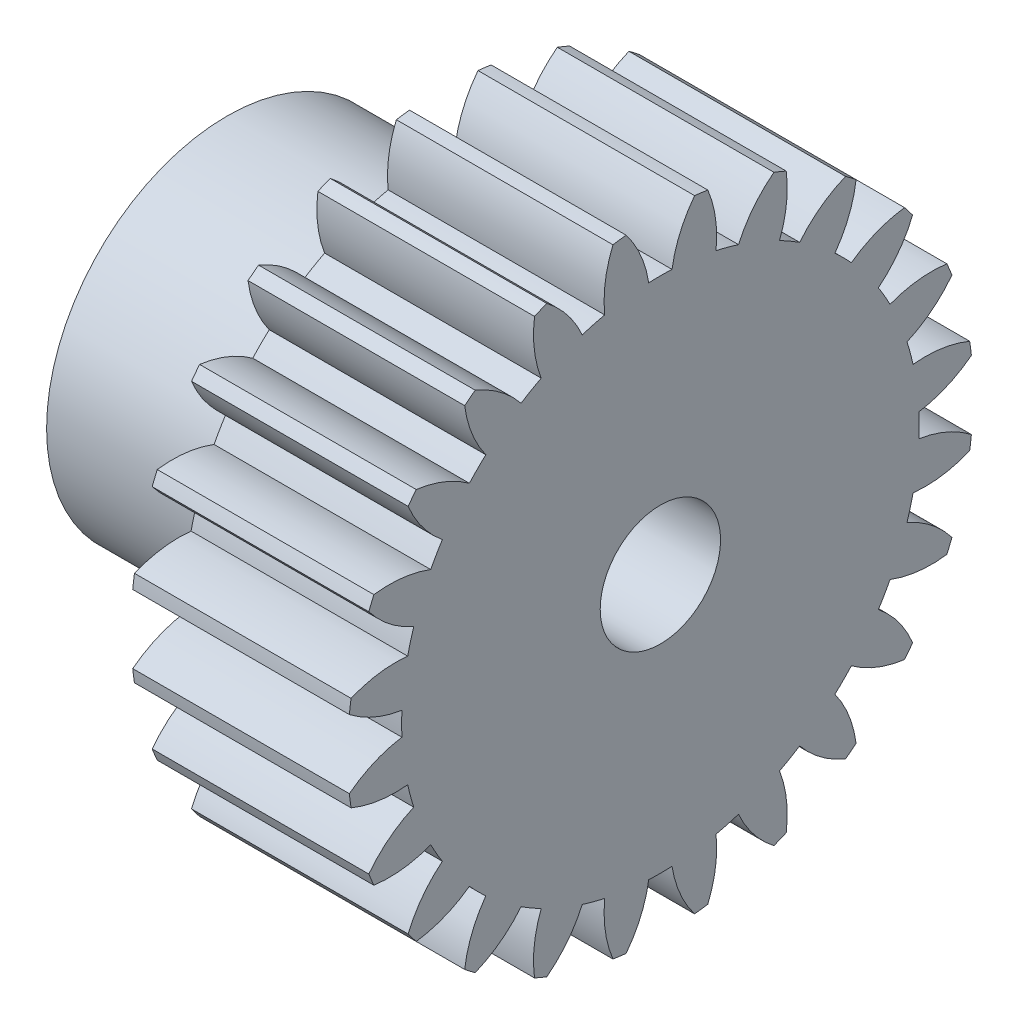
ISO-10303-21;
HEADER;
FILE_DESCRIPTION(('STEP AP214'),'2;1');
FILE_NAME('part.step','',(''),(''),'','','');
FILE_SCHEMA(('AUTOMOTIVE_DESIGN { 1 0 10303 214 1 1 1 1 }'));
ENDSEC;
DATA;
#1=APPLICATION_CONTEXT('core data for automotive mechanical design processes');
#2=APPLICATION_PROTOCOL_DEFINITION('international standard','automotive_design',2000,#1);
#3=PRODUCT_CONTEXT('',#1,'mechanical');
#4=PRODUCT('Part','Part','',(#3));
#5=PRODUCT_RELATED_PRODUCT_CATEGORY('part','',(#4));
#6=PRODUCT_DEFINITION_FORMATION('','',#4);
#7=PRODUCT_DEFINITION_CONTEXT('part definition',#1,'design');
#8=PRODUCT_DEFINITION('design','',#6,#7);
#9=PRODUCT_DEFINITION_SHAPE('','',#8);
#10=(LENGTH_UNIT() NAMED_UNIT(*) SI_UNIT(.MILLI.,.METRE.));
#11=(NAMED_UNIT(*) PLANE_ANGLE_UNIT() SI_UNIT($,.RADIAN.));
#12=(NAMED_UNIT(*) SI_UNIT($,.STERADIAN.) SOLID_ANGLE_UNIT());
#13=UNCERTAINTY_MEASURE_WITH_UNIT(LENGTH_MEASURE(1.E-05),#10,'distance_accuracy_value','');
#14=(GEOMETRIC_REPRESENTATION_CONTEXT(3) GLOBAL_UNCERTAINTY_ASSIGNED_CONTEXT((#13)) GLOBAL_UNIT_ASSIGNED_CONTEXT((#10,
#11,#12)) REPRESENTATION_CONTEXT('',''));
#15=CARTESIAN_POINT('',(0.,0.,0.));
#16=DIRECTION('',(0.,0.,1.));
#17=DIRECTION('',(1.,0.,0.));
#18=AXIS2_PLACEMENT_3D('',#15,#16,#17);
#19=CARTESIAN_POINT('',(9.,0.,0.));
#20=DIRECTION('',(-1.,0.,0.));
#21=DIRECTION('',(0.,0.,1.));
#22=AXIS2_PLACEMENT_3D('',#19,#20,#21);
#23=PLANE('',#22);
#24=CARTESIAN_POINT('',(9.,8.29974846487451,-7.63343797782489));
#25=DIRECTION('',(-1.,0.,0.));
#26=DIRECTION('',(0.,-0.258819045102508,-0.965925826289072));
#27=AXIS2_PLACEMENT_3D('',#24,#25,#26);
#28=CIRCLE('',#27,4.8);
#29=CARTESIAN_POINT('',(9.,10.2471043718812,-3.24620593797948));
#30=VERTEX_POINT('',#29);
#31=CARTESIAN_POINT('',(9.,12.1134000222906,-4.71863750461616));
#32=VERTEX_POINT('',#31);
#33=EDGE_CURVE('E639',#30,#32,#28,.T.);
#34=ORIENTED_EDGE('',*,*,#33,.F.);
#35=CARTESIAN_POINT('',(9.,0.,0.));
#36=DIRECTION('',(-1.,0.,0.));
#37=DIRECTION('',(0.,-0.258819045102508,-0.965925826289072));
#38=AXIS2_PLACEMENT_3D('',#35,#36,#37);
#39=CIRCLE('',#38,10.749);
#40=CARTESIAN_POINT('',(9.,10.4973556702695,-2.3122553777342));
#41=VERTEX_POINT('',#40);
#42=EDGE_CURVE('E1232',#41,#30,#39,.T.);
#43=ORIENTED_EDGE('',*,*,#42,.F.);
#44=CARTESIAN_POINT('',(9.,11.0045120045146,2.46087697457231));
#45=DIRECTION('',(-1.,0.,0.));
#46=DIRECTION('',(0.,-0.258819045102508,-0.965925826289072));
#47=AXIS2_PLACEMENT_3D('',#44,#45,#46);
#48=CIRCLE('',#47,4.8);
#49=CARTESIAN_POINT('',(9.,12.8498308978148,-1.97024006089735));
#50=VERTEX_POINT('',#49);
#51=EDGE_CURVE('E629',#50,#41,#48,.T.);
#52=ORIENTED_EDGE('',*,*,#51,.F.);
#53=CARTESIAN_POINT('',(9.,0.,0.));
#54=DIRECTION('',(-1.,0.,0.));
#55=DIRECTION('',(0.,0.,1.));
#56=AXIS2_PLACEMENT_3D('',#53,#54,#55);
#57=CIRCLE('',#56,13.);
#58=CARTESIAN_POINT('',(9.,12.9219191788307,-1.42267520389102));
#59=VERTEX_POINT('',#58);
#60=EDGE_CURVE('E718',#59,#50,#57,.T.);
#61=ORIENTED_EDGE('',*,*,#60,.F.);
#62=CARTESIAN_POINT('',(9.,9.99262052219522,-5.22520191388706));
#63=DIRECTION('',(-1.,0.,0.));
#64=DIRECTION('',(0.,0.,-1.));
#65=AXIS2_PLACEMENT_3D('',#62,#63,#64);
#66=CIRCLE('',#65,4.8);
#67=CARTESIAN_POINT('',(9.,10.7381226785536,-0.483448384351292));
#68=VERTEX_POINT('',#67);
#69=EDGE_CURVE('E740',#68,#59,#66,.T.);
#70=ORIENTED_EDGE('',*,*,#69,.F.);
#71=CARTESIAN_POINT('',(9.,0.,0.));
#72=DIRECTION('',(-1.,0.,0.));
#73=DIRECTION('',(0.,0.,-1.));
#74=AXIS2_PLACEMENT_3D('',#71,#72,#73);
#75=CIRCLE('',#74,10.749);
#76=CARTESIAN_POINT('',(9.,10.7381226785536,0.483448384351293));
#77=VERTEX_POINT('',#76);
#78=EDGE_CURVE('E736',#77,#68,#75,.T.);
#79=ORIENTED_EDGE('',*,*,#78,.F.);
#80=CARTESIAN_POINT('',(9.,9.99262052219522,5.22520191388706));
#81=DIRECTION('',(-1.,0.,0.));
#82=DIRECTION('',(0.,0.,-1.));
#83=AXIS2_PLACEMENT_3D('',#80,#81,#82);
#84=CIRCLE('',#83,4.8);
#85=CARTESIAN_POINT('',(9.,12.9219191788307,1.42267520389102));
#86=VERTEX_POINT('',#85);
#87=EDGE_CURVE('E738',#86,#77,#84,.T.);
#88=ORIENTED_EDGE('',*,*,#87,.F.);
#89=CARTESIAN_POINT('',(9.,12.8498308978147,1.97024006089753));
#90=VERTEX_POINT('',#89);
#91=EDGE_CURVE('E722',#90,#86,#57,.T.);
#92=ORIENTED_EDGE('',*,*,#91,.F.);
#93=CARTESIAN_POINT('',(9.,11.0045120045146,-2.46087697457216));
#94=DIRECTION('',(-1.,0.,0.));
#95=DIRECTION('',(0.,0.258819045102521,-0.965925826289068));
#96=AXIS2_PLACEMENT_3D('',#93,#94,#95);
#97=CIRCLE('',#96,4.8);
#98=CARTESIAN_POINT('',(9.,10.4973556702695,2.31225537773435));
#99=VERTEX_POINT('',#98);
#100=EDGE_CURVE('E761',#99,#90,#97,.T.);
#101=ORIENTED_EDGE('',*,*,#100,.F.);
#102=CARTESIAN_POINT('',(9.,0.,0.));
#103=DIRECTION('',(-1.,0.,0.));
#104=DIRECTION('',(0.,0.258819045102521,-0.965925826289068));
#105=AXIS2_PLACEMENT_3D('',#102,#103,#104);
#106=CIRCLE('',#105,10.749);
#107=CARTESIAN_POINT('',(9.,10.2471043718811,3.24620593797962));
#108=VERTEX_POINT('',#107);
#109=EDGE_CURVE('E757',#108,#99,#106,.T.);
#110=ORIENTED_EDGE('',*,*,#109,.F.);
#111=CARTESIAN_POINT('',(9.,8.2997484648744,7.633437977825));
#112=DIRECTION('',(-1.,0.,0.));
#113=DIRECTION('',(0.,0.258819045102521,-0.965925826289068));
#114=AXIS2_PLACEMENT_3D('',#111,#112,#113);
#115=CIRCLE('',#114,4.8);
#116=CARTESIAN_POINT('',(9.,12.1134000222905,4.71863750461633));
#117=VERTEX_POINT('',#116);
#118=EDGE_CURVE('E759',#117,#108,#115,.T.);
#119=ORIENTED_EDGE('',*,*,#118,.F.);
#120=CARTESIAN_POINT('',(9.,11.9020478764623,5.22888672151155));
#121=VERTEX_POINT('',#120);
#122=EDGE_CURVE('E1352',#121,#117,#57,.T.);
#123=ORIENTED_EDGE('',*,*,#122,.F.);
#124=CARTESIAN_POINT('',(9.,11.2664641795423,0.471152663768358));
#125=DIRECTION('',(-1.,0.,0.));
#126=DIRECTION('',(0.,0.500000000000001,-0.866025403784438));
#127=AXIS2_PLACEMENT_3D('',#124,#125,#126);
#128=CIRCLE('',#127,4.8);
#129=CARTESIAN_POINT('',(9.,9.54121122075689,4.95038275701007));
#130=VERTEX_POINT('',#129);
#131=EDGE_CURVE('E783',#130,#121,#128,.T.);
#132=ORIENTED_EDGE('',*,*,#131,.F.);
#133=CARTESIAN_POINT('',(9.,0.,0.));
#134=DIRECTION('',(-1.,0.,0.));
#135=DIRECTION('',(0.,0.500000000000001,-0.866025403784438));
#136=AXIS2_PLACEMENT_3D('',#133,#134,#135);
#137=CIRCLE('',#136,10.749);
#138=CARTESIAN_POINT('',(9.,9.0577628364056,5.78773992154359));
#139=VERTEX_POINT('',#138);
#140=EDGE_CURVE('E779',#139,#130,#137,.T.);
#141=ORIENTED_EDGE('',*,*,#140,.F.);
#142=CARTESIAN_POINT('',(9.,6.04126226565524,9.52146785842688));
#143=DIRECTION('',(-1.,0.,0.));
#144=DIRECTION('',(0.,0.500000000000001,-0.866025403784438));
#145=AXIS2_PLACEMENT_3D('',#142,#143,#144);
#146=CIRCLE('',#145,4.8);
#147=CARTESIAN_POINT('',(9.,10.4793726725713,7.69303245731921));
#148=VERTEX_POINT('',#147);
#149=EDGE_CURVE('E781',#148,#139,#146,.T.);
#150=ORIENTED_EDGE('',*,*,#149,.F.);
#151=CARTESIAN_POINT('',(9.,10.143159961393,8.13119339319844));
#152=VERTEX_POINT('',#151);
#153=EDGE_CURVE('E1353',#152,#148,#57,.T.);
#154=ORIENTED_EDGE('',*,*,#153,.F.);
#155=CARTESIAN_POINT('',(9.,10.7606254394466,3.37107402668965));
#156=DIRECTION('',(-1.,0.,0.));
#157=DIRECTION('',(0.,0.707106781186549,-0.707106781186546));
#158=AXIS2_PLACEMENT_3D('',#155,#156,#157);
#159=CIRCLE('',#158,4.8);
#160=CARTESIAN_POINT('',(9.,7.9348489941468,7.25114973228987));
#161=VERTEX_POINT('',#160);
#162=EDGE_CURVE('E805',#161,#152,#159,.T.);
#163=ORIENTED_EDGE('',*,*,#162,.F.);
#164=CARTESIAN_POINT('',(9.,0.,0.));
#165=DIRECTION('',(-1.,0.,0.));
#166=DIRECTION('',(0.,0.707106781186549,-0.707106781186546));
#167=AXIS2_PLACEMENT_3D('',#164,#165,#166);
#168=CIRCLE('',#167,10.749);
#169=CARTESIAN_POINT('',(9.,7.25114973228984,7.93484899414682));
#170=VERTEX_POINT('',#169);
#171=EDGE_CURVE('E801',#170,#161,#168,.T.);
#172=ORIENTED_EDGE('',*,*,#171,.F.);
#173=CARTESIAN_POINT('',(9.,3.37107402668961,10.7606254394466));
#174=DIRECTION('',(-1.,0.,0.));
#175=DIRECTION('',(0.,0.707106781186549,-0.707106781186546));
#176=AXIS2_PLACEMENT_3D('',#173,#174,#175);
#177=CIRCLE('',#176,4.8);
#178=CARTESIAN_POINT('',(9.,8.13119339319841,10.143159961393));
#179=VERTEX_POINT('',#178);
#180=EDGE_CURVE('E803',#179,#170,#177,.T.);
#181=ORIENTED_EDGE('',*,*,#180,.F.);
#182=CARTESIAN_POINT('',(9.,7.69303245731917,10.4793726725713));
#183=VERTEX_POINT('',#182);
#184=EDGE_CURVE('E1358',#183,#179,#57,.T.);
#185=ORIENTED_EDGE('',*,*,#184,.F.);
#186=CARTESIAN_POINT('',(9.,9.52146785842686,6.04126226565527));
#187=DIRECTION('',(-1.,0.,0.));
#188=DIRECTION('',(0.,0.86602540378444,-0.499999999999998));
#189=AXIS2_PLACEMENT_3D('',#186,#187,#188);
#190=CIRCLE('',#189,4.8);
#191=CARTESIAN_POINT('',(9.,5.78773992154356,9.05776283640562));
#192=VERTEX_POINT('',#191);
#193=EDGE_CURVE('E827',#192,#183,#190,.T.);
#194=ORIENTED_EDGE('',*,*,#193,.F.);
#195=CARTESIAN_POINT('',(9.,0.,0.));
#196=DIRECTION('',(-1.,0.,0.));
#197=DIRECTION('',(0.,0.86602540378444,-0.499999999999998));
#198=AXIS2_PLACEMENT_3D('',#195,#196,#197);
#199=CIRCLE('',#198,10.749);
#200=CARTESIAN_POINT('',(9.,4.95038275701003,9.54121122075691));
#201=VERTEX_POINT('',#200);
#202=EDGE_CURVE('E823',#201,#192,#199,.T.);
#203=ORIENTED_EDGE('',*,*,#202,.F.);
#204=CARTESIAN_POINT('',(9.,0.471152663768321,11.2664641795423));
#205=DIRECTION('',(-1.,0.,0.));
#206=DIRECTION('',(0.,0.86602540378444,-0.499999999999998));
#207=AXIS2_PLACEMENT_3D('',#204,#205,#206);
#208=CIRCLE('',#207,4.8);
#209=CARTESIAN_POINT('',(9.,5.22888672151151,11.9020478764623));
#210=VERTEX_POINT('',#209);
#211=EDGE_CURVE('E825',#210,#201,#208,.T.);
#212=ORIENTED_EDGE('',*,*,#211,.F.);
#213=CARTESIAN_POINT('',(9.,4.71863750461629,12.1134000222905));
#214=VERTEX_POINT('',#213);
#215=EDGE_CURVE('E1363',#214,#210,#57,.T.);
#216=ORIENTED_EDGE('',*,*,#215,.F.);
#217=CARTESIAN_POINT('',(9.,7.63343797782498,8.29974846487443));
#218=DIRECTION('',(-1.,0.,0.));
#219=DIRECTION('',(0.,0.965925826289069,-0.258819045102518));
#220=AXIS2_PLACEMENT_3D('',#217,#218,#219);
#221=CIRCLE('',#220,4.8);
#222=CARTESIAN_POINT('',(9.,3.24620593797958,10.2471043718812));
#223=VERTEX_POINT('',#222);
#224=EDGE_CURVE('E849',#223,#214,#221,.T.);
#225=ORIENTED_EDGE('',*,*,#224,.F.);
#226=CARTESIAN_POINT('',(9.,0.,0.));
#227=DIRECTION('',(-1.,0.,0.));
#228=DIRECTION('',(0.,0.965925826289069,-0.258819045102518));
#229=AXIS2_PLACEMENT_3D('',#226,#227,#228);
#230=CIRCLE('',#229,10.749);
#231=CARTESIAN_POINT('',(9.,2.31225537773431,10.4973556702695));
#232=VERTEX_POINT('',#231);
#233=EDGE_CURVE('E845',#232,#223,#230,.T.);
#234=ORIENTED_EDGE('',*,*,#233,.F.);
#235=CARTESIAN_POINT('',(9.,-2.46087697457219,11.0045120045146));
#236=DIRECTION('',(-1.,0.,0.));
#237=DIRECTION('',(0.,0.965925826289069,-0.258819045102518));
#238=AXIS2_PLACEMENT_3D('',#235,#236,#237);
#239=CIRCLE('',#238,4.8);
#240=CARTESIAN_POINT('',(9.,1.97024006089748,12.8498308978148));
#241=VERTEX_POINT('',#240);
#242=EDGE_CURVE('E847',#241,#232,#239,.T.);
#243=ORIENTED_EDGE('',*,*,#242,.F.);
#244=CARTESIAN_POINT('',(9.,1.42267520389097,12.9219191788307));
#245=VERTEX_POINT('',#244);
#246=EDGE_CURVE('E1368',#245,#241,#57,.T.);
#247=ORIENTED_EDGE('',*,*,#246,.F.);
#248=CARTESIAN_POINT('',(9.,5.22520191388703,9.99262052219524));
#249=DIRECTION('',(-1.,0.,0.));
#250=DIRECTION('',(0.,1.,0.));
#251=AXIS2_PLACEMENT_3D('',#248,#249,#250);
#252=CIRCLE('',#251,4.8);
#253=CARTESIAN_POINT('',(9.,0.483448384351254,10.7381226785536));
#254=VERTEX_POINT('',#253);
#255=EDGE_CURVE('E871',#254,#245,#252,.T.);
#256=ORIENTED_EDGE('',*,*,#255,.F.);
#257=CARTESIAN_POINT('',(9.,0.,0.));
#258=DIRECTION('',(-1.,0.,0.));
#259=DIRECTION('',(0.,1.,0.));
#260=AXIS2_PLACEMENT_3D('',#257,#258,#259);
#261=CIRCLE('',#260,10.749);
#262=CARTESIAN_POINT('',(9.,-0.48344838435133,10.7381226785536));
#263=VERTEX_POINT('',#262);
#264=EDGE_CURVE('E867',#263,#254,#261,.T.);
#265=ORIENTED_EDGE('',*,*,#264,.F.);
#266=CARTESIAN_POINT('',(9.,-5.2252019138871,9.9926205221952));
#267=DIRECTION('',(-1.,0.,0.));
#268=DIRECTION('',(0.,1.,0.));
#269=AXIS2_PLACEMENT_3D('',#266,#267,#268);
#270=CIRCLE('',#269,4.8);
#271=CARTESIAN_POINT('',(9.,-1.42267520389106,12.9219191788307));
#272=VERTEX_POINT('',#271);
#273=EDGE_CURVE('E869',#272,#263,#270,.T.);
#274=ORIENTED_EDGE('',*,*,#273,.F.);
#275=CARTESIAN_POINT('',(9.,-1.97024006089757,12.8498308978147));
#276=VERTEX_POINT('',#275);
#277=EDGE_CURVE('E1373',#276,#272,#57,.T.);
#278=ORIENTED_EDGE('',*,*,#277,.F.);
#279=CARTESIAN_POINT('',(9.,2.46087697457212,11.0045120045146));
#280=DIRECTION('',(-1.,0.,0.));
#281=DIRECTION('',(0.,0.965925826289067,0.258819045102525));
#282=AXIS2_PLACEMENT_3D('',#279,#280,#281);
#283=CIRCLE('',#282,4.8);
#284=CARTESIAN_POINT('',(9.,-2.31225537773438,10.4973556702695));
#285=VERTEX_POINT('',#284);
#286=EDGE_CURVE('E893',#285,#276,#283,.T.);
#287=ORIENTED_EDGE('',*,*,#286,.F.);
#288=CARTESIAN_POINT('',(9.,0.,0.));
#289=DIRECTION('',(-1.,0.,0.));
#290=DIRECTION('',(0.,0.965925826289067,0.258819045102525));
#291=AXIS2_PLACEMENT_3D('',#288,#289,#290);
#292=CIRCLE('',#291,10.749);
#293=CARTESIAN_POINT('',(9.,-3.24620593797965,10.2471043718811));
#294=VERTEX_POINT('',#293);
#295=EDGE_CURVE('E889',#294,#285,#292,.T.);
#296=ORIENTED_EDGE('',*,*,#295,.F.);
#297=CARTESIAN_POINT('',(9.,-7.63343797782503,8.29974846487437));
#298=DIRECTION('',(-1.,0.,0.));
#299=DIRECTION('',(0.,0.965925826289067,0.258819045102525));
#300=AXIS2_PLACEMENT_3D('',#297,#298,#299);
#301=CIRCLE('',#300,4.8);
#302=CARTESIAN_POINT('',(9.,-4.71863750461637,12.1134000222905));
#303=VERTEX_POINT('',#302);
#304=EDGE_CURVE('E891',#303,#294,#301,.T.);
#305=ORIENTED_EDGE('',*,*,#304,.F.);
#306=CARTESIAN_POINT('',(9.,-5.2288867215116,11.9020478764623));
#307=VERTEX_POINT('',#306);
#308=EDGE_CURVE('E1378',#307,#303,#57,.T.);
#309=ORIENTED_EDGE('',*,*,#308,.F.);
#310=CARTESIAN_POINT('',(9.,-0.471152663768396,11.2664641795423));
#311=DIRECTION('',(-1.,0.,0.));
#312=DIRECTION('',(0.,0.866025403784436,0.500000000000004));
#313=AXIS2_PLACEMENT_3D('',#310,#311,#312);
#314=CIRCLE('',#313,4.8);
#315=CARTESIAN_POINT('',(9.,-4.9503827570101,9.54121122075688));
#316=VERTEX_POINT('',#315);
#317=EDGE_CURVE('E915',#316,#307,#314,.T.);
#318=ORIENTED_EDGE('',*,*,#317,.F.);
#319=CARTESIAN_POINT('',(9.,0.,0.));
#320=DIRECTION('',(-1.,0.,0.));
#321=DIRECTION('',(0.,0.866025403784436,0.500000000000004));
#322=AXIS2_PLACEMENT_3D('',#319,#320,#321);
#323=CIRCLE('',#322,10.749);
#324=CARTESIAN_POINT('',(9.,-5.78773992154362,9.05776283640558));
#325=VERTEX_POINT('',#324);
#326=EDGE_CURVE('E911',#325,#316,#323,.T.);
#327=ORIENTED_EDGE('',*,*,#326,.F.);
#328=CARTESIAN_POINT('',(9.,-9.5214678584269,6.04126226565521));
#329=DIRECTION('',(-1.,0.,0.));
#330=DIRECTION('',(0.,0.866025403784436,0.500000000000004));
#331=AXIS2_PLACEMENT_3D('',#328,#329,#330);
#332=CIRCLE('',#331,4.8);
#333=CARTESIAN_POINT('',(9.,-7.69303245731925,10.4793726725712));
#334=VERTEX_POINT('',#333);
#335=EDGE_CURVE('E913',#334,#325,#332,.T.);
#336=ORIENTED_EDGE('',*,*,#335,.F.);
#337=CARTESIAN_POINT('',(9.,-8.13119339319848,10.143159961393));
#338=VERTEX_POINT('',#337);
#339=EDGE_CURVE('E1383',#338,#334,#57,.T.);
#340=ORIENTED_EDGE('',*,*,#339,.F.);
#341=CARTESIAN_POINT('',(9.,-3.37107402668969,10.7606254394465));
#342=DIRECTION('',(-1.,0.,0.));
#343=DIRECTION('',(0.,0.707106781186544,0.707106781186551));
#344=AXIS2_PLACEMENT_3D('',#341,#342,#343);
#345=CIRCLE('',#344,4.8);
#346=CARTESIAN_POINT('',(9.,-7.2511497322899,7.93484899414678));
#347=VERTEX_POINT('',#346);
#348=EDGE_CURVE('E937',#347,#338,#345,.T.);
#349=ORIENTED_EDGE('',*,*,#348,.F.);
#350=CARTESIAN_POINT('',(9.,0.,0.));
#351=DIRECTION('',(-1.,0.,0.));
#352=DIRECTION('',(0.,0.707106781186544,0.707106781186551));
#353=AXIS2_PLACEMENT_3D('',#350,#351,#352);
#354=CIRCLE('',#353,10.749);
#355=CARTESIAN_POINT('',(9.,-7.93484899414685,7.25114973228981));
#356=VERTEX_POINT('',#355);
#357=EDGE_CURVE('E933',#356,#347,#354,.T.);
#358=ORIENTED_EDGE('',*,*,#357,.F.);
#359=CARTESIAN_POINT('',(9.,-10.7606254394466,3.37107402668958));
#360=DIRECTION('',(-1.,0.,0.));
#361=DIRECTION('',(0.,0.707106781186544,0.707106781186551));
#362=AXIS2_PLACEMENT_3D('',#359,#360,#361);
#363=CIRCLE('',#362,4.8);
#364=CARTESIAN_POINT('',(9.,-10.1431599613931,8.13119339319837));
#365=VERTEX_POINT('',#364);
#366=EDGE_CURVE('E935',#365,#356,#363,.T.);
#367=ORIENTED_EDGE('',*,*,#366,.F.);
#368=CARTESIAN_POINT('',(9.,-10.4793726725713,7.69303245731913));
#369=VERTEX_POINT('',#368);
#370=EDGE_CURVE('E1388',#369,#365,#57,.T.);
#371=ORIENTED_EDGE('',*,*,#370,.F.);
#372=CARTESIAN_POINT('',(9.,-6.04126226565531,9.52146785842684));
#373=DIRECTION('',(-1.,0.,0.));
#374=DIRECTION('',(0.,0.499999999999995,0.866025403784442));
#375=AXIS2_PLACEMENT_3D('',#372,#373,#374);
#376=CIRCLE('',#375,4.8);
#377=CARTESIAN_POINT('',(9.,-9.05776283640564,5.78773992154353));
#378=VERTEX_POINT('',#377);
#379=EDGE_CURVE('E959',#378,#369,#376,.T.);
#380=ORIENTED_EDGE('',*,*,#379,.F.);
#381=CARTESIAN_POINT('',(9.,0.,0.));
#382=DIRECTION('',(-1.,0.,0.));
#383=DIRECTION('',(0.,0.499999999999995,0.866025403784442));
#384=AXIS2_PLACEMENT_3D('',#381,#382,#383);
#385=CIRCLE('',#384,10.749);
#386=CARTESIAN_POINT('',(9.,-9.54121122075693,4.95038275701));
#387=VERTEX_POINT('',#386);
#388=EDGE_CURVE('E955',#387,#378,#385,.T.);
#389=ORIENTED_EDGE('',*,*,#388,.F.);
#390=CARTESIAN_POINT('',(9.,-11.2664641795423,0.471152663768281));
#391=DIRECTION('',(-1.,0.,0.));
#392=DIRECTION('',(0.,0.499999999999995,0.866025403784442));
#393=AXIS2_PLACEMENT_3D('',#390,#391,#392);
#394=CIRCLE('',#393,4.8);
#395=CARTESIAN_POINT('',(9.,-11.9020478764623,5.22888672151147));
#396=VERTEX_POINT('',#395);
#397=EDGE_CURVE('E957',#396,#387,#394,.T.);
#398=ORIENTED_EDGE('',*,*,#397,.F.);
#399=CARTESIAN_POINT('',(9.,-12.1134000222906,4.71863750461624));
#400=VERTEX_POINT('',#399);
#401=EDGE_CURVE('E1393',#400,#396,#57,.T.);
#402=ORIENTED_EDGE('',*,*,#401,.F.);
#403=CARTESIAN_POINT('',(9.,-8.29974846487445,7.63343797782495));
#404=DIRECTION('',(-1.,0.,0.));
#405=DIRECTION('',(0.,0.258819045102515,0.96592582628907));
#406=AXIS2_PLACEMENT_3D('',#403,#404,#405);
#407=CIRCLE('',#406,4.8);
#408=CARTESIAN_POINT('',(9.,-10.2471043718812,3.24620593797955));
#409=VERTEX_POINT('',#408);
#410=EDGE_CURVE('E981',#409,#400,#407,.T.);
#411=ORIENTED_EDGE('',*,*,#410,.F.);
#412=CARTESIAN_POINT('',(9.,0.,0.));
#413=DIRECTION('',(-1.,0.,0.));
#414=DIRECTION('',(0.,0.258819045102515,0.96592582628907));
#415=AXIS2_PLACEMENT_3D('',#412,#413,#414);
#416=CIRCLE('',#415,10.749);
#417=CARTESIAN_POINT('',(9.,-10.4973556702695,2.31225537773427));
#418=VERTEX_POINT('',#417);
#419=EDGE_CURVE('E977',#418,#409,#416,.T.);
#420=ORIENTED_EDGE('',*,*,#419,.F.);
#421=CARTESIAN_POINT('',(9.,-11.0045120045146,-2.46087697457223));
#422=DIRECTION('',(-1.,0.,0.));
#423=DIRECTION('',(0.,0.258819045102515,0.96592582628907));
#424=AXIS2_PLACEMENT_3D('',#421,#422,#423);
#425=CIRCLE('',#424,4.8);
#426=CARTESIAN_POINT('',(9.,-12.8498308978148,1.97024006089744));
#427=VERTEX_POINT('',#426);
#428=EDGE_CURVE('E979',#427,#418,#425,.T.);
#429=ORIENTED_EDGE('',*,*,#428,.F.);
#430=CARTESIAN_POINT('',(9.,-12.9219191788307,1.42267520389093));
#431=VERTEX_POINT('',#430);
#432=EDGE_CURVE('E1398',#431,#427,#57,.T.);
#433=ORIENTED_EDGE('',*,*,#432,.F.);
#434=CARTESIAN_POINT('',(9.,-9.99262052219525,5.22520191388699));
#435=DIRECTION('',(-1.,0.,0.));
#436=DIRECTION('',(0.,0.,1.));
#437=AXIS2_PLACEMENT_3D('',#434,#435,#436);
#438=CIRCLE('',#437,4.8);
#439=CARTESIAN_POINT('',(9.,-10.7381226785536,0.483448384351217));
#440=VERTEX_POINT('',#439);
#441=EDGE_CURVE('E1003',#440,#431,#438,.T.);
#442=ORIENTED_EDGE('',*,*,#441,.F.);
#443=CARTESIAN_POINT('',(9.,0.,0.));
#444=DIRECTION('',(-1.,0.,0.));
#445=DIRECTION('',(0.,0.,1.));
#446=AXIS2_PLACEMENT_3D('',#443,#444,#445);
#447=CIRCLE('',#446,10.749);
#448=CARTESIAN_POINT('',(9.,-10.7381226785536,-0.483448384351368));
#449=VERTEX_POINT('',#448);
#450=EDGE_CURVE('E999',#449,#440,#447,.T.);
#451=ORIENTED_EDGE('',*,*,#450,.F.);
#452=CARTESIAN_POINT('',(9.,-9.99262052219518,-5.22520191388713));
#453=DIRECTION('',(-1.,0.,0.));
#454=DIRECTION('',(0.,0.,1.));
#455=AXIS2_PLACEMENT_3D('',#452,#453,#454);
#456=CIRCLE('',#455,4.8);
#457=CARTESIAN_POINT('',(9.,-12.9219191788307,-1.42267520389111));
#458=VERTEX_POINT('',#457);
#459=EDGE_CURVE('E1001',#458,#449,#456,.T.);
#460=ORIENTED_EDGE('',*,*,#459,.F.);
#461=CARTESIAN_POINT('',(9.,-12.8498308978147,-1.97024006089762));
#462=VERTEX_POINT('',#461);
#463=EDGE_CURVE('E1403',#462,#458,#57,.T.);
#464=ORIENTED_EDGE('',*,*,#463,.F.);
#465=CARTESIAN_POINT('',(9.,-11.0045120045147,2.46087697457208));
#466=DIRECTION('',(-1.,0.,0.));
#467=DIRECTION('',(0.,-0.258819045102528,0.965925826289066));
#468=AXIS2_PLACEMENT_3D('',#465,#466,#467);
#469=CIRCLE('',#468,4.8);
#470=CARTESIAN_POINT('',(9.,-10.4973556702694,-2.31225537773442));
#471=VERTEX_POINT('',#470);
#472=EDGE_CURVE('E1025',#471,#462,#469,.T.);
#473=ORIENTED_EDGE('',*,*,#472,.F.);
#474=CARTESIAN_POINT('',(9.,0.,0.));
#475=DIRECTION('',(-1.,0.,0.));
#476=DIRECTION('',(0.,-0.258819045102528,0.965925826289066));
#477=AXIS2_PLACEMENT_3D('',#474,#475,#476);
#478=CIRCLE('',#477,10.749);
#479=CARTESIAN_POINT('',(9.,-10.2471043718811,-3.24620593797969));
#480=VERTEX_POINT('',#479);
#481=EDGE_CURVE('E1021',#480,#471,#478,.T.);
#482=ORIENTED_EDGE('',*,*,#481,.F.);
#483=CARTESIAN_POINT('',(9.,-8.29974846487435,-7.63343797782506));
#484=DIRECTION('',(-1.,0.,0.));
#485=DIRECTION('',(0.,-0.258819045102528,0.965925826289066));
#486=AXIS2_PLACEMENT_3D('',#483,#484,#485);
#487=CIRCLE('',#486,4.8);
#488=CARTESIAN_POINT('',(9.,-12.1134000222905,-4.71863750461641));
#489=VERTEX_POINT('',#488);
#490=EDGE_CURVE('E1023',#489,#480,#487,.T.);
#491=ORIENTED_EDGE('',*,*,#490,.F.);
#492=CARTESIAN_POINT('',(9.,-11.9020478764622,-5.22888672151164));
#493=VERTEX_POINT('',#492);
#494=EDGE_CURVE('E1408',#493,#489,#57,.T.);
#495=ORIENTED_EDGE('',*,*,#494,.F.);
#496=CARTESIAN_POINT('',(9.,-11.2664641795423,-0.471152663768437));
#497=DIRECTION('',(-1.,0.,0.));
#498=DIRECTION('',(0.,-0.500000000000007,0.866025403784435));
#499=AXIS2_PLACEMENT_3D('',#496,#497,#498);
#500=CIRCLE('',#499,4.8);
#501=CARTESIAN_POINT('',(9.,-9.54121122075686,-4.95038275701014));
#502=VERTEX_POINT('',#501);
#503=EDGE_CURVE('E1047',#502,#493,#500,.T.);
#504=ORIENTED_EDGE('',*,*,#503,.F.);
#505=CARTESIAN_POINT('',(9.,0.,0.));
#506=DIRECTION('',(-1.,0.,0.));
#507=DIRECTION('',(0.,-0.500000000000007,0.866025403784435));
#508=AXIS2_PLACEMENT_3D('',#505,#506,#507);
#509=CIRCLE('',#508,10.749);
#510=CARTESIAN_POINT('',(9.,-9.05776283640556,-5.78773992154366));
#511=VERTEX_POINT('',#510);
#512=EDGE_CURVE('E1043',#511,#502,#509,.T.);
#513=ORIENTED_EDGE('',*,*,#512,.F.);
#514=CARTESIAN_POINT('',(9.,-6.04126226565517,-9.52146785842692));
#515=DIRECTION('',(-1.,0.,0.));
#516=DIRECTION('',(0.,-0.500000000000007,0.866025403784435));
#517=AXIS2_PLACEMENT_3D('',#514,#515,#516);
#518=CIRCLE('',#517,4.8);
#519=CARTESIAN_POINT('',(9.,-10.4793726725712,-7.69303245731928));
#520=VERTEX_POINT('',#519);
#521=EDGE_CURVE('E1045',#520,#511,#518,.T.);
#522=ORIENTED_EDGE('',*,*,#521,.F.);
#523=CARTESIAN_POINT('',(9.,-10.1431599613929,-8.13119339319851));
#524=VERTEX_POINT('',#523);
#525=EDGE_CURVE('E1413',#524,#520,#57,.T.);
#526=ORIENTED_EDGE('',*,*,#525,.F.);
#527=CARTESIAN_POINT('',(9.,-10.7606254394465,-3.37107402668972));
#528=DIRECTION('',(-1.,0.,0.));
#529=DIRECTION('',(0.,-0.707106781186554,0.707106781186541));
#530=AXIS2_PLACEMENT_3D('',#527,#528,#529);
#531=CIRCLE('',#530,4.8);
#532=CARTESIAN_POINT('',(9.,-7.93484899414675,-7.25114973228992));
#533=VERTEX_POINT('',#532);
#534=EDGE_CURVE('E1069',#533,#524,#531,.T.);
#535=ORIENTED_EDGE('',*,*,#534,.F.);
#536=CARTESIAN_POINT('',(9.,0.,0.));
#537=DIRECTION('',(-1.,0.,0.));
#538=DIRECTION('',(0.,-0.707106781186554,0.707106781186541));
#539=AXIS2_PLACEMENT_3D('',#536,#537,#538);
#540=CIRCLE('',#539,10.749);
#541=CARTESIAN_POINT('',(9.,-7.25114973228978,-7.93484899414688));
#542=VERTEX_POINT('',#541);
#543=EDGE_CURVE('E1065',#542,#533,#540,.T.);
#544=ORIENTED_EDGE('',*,*,#543,.F.);
#545=CARTESIAN_POINT('',(9.,-3.37107402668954,-10.7606254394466));
#546=DIRECTION('',(-1.,0.,0.));
#547=DIRECTION('',(0.,-0.707106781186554,0.707106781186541));
#548=AXIS2_PLACEMENT_3D('',#545,#546,#547);
#549=CIRCLE('',#548,4.8);
#550=CARTESIAN_POINT('',(9.,-8.13119339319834,-10.1431599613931));
#551=VERTEX_POINT('',#550);
#552=EDGE_CURVE('E1067',#551,#542,#549,.T.);
#553=ORIENTED_EDGE('',*,*,#552,.F.);
#554=CARTESIAN_POINT('',(9.,-7.6930324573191,-10.4793726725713));
#555=VERTEX_POINT('',#554);
#556=EDGE_CURVE('E1418',#555,#551,#57,.T.);
#557=ORIENTED_EDGE('',*,*,#556,.F.);
#558=CARTESIAN_POINT('',(9.,-9.52146785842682,-6.04126226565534));
#559=DIRECTION('',(-1.,0.,0.));
#560=DIRECTION('',(0.,-0.866025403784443,0.499999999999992));
#561=AXIS2_PLACEMENT_3D('',#558,#559,#560);
#562=CIRCLE('',#561,4.8);
#563=CARTESIAN_POINT('',(9.,-5.7877399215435,-9.05776283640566));
#564=VERTEX_POINT('',#563);
#565=EDGE_CURVE('E1091',#564,#555,#562,.T.);
#566=ORIENTED_EDGE('',*,*,#565,.F.);
#567=CARTESIAN_POINT('',(9.,0.,0.));
#568=DIRECTION('',(-1.,0.,0.));
#569=DIRECTION('',(0.,-0.866025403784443,0.499999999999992));
#570=AXIS2_PLACEMENT_3D('',#567,#568,#569);
#571=CIRCLE('',#570,10.749);
#572=CARTESIAN_POINT('',(9.,-4.95038275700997,-9.54121122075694));
#573=VERTEX_POINT('',#572);
#574=EDGE_CURVE('E1087',#573,#564,#571,.T.);
#575=ORIENTED_EDGE('',*,*,#574,.F.);
#576=CARTESIAN_POINT('',(9.,-0.471152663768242,-11.2664641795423));
#577=DIRECTION('',(-1.,0.,0.));
#578=DIRECTION('',(0.,-0.866025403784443,0.499999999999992));
#579=AXIS2_PLACEMENT_3D('',#576,#577,#578);
#580=CIRCLE('',#579,4.8);
#581=CARTESIAN_POINT('',(9.,-5.22888672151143,-11.9020478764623));
#582=VERTEX_POINT('',#581);
#583=EDGE_CURVE('E1089',#582,#573,#580,.T.);
#584=ORIENTED_EDGE('',*,*,#583,.F.);
#585=CARTESIAN_POINT('',(9.,-4.7186375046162,-12.1134000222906));
#586=VERTEX_POINT('',#585);
#587=EDGE_CURVE('E1423',#586,#582,#57,.T.);
#588=ORIENTED_EDGE('',*,*,#587,.F.);
#589=CARTESIAN_POINT('',(9.,-7.63343797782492,-8.29974846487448));
#590=DIRECTION('',(-1.,0.,0.));
#591=DIRECTION('',(0.,-0.965925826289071,0.258819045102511));
#592=AXIS2_PLACEMENT_3D('',#589,#590,#591);
#593=CIRCLE('',#592,4.8);
#594=CARTESIAN_POINT('',(9.,-3.24620593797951,-10.2471043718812));
#595=VERTEX_POINT('',#594);
#596=EDGE_CURVE('E1113',#595,#586,#593,.T.);
#597=ORIENTED_EDGE('',*,*,#596,.F.);
#598=CARTESIAN_POINT('',(9.,0.,0.));
#599=DIRECTION('',(-1.,0.,0.));
#600=DIRECTION('',(0.,-0.965925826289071,0.258819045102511));
#601=AXIS2_PLACEMENT_3D('',#598,#599,#600);
#602=CIRCLE('',#601,10.749);
#603=CARTESIAN_POINT('',(9.,-2.31225537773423,-10.4973556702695));
#604=VERTEX_POINT('',#603);
#605=EDGE_CURVE('E1109',#604,#595,#602,.T.);
#606=ORIENTED_EDGE('',*,*,#605,.F.);
#607=CARTESIAN_POINT('',(9.,2.46087697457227,-11.0045120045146));
#608=DIRECTION('',(-1.,0.,0.));
#609=DIRECTION('',(0.,-0.965925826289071,0.258819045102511));
#610=AXIS2_PLACEMENT_3D('',#607,#608,#609);
#611=CIRCLE('',#610,4.8);
#612=CARTESIAN_POINT('',(9.,-1.97024006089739,-12.8498308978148));
#613=VERTEX_POINT('',#612);
#614=EDGE_CURVE('E1111',#613,#604,#611,.T.);
#615=ORIENTED_EDGE('',*,*,#614,.F.);
#616=CARTESIAN_POINT('',(9.,-1.42267520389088,-12.9219191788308));
#617=VERTEX_POINT('',#616);
#618=EDGE_CURVE('E1428',#617,#613,#57,.T.);
#619=ORIENTED_EDGE('',*,*,#618,.F.);
#620=CARTESIAN_POINT('',(9.,-5.22520191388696,-9.99262052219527));
#621=DIRECTION('',(-1.,0.,0.));
#622=DIRECTION('',(0.,-1.,0.));
#623=AXIS2_PLACEMENT_3D('',#620,#621,#622);
#624=CIRCLE('',#623,4.8);
#625=CARTESIAN_POINT('',(9.,-0.483448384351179,-10.7381226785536));
#626=VERTEX_POINT('',#625);
#627=EDGE_CURVE('E1135',#626,#617,#624,.T.);
#628=ORIENTED_EDGE('',*,*,#627,.F.);
#629=CARTESIAN_POINT('',(9.,0.,0.));
#630=DIRECTION('',(-1.,0.,0.));
#631=DIRECTION('',(0.,-1.,0.));
#632=AXIS2_PLACEMENT_3D('',#629,#630,#631);
#633=CIRCLE('',#632,10.749);
#634=CARTESIAN_POINT('',(9.,0.483448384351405,-10.7381226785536));
#635=VERTEX_POINT('',#634);
#636=EDGE_CURVE('E1131',#635,#626,#633,.T.);
#637=ORIENTED_EDGE('',*,*,#636,.F.);
#638=CARTESIAN_POINT('',(9.,5.22520191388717,-9.99262052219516));
#639=DIRECTION('',(-1.,0.,0.));
#640=DIRECTION('',(0.,-1.,0.));
#641=AXIS2_PLACEMENT_3D('',#638,#639,#640);
#642=CIRCLE('',#641,4.8);
#643=CARTESIAN_POINT('',(9.,1.42267520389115,-12.9219191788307));
#644=VERTEX_POINT('',#643);
#645=EDGE_CURVE('E1133',#644,#635,#642,.T.);
#646=ORIENTED_EDGE('',*,*,#645,.F.);
#647=CARTESIAN_POINT('',(9.,1.97024006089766,-12.8498308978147));
#648=VERTEX_POINT('',#647);
#649=EDGE_CURVE('E1433',#648,#644,#57,.T.);
#650=ORIENTED_EDGE('',*,*,#649,.F.);
#651=CARTESIAN_POINT('',(9.,-2.46087697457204,-11.0045120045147));
#652=DIRECTION('',(-1.,0.,0.));
#653=DIRECTION('',(0.,-0.965925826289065,-0.258819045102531));
#654=AXIS2_PLACEMENT_3D('',#651,#652,#653);
#655=CIRCLE('',#654,4.8);
#656=CARTESIAN_POINT('',(9.,2.31225537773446,-10.4973556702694));
#657=VERTEX_POINT('',#656);
#658=EDGE_CURVE('E1157',#657,#648,#655,.T.);
#659=ORIENTED_EDGE('',*,*,#658,.F.);
#660=CARTESIAN_POINT('',(9.,0.,0.));
#661=DIRECTION('',(-1.,0.,0.));
#662=DIRECTION('',(0.,-0.965925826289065,-0.258819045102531));
#663=AXIS2_PLACEMENT_3D('',#660,#661,#662);
#664=CIRCLE('',#663,10.749);
#665=CARTESIAN_POINT('',(9.,3.24620593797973,-10.2471043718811));
#666=VERTEX_POINT('',#665);
#667=EDGE_CURVE('E1153',#666,#657,#664,.T.);
#668=ORIENTED_EDGE('',*,*,#667,.F.);
#669=CARTESIAN_POINT('',(9.,7.63343797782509,-8.29974846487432));
#670=DIRECTION('',(-1.,0.,0.));
#671=DIRECTION('',(0.,-0.965925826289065,-0.258819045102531));
#672=AXIS2_PLACEMENT_3D('',#669,#670,#671);
#673=CIRCLE('',#672,4.8);
#674=CARTESIAN_POINT('',(9.,4.71863750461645,-12.1134000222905));
#675=VERTEX_POINT('',#674);
#676=EDGE_CURVE('E1155',#675,#666,#673,.T.);
#677=ORIENTED_EDGE('',*,*,#676,.F.);
#678=CARTESIAN_POINT('',(9.,5.22888672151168,-11.9020478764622));
#679=VERTEX_POINT('',#678);
#680=EDGE_CURVE('E1438',#679,#675,#57,.T.);
#681=ORIENTED_EDGE('',*,*,#680,.F.);
#682=CARTESIAN_POINT('',(9.,0.471152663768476,-11.2664641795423));
#683=DIRECTION('',(-1.,0.,0.));
#684=DIRECTION('',(0.,-0.866025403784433,-0.50000000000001));
#685=AXIS2_PLACEMENT_3D('',#682,#683,#684);
#686=CIRCLE('',#685,4.8);
#687=CARTESIAN_POINT('',(9.,4.95038275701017,-9.54121122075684));
#688=VERTEX_POINT('',#687);
#689=EDGE_CURVE('E1179',#688,#679,#686,.T.);
#690=ORIENTED_EDGE('',*,*,#689,.F.);
#691=CARTESIAN_POINT('',(9.,0.,0.));
#692=DIRECTION('',(-1.,0.,0.));
#693=DIRECTION('',(0.,-0.866025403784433,-0.50000000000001));
#694=AXIS2_PLACEMENT_3D('',#691,#692,#693);
#695=CIRCLE('',#694,10.749);
#696=CARTESIAN_POINT('',(9.,5.78773992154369,-9.05776283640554));
#697=VERTEX_POINT('',#696);
#698=EDGE_CURVE('E1175',#697,#688,#695,.T.);
#699=ORIENTED_EDGE('',*,*,#698,.F.);
#700=CARTESIAN_POINT('',(9.,9.52146785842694,-6.04126226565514));
#701=DIRECTION('',(-1.,0.,0.));
#702=DIRECTION('',(0.,-0.866025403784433,-0.50000000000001));
#703=AXIS2_PLACEMENT_3D('',#700,#701,#702);
#704=CIRCLE('',#703,4.8);
#705=CARTESIAN_POINT('',(9.,7.69303245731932,-10.4793726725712));
#706=VERTEX_POINT('',#705);
#707=EDGE_CURVE('E1177',#706,#697,#704,.T.);
#708=ORIENTED_EDGE('',*,*,#707,.F.);
#709=CARTESIAN_POINT('',(9.,8.13119339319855,-10.1431599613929));
#710=VERTEX_POINT('',#709);
#711=EDGE_CURVE('E1443',#710,#706,#57,.T.);
#712=ORIENTED_EDGE('',*,*,#711,.F.);
#713=CARTESIAN_POINT('',(9.,3.37107402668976,-10.7606254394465));
#714=DIRECTION('',(-1.,0.,0.));
#715=DIRECTION('',(0.,-0.707106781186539,-0.707106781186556));
#716=AXIS2_PLACEMENT_3D('',#713,#714,#715);
#717=CIRCLE('',#716,4.8);
#718=CARTESIAN_POINT('',(9.,7.25114973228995,-7.93484899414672));
#719=VERTEX_POINT('',#718);
#720=EDGE_CURVE('E1201',#719,#710,#717,.T.);
#721=ORIENTED_EDGE('',*,*,#720,.F.);
#722=CARTESIAN_POINT('',(9.,0.,0.));
#723=DIRECTION('',(-1.,0.,0.));
#724=DIRECTION('',(0.,-0.707106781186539,-0.707106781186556));
#725=AXIS2_PLACEMENT_3D('',#722,#723,#724);
#726=CIRCLE('',#725,10.749);
#727=CARTESIAN_POINT('',(9.,7.9348489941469,-7.25114973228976));
#728=VERTEX_POINT('',#727);
#729=EDGE_CURVE('E1197',#728,#719,#726,.T.);
#730=ORIENTED_EDGE('',*,*,#729,.F.);
#731=CARTESIAN_POINT('',(9.,10.7606254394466,-3.3710740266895));
#732=DIRECTION('',(-1.,0.,0.));
#733=DIRECTION('',(0.,-0.707106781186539,-0.707106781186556));
#734=AXIS2_PLACEMENT_3D('',#731,#732,#733);
#735=CIRCLE('',#734,4.8);
#736=CARTESIAN_POINT('',(9.,10.1431599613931,-8.1311933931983));
#737=VERTEX_POINT('',#736);
#738=EDGE_CURVE('E1199',#737,#728,#735,.T.);
#739=ORIENTED_EDGE('',*,*,#738,.F.);
#740=CARTESIAN_POINT('',(9.,10.4793726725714,-7.69303245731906));
#741=VERTEX_POINT('',#740);
#742=EDGE_CURVE('E1448',#741,#737,#57,.T.);
#743=ORIENTED_EDGE('',*,*,#742,.F.);
#744=CARTESIAN_POINT('',(9.,6.04126226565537,-9.5214678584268));
#745=DIRECTION('',(-1.,0.,0.));
#746=DIRECTION('',(0.,-0.499999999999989,-0.866025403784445));
#747=AXIS2_PLACEMENT_3D('',#744,#745,#746);
#748=CIRCLE('',#747,4.8);
#749=CARTESIAN_POINT('',(9.,9.05776283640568,-5.78773992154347));
#750=VERTEX_POINT('',#749);
#751=EDGE_CURVE('E1222',#750,#741,#748,.T.);
#752=ORIENTED_EDGE('',*,*,#751,.F.);
#753=CARTESIAN_POINT('',(9.,0.,0.));
#754=DIRECTION('',(-1.,0.,0.));
#755=DIRECTION('',(0.,-0.499999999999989,-0.866025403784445));
#756=AXIS2_PLACEMENT_3D('',#753,#754,#755);
#757=CIRCLE('',#756,10.749);
#758=CARTESIAN_POINT('',(9.,9.54121122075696,-4.95038275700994));
#759=VERTEX_POINT('',#758);
#760=EDGE_CURVE('E1218',#759,#750,#757,.T.);
#761=ORIENTED_EDGE('',*,*,#760,.F.);
#762=CARTESIAN_POINT('',(9.,11.2664641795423,-0.471152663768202));
#763=DIRECTION('',(-1.,0.,0.));
#764=DIRECTION('',(0.,-0.499999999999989,-0.866025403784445));
#765=AXIS2_PLACEMENT_3D('',#762,#763,#764);
#766=CIRCLE('',#765,4.8);
#767=CARTESIAN_POINT('',(9.,11.9020478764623,-5.22888672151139));
#768=VERTEX_POINT('',#767);
#769=EDGE_CURVE('E1220',#768,#759,#766,.T.);
#770=ORIENTED_EDGE('',*,*,#769,.F.);
#771=EDGE_CURVE('E721',#32,#768,#57,.T.);
#772=ORIENTED_EDGE('',*,*,#771,.F.);
#773=EDGE_LOOP('',(#34,#43,#52,#61,#70,#79,#88,#92,#101,#110,#119,#123,#132,#141,#150,#154,#163,
#172,#181,#185,#194,#203,#212,#216,#225,#234,#243,#247,#256,#265,#274,#278,#287,#296,#305,#309,
#318,#327,#336,#340,#349,#358,#367,#371,#380,#389,#398,#402,#411,#420,#429,#433,#442,#451,#460,
#464,#473,#482,#491,#495,#504,#513,#522,#526,#535,#544,#553,#557,#566,#575,#584,#588,#597,#606,
#615,#619,#628,#637,#646,#650,#659,#668,#677,#681,#690,#699,#708,#712,#721,#730,#739,#743,#752,
#761,#770,#772));
#774=FACE_BOUND('',#773,.T.);
#775=CARTESIAN_POINT('',(9.,0.,0.));
#776=DIRECTION('',(-1.,0.,0.));
#777=DIRECTION('',(0.,0.,1.));
#778=AXIS2_PLACEMENT_3D('',#775,#776,#777);
#779=CIRCLE('',#778,2.5);
#780=CARTESIAN_POINT('',(9.,0.,2.5));
#781=VERTEX_POINT('',#780);
#782=EDGE_CURVE('E1240',#781,#781,#779,.F.);
#783=ORIENTED_EDGE('',*,*,#782,.F.);
#784=EDGE_LOOP('',(#783));
#785=FACE_BOUND('',#784,.T.);
#786=ADVANCED_FACE('F29',(#774,#785),#23,.F.);
#787=CARTESIAN_POINT('',(-9.0000508,0.,0.));
#788=DIRECTION('',(-1.,0.,0.));
#789=DIRECTION('',(0.,0.,1.));
#790=AXIS2_PLACEMENT_3D('',#787,#788,#789);
#791=PLANE('',#790);
#792=CARTESIAN_POINT('',(-9.0000508,0.,0.));
#793=DIRECTION('',(-1.,0.,0.));
#794=DIRECTION('',(0.,0.,1.));
#795=AXIS2_PLACEMENT_3D('',#792,#793,#794);
#796=CIRCLE('',#795,7.5);
#797=CARTESIAN_POINT('',(-9.0000508,0.,-7.5));
#798=VERTEX_POINT('',#797);
#799=EDGE_CURVE('E1237',#798,#798,#796,.T.);
#800=ORIENTED_EDGE('',*,*,#799,.T.);
#801=EDGE_LOOP('',(#800));
#802=FACE_BOUND('',#801,.T.);
#803=CARTESIAN_POINT('',(-9.0000508,0.,0.));
#804=DIRECTION('',(-1.,0.,0.));
#805=DIRECTION('',(0.,0.,1.));
#806=AXIS2_PLACEMENT_3D('',#803,#804,#805);
#807=CIRCLE('',#806,2.5);
#808=CARTESIAN_POINT('',(-9.0000508,0.,2.5));
#809=VERTEX_POINT('',#808);
#810=EDGE_CURVE('E32',#809,#809,#807,.F.);
#811=ORIENTED_EDGE('',*,*,#810,.T.);
#812=EDGE_LOOP('',(#811));
#813=FACE_BOUND('',#812,.T.);
#814=ADVANCED_FACE('F1247',(#802,#813),#791,.T.);
#815=CARTESIAN_POINT('',(0.,0.,0.));
#816=DIRECTION('',(1.,0.,0.));
#817=DIRECTION('',(0.,0.,-1.));
#818=AXIS2_PLACEMENT_3D('',#815,#816,#817);
#819=PLANE('',#818);
#820=CARTESIAN_POINT('',(0.,8.29974846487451,-7.63343797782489));
#821=DIRECTION('',(-1.,0.,0.));
#822=DIRECTION('',(0.,-0.258819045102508,-0.965925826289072));
#823=AXIS2_PLACEMENT_3D('',#820,#821,#822);
#824=CIRCLE('',#823,4.8);
#825=CARTESIAN_POINT('',(0.,10.2471043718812,-3.24620593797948));
#826=VERTEX_POINT('',#825);
#827=CARTESIAN_POINT('',(0.,12.1134000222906,-4.71863750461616));
#828=VERTEX_POINT('',#827);
#829=EDGE_CURVE('E44',#826,#828,#824,.T.);
#830=ORIENTED_EDGE('',*,*,#829,.T.);
#831=CARTESIAN_POINT('',(0.,0.,0.));
#832=DIRECTION('',(-1.,0.,0.));
#833=DIRECTION('',(0.,0.,1.));
#834=AXIS2_PLACEMENT_3D('',#831,#832,#833);
#835=CIRCLE('',#834,13.);
#836=CARTESIAN_POINT('',(0.,11.9020478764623,-5.22888672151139));
#837=VERTEX_POINT('',#836);
#838=EDGE_CURVE('E724',#828,#837,#835,.T.);
#839=ORIENTED_EDGE('',*,*,#838,.T.);
#840=CARTESIAN_POINT('',(0.,11.2664641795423,-0.471152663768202));
#841=DIRECTION('',(1.,0.,0.));
#842=DIRECTION('',(0.,0.,-1.));
#843=AXIS2_PLACEMENT_3D('',#840,#841,#842);
#844=CIRCLE('',#843,4.8);
#845=CARTESIAN_POINT('',(0.,9.54121122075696,-4.95038275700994));
#846=VERTEX_POINT('',#845);
#847=EDGE_CURVE('E647',#846,#837,#844,.T.);
#848=ORIENTED_EDGE('',*,*,#847,.F.);
#849=CARTESIAN_POINT('',(0.,0.,0.));
#850=DIRECTION('',(-1.,0.,0.));
#851=DIRECTION('',(0.,-0.499999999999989,-0.866025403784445));
#852=AXIS2_PLACEMENT_3D('',#849,#850,#851);
#853=CIRCLE('',#852,10.749);
#854=CARTESIAN_POINT('',(0.,9.05776283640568,-5.78773992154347));
#855=VERTEX_POINT('',#854);
#856=EDGE_CURVE('E1224',#846,#855,#853,.T.);
#857=ORIENTED_EDGE('',*,*,#856,.T.);
#858=CARTESIAN_POINT('',(0.,6.04126226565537,-9.5214678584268));
#859=DIRECTION('',(-1.,0.,0.));
#860=DIRECTION('',(0.,-0.499999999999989,-0.866025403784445));
#861=AXIS2_PLACEMENT_3D('',#858,#859,#860);
#862=CIRCLE('',#861,4.8);
#863=CARTESIAN_POINT('',(0.,10.4793726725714,-7.69303245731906));
#864=VERTEX_POINT('',#863);
#865=EDGE_CURVE('E52',#855,#864,#862,.T.);
#866=ORIENTED_EDGE('',*,*,#865,.T.);
#867=CARTESIAN_POINT('',(0.,10.1431599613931,-8.1311933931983));
#868=VERTEX_POINT('',#867);
#869=EDGE_CURVE('E1276',#864,#868,#835,.T.);
#870=ORIENTED_EDGE('',*,*,#869,.T.);
#871=CARTESIAN_POINT('',(0.,10.7606254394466,-3.3710740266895));
#872=DIRECTION('',(1.,0.,0.));
#873=DIRECTION('',(0.,0.,-1.));
#874=AXIS2_PLACEMENT_3D('',#871,#872,#873);
#875=CIRCLE('',#874,4.8);
#876=CARTESIAN_POINT('',(0.,7.9348489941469,-7.25114973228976));
#877=VERTEX_POINT('',#876);
#878=EDGE_CURVE('E650',#877,#868,#875,.T.);
#879=ORIENTED_EDGE('',*,*,#878,.F.);
#880=CARTESIAN_POINT('',(0.,0.,0.));
#881=DIRECTION('',(-1.,0.,0.));
#882=DIRECTION('',(0.,-0.707106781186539,-0.707106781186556));
#883=AXIS2_PLACEMENT_3D('',#880,#881,#882);
#884=CIRCLE('',#883,10.749);
#885=CARTESIAN_POINT('',(0.,7.25114973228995,-7.93484899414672));
#886=VERTEX_POINT('',#885);
#887=EDGE_CURVE('E1203',#877,#886,#884,.T.);
#888=ORIENTED_EDGE('',*,*,#887,.T.);
#889=CARTESIAN_POINT('',(0.,3.37107402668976,-10.7606254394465));
#890=DIRECTION('',(-1.,0.,0.));
#891=DIRECTION('',(0.,-0.707106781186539,-0.707106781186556));
#892=AXIS2_PLACEMENT_3D('',#889,#890,#891);
#893=CIRCLE('',#892,4.8);
#894=CARTESIAN_POINT('',(0.,8.13119339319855,-10.1431599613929));
#895=VERTEX_POINT('',#894);
#896=EDGE_CURVE('E1206',#886,#895,#893,.T.);
#897=ORIENTED_EDGE('',*,*,#896,.T.);
#898=CARTESIAN_POINT('',(0.,7.69303245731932,-10.4793726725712));
#899=VERTEX_POINT('',#898);
#900=EDGE_CURVE('E1277',#895,#899,#835,.T.);
#901=ORIENTED_EDGE('',*,*,#900,.T.);
#902=CARTESIAN_POINT('',(0.,9.52146785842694,-6.04126226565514));
#903=DIRECTION('',(1.,0.,0.));
#904=DIRECTION('',(0.,0.,-1.));
#905=AXIS2_PLACEMENT_3D('',#902,#903,#904);
#906=CIRCLE('',#905,4.8);
#907=CARTESIAN_POINT('',(0.,5.78773992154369,-9.05776283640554));
#908=VERTEX_POINT('',#907);
#909=EDGE_CURVE('E655',#908,#899,#906,.T.);
#910=ORIENTED_EDGE('',*,*,#909,.F.);
#911=CARTESIAN_POINT('',(0.,0.,0.));
#912=DIRECTION('',(-1.,0.,0.));
#913=DIRECTION('',(0.,-0.866025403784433,-0.50000000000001));
#914=AXIS2_PLACEMENT_3D('',#911,#912,#913);
#915=CIRCLE('',#914,10.749);
#916=CARTESIAN_POINT('',(0.,4.95038275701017,-9.54121122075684));
#917=VERTEX_POINT('',#916);
#918=EDGE_CURVE('E1181',#908,#917,#915,.T.);
#919=ORIENTED_EDGE('',*,*,#918,.T.);
#920=CARTESIAN_POINT('',(0.,0.471152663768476,-11.2664641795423));
#921=DIRECTION('',(-1.,0.,0.));
#922=DIRECTION('',(0.,-0.866025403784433,-0.50000000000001));
#923=AXIS2_PLACEMENT_3D('',#920,#921,#922);
#924=CIRCLE('',#923,4.8);
#925=CARTESIAN_POINT('',(0.,5.22888672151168,-11.9020478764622));
#926=VERTEX_POINT('',#925);
#927=EDGE_CURVE('E1184',#917,#926,#924,.T.);
#928=ORIENTED_EDGE('',*,*,#927,.T.);
#929=CARTESIAN_POINT('',(0.,4.71863750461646,-12.1134000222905));
#930=VERTEX_POINT('',#929);
#931=EDGE_CURVE('E1280',#926,#930,#835,.T.);
#932=ORIENTED_EDGE('',*,*,#931,.T.);
#933=CARTESIAN_POINT('',(0.,7.63343797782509,-8.29974846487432));
#934=DIRECTION('',(1.,0.,0.));
#935=DIRECTION('',(0.,0.,-1.));
#936=AXIS2_PLACEMENT_3D('',#933,#934,#935);
#937=CIRCLE('',#936,4.8);
#938=CARTESIAN_POINT('',(0.,3.24620593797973,-10.2471043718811));
#939=VERTEX_POINT('',#938);
#940=EDGE_CURVE('E658',#939,#930,#937,.T.);
#941=ORIENTED_EDGE('',*,*,#940,.F.);
#942=CARTESIAN_POINT('',(0.,0.,0.));
#943=DIRECTION('',(-1.,0.,0.));
#944=DIRECTION('',(0.,-0.965925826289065,-0.258819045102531));
#945=AXIS2_PLACEMENT_3D('',#942,#943,#944);
#946=CIRCLE('',#945,10.749);
#947=CARTESIAN_POINT('',(0.,2.31225537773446,-10.4973556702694));
#948=VERTEX_POINT('',#947);
#949=EDGE_CURVE('E1159',#939,#948,#946,.T.);
#950=ORIENTED_EDGE('',*,*,#949,.T.);
#951=CARTESIAN_POINT('',(0.,-2.46087697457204,-11.0045120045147));
#952=DIRECTION('',(-1.,0.,0.));
#953=DIRECTION('',(0.,-0.965925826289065,-0.258819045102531));
#954=AXIS2_PLACEMENT_3D('',#951,#952,#953);
#955=CIRCLE('',#954,4.8);
#956=CARTESIAN_POINT('',(0.,1.97024006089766,-12.8498308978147));
#957=VERTEX_POINT('',#956);
#958=EDGE_CURVE('E1162',#948,#957,#955,.T.);
#959=ORIENTED_EDGE('',*,*,#958,.T.);
#960=CARTESIAN_POINT('',(0.,1.42267520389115,-12.9219191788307));
#961=VERTEX_POINT('',#960);
#962=EDGE_CURVE('E1283',#957,#961,#835,.T.);
#963=ORIENTED_EDGE('',*,*,#962,.T.);
#964=CARTESIAN_POINT('',(0.,5.22520191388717,-9.99262052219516));
#965=DIRECTION('',(1.,0.,0.));
#966=DIRECTION('',(0.,0.,-1.));
#967=AXIS2_PLACEMENT_3D('',#964,#965,#966);
#968=CIRCLE('',#967,4.8);
#969=CARTESIAN_POINT('',(0.,0.483448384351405,-10.7381226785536));
#970=VERTEX_POINT('',#969);
#971=EDGE_CURVE('E661',#970,#961,#968,.T.);
#972=ORIENTED_EDGE('',*,*,#971,.F.);
#973=CARTESIAN_POINT('',(0.,0.,0.));
#974=DIRECTION('',(-1.,0.,0.));
#975=DIRECTION('',(0.,-1.,0.));
#976=AXIS2_PLACEMENT_3D('',#973,#974,#975);
#977=CIRCLE('',#976,10.749);
#978=CARTESIAN_POINT('',(0.,-0.483448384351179,-10.7381226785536));
#979=VERTEX_POINT('',#978);
#980=EDGE_CURVE('E1137',#970,#979,#977,.T.);
#981=ORIENTED_EDGE('',*,*,#980,.T.);
#982=CARTESIAN_POINT('',(0.,-5.22520191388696,-9.99262052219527));
#983=DIRECTION('',(-1.,0.,0.));
#984=DIRECTION('',(0.,-1.,0.));
#985=AXIS2_PLACEMENT_3D('',#982,#983,#984);
#986=CIRCLE('',#985,4.8);
#987=CARTESIAN_POINT('',(0.,-1.42267520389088,-12.9219191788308));
#988=VERTEX_POINT('',#987);
#989=EDGE_CURVE('E1140',#979,#988,#986,.T.);
#990=ORIENTED_EDGE('',*,*,#989,.T.);
#991=CARTESIAN_POINT('',(0.,-1.97024006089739,-12.8498308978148));
#992=VERTEX_POINT('',#991);
#993=EDGE_CURVE('E1286',#988,#992,#835,.T.);
#994=ORIENTED_EDGE('',*,*,#993,.T.);
#995=CARTESIAN_POINT('',(0.,2.46087697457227,-11.0045120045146));
#996=DIRECTION('',(1.,0.,0.));
#997=DIRECTION('',(0.,0.,-1.));
#998=AXIS2_PLACEMENT_3D('',#995,#996,#997);
#999=CIRCLE('',#998,4.8);
#1000=CARTESIAN_POINT('',(0.,-2.31225537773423,-10.4973556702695));
#1001=VERTEX_POINT('',#1000);
#1002=EDGE_CURVE('E664',#1001,#992,#999,.T.);
#1003=ORIENTED_EDGE('',*,*,#1002,.F.);
#1004=CARTESIAN_POINT('',(0.,0.,0.));
#1005=DIRECTION('',(-1.,0.,0.));
#1006=DIRECTION('',(0.,-0.965925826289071,0.258819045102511));
#1007=AXIS2_PLACEMENT_3D('',#1004,#1005,#1006);
#1008=CIRCLE('',#1007,10.749);
#1009=CARTESIAN_POINT('',(0.,-3.24620593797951,-10.2471043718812));
#1010=VERTEX_POINT('',#1009);
#1011=EDGE_CURVE('E1115',#1001,#1010,#1008,.T.);
#1012=ORIENTED_EDGE('',*,*,#1011,.T.);
#1013=CARTESIAN_POINT('',(0.,-7.63343797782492,-8.29974846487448));
#1014=DIRECTION('',(-1.,0.,0.));
#1015=DIRECTION('',(0.,-0.965925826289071,0.258819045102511));
#1016=AXIS2_PLACEMENT_3D('',#1013,#1014,#1015);
#1017=CIRCLE('',#1016,4.8);
#1018=CARTESIAN_POINT('',(0.,-4.7186375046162,-12.1134000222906));
#1019=VERTEX_POINT('',#1018);
#1020=EDGE_CURVE('E1118',#1010,#1019,#1017,.T.);
#1021=ORIENTED_EDGE('',*,*,#1020,.T.);
#1022=CARTESIAN_POINT('',(0.,-5.22888672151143,-11.9020478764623));
#1023=VERTEX_POINT('',#1022);
#1024=EDGE_CURVE('E1289',#1019,#1023,#835,.T.);
#1025=ORIENTED_EDGE('',*,*,#1024,.T.);
#1026=CARTESIAN_POINT('',(0.,-0.471152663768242,-11.2664641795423));
#1027=DIRECTION('',(1.,0.,0.));
#1028=DIRECTION('',(0.,0.,-1.));
#1029=AXIS2_PLACEMENT_3D('',#1026,#1027,#1028);
#1030=CIRCLE('',#1029,4.8);
#1031=CARTESIAN_POINT('',(0.,-4.95038275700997,-9.54121122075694));
#1032=VERTEX_POINT('',#1031);
#1033=EDGE_CURVE('E667',#1032,#1023,#1030,.T.);
#1034=ORIENTED_EDGE('',*,*,#1033,.F.);
#1035=CARTESIAN_POINT('',(0.,0.,0.));
#1036=DIRECTION('',(-1.,0.,0.));
#1037=DIRECTION('',(0.,-0.866025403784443,0.499999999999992));
#1038=AXIS2_PLACEMENT_3D('',#1035,#1036,#1037);
#1039=CIRCLE('',#1038,10.749);
#1040=CARTESIAN_POINT('',(0.,-5.7877399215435,-9.05776283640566));
#1041=VERTEX_POINT('',#1040);
#1042=EDGE_CURVE('E1093',#1032,#1041,#1039,.T.);
#1043=ORIENTED_EDGE('',*,*,#1042,.T.);
#1044=CARTESIAN_POINT('',(0.,-9.52146785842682,-6.04126226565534));
#1045=DIRECTION('',(-1.,0.,0.));
#1046=DIRECTION('',(0.,-0.866025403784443,0.499999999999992));
#1047=AXIS2_PLACEMENT_3D('',#1044,#1045,#1046);
#1048=CIRCLE('',#1047,4.8);
#1049=CARTESIAN_POINT('',(0.,-7.6930324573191,-10.4793726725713));
#1050=VERTEX_POINT('',#1049);
#1051=EDGE_CURVE('E1096',#1041,#1050,#1048,.T.);
#1052=ORIENTED_EDGE('',*,*,#1051,.T.);
#1053=CARTESIAN_POINT('',(0.,-8.13119339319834,-10.1431599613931));
#1054=VERTEX_POINT('',#1053);
#1055=EDGE_CURVE('E1292',#1050,#1054,#835,.T.);
#1056=ORIENTED_EDGE('',*,*,#1055,.T.);
#1057=CARTESIAN_POINT('',(0.,-3.37107402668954,-10.7606254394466));
#1058=DIRECTION('',(1.,0.,0.));
#1059=DIRECTION('',(0.,0.,-1.));
#1060=AXIS2_PLACEMENT_3D('',#1057,#1058,#1059);
#1061=CIRCLE('',#1060,4.8);
#1062=CARTESIAN_POINT('',(0.,-7.25114973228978,-7.93484899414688));
#1063=VERTEX_POINT('',#1062);
#1064=EDGE_CURVE('E670',#1063,#1054,#1061,.T.);
#1065=ORIENTED_EDGE('',*,*,#1064,.F.);
#1066=CARTESIAN_POINT('',(0.,0.,0.));
#1067=DIRECTION('',(-1.,0.,0.));
#1068=DIRECTION('',(0.,-0.707106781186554,0.707106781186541));
#1069=AXIS2_PLACEMENT_3D('',#1066,#1067,#1068);
#1070=CIRCLE('',#1069,10.749);
#1071=CARTESIAN_POINT('',(0.,-7.93484899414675,-7.25114973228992));
#1072=VERTEX_POINT('',#1071);
#1073=EDGE_CURVE('E1071',#1063,#1072,#1070,.T.);
#1074=ORIENTED_EDGE('',*,*,#1073,.T.);
#1075=CARTESIAN_POINT('',(0.,-10.7606254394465,-3.37107402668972));
#1076=DIRECTION('',(-1.,0.,0.));
#1077=DIRECTION('',(0.,-0.707106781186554,0.707106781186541));
#1078=AXIS2_PLACEMENT_3D('',#1075,#1076,#1077);
#1079=CIRCLE('',#1078,4.8);
#1080=CARTESIAN_POINT('',(0.,-10.1431599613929,-8.13119339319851));
#1081=VERTEX_POINT('',#1080);
#1082=EDGE_CURVE('E1074',#1072,#1081,#1079,.T.);
#1083=ORIENTED_EDGE('',*,*,#1082,.T.);
#1084=CARTESIAN_POINT('',(0.,-10.4793726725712,-7.69303245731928));
#1085=VERTEX_POINT('',#1084);
#1086=EDGE_CURVE('E1295',#1081,#1085,#835,.T.);
#1087=ORIENTED_EDGE('',*,*,#1086,.T.);
#1088=CARTESIAN_POINT('',(0.,-6.04126226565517,-9.52146785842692));
#1089=DIRECTION('',(1.,0.,0.));
#1090=DIRECTION('',(0.,0.,-1.));
#1091=AXIS2_PLACEMENT_3D('',#1088,#1089,#1090);
#1092=CIRCLE('',#1091,4.8);
#1093=CARTESIAN_POINT('',(0.,-9.05776283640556,-5.78773992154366));
#1094=VERTEX_POINT('',#1093);
#1095=EDGE_CURVE('E673',#1094,#1085,#1092,.T.);
#1096=ORIENTED_EDGE('',*,*,#1095,.F.);
#1097=CARTESIAN_POINT('',(0.,0.,0.));
#1098=DIRECTION('',(-1.,0.,0.));
#1099=DIRECTION('',(0.,-0.500000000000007,0.866025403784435));
#1100=AXIS2_PLACEMENT_3D('',#1097,#1098,#1099);
#1101=CIRCLE('',#1100,10.749);
#1102=CARTESIAN_POINT('',(0.,-9.54121122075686,-4.95038275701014));
#1103=VERTEX_POINT('',#1102);
#1104=EDGE_CURVE('E1049',#1094,#1103,#1101,.T.);
#1105=ORIENTED_EDGE('',*,*,#1104,.T.);
#1106=CARTESIAN_POINT('',(0.,-11.2664641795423,-0.471152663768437));
#1107=DIRECTION('',(-1.,0.,0.));
#1108=DIRECTION('',(0.,-0.500000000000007,0.866025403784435));
#1109=AXIS2_PLACEMENT_3D('',#1106,#1107,#1108);
#1110=CIRCLE('',#1109,4.8);
#1111=CARTESIAN_POINT('',(0.,-11.9020478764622,-5.22888672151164));
#1112=VERTEX_POINT('',#1111);
#1113=EDGE_CURVE('E1052',#1103,#1112,#1110,.T.);
#1114=ORIENTED_EDGE('',*,*,#1113,.T.);
#1115=CARTESIAN_POINT('',(0.,-12.1134000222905,-4.71863750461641));
#1116=VERTEX_POINT('',#1115);
#1117=EDGE_CURVE('E1298',#1112,#1116,#835,.T.);
#1118=ORIENTED_EDGE('',*,*,#1117,.T.);
#1119=CARTESIAN_POINT('',(0.,-8.29974846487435,-7.63343797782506));
#1120=DIRECTION('',(1.,0.,0.));
#1121=DIRECTION('',(0.,0.,-1.));
#1122=AXIS2_PLACEMENT_3D('',#1119,#1120,#1121);
#1123=CIRCLE('',#1122,4.8);
#1124=CARTESIAN_POINT('',(0.,-10.2471043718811,-3.24620593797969));
#1125=VERTEX_POINT('',#1124);
#1126=EDGE_CURVE('E676',#1125,#1116,#1123,.T.);
#1127=ORIENTED_EDGE('',*,*,#1126,.F.);
#1128=CARTESIAN_POINT('',(0.,0.,0.));
#1129=DIRECTION('',(-1.,0.,0.));
#1130=DIRECTION('',(0.,-0.258819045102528,0.965925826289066));
#1131=AXIS2_PLACEMENT_3D('',#1128,#1129,#1130);
#1132=CIRCLE('',#1131,10.749);
#1133=CARTESIAN_POINT('',(0.,-10.4973556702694,-2.31225537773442));
#1134=VERTEX_POINT('',#1133);
#1135=EDGE_CURVE('E1027',#1125,#1134,#1132,.T.);
#1136=ORIENTED_EDGE('',*,*,#1135,.T.);
#1137=CARTESIAN_POINT('',(0.,-11.0045120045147,2.46087697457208));
#1138=DIRECTION('',(-1.,0.,0.));
#1139=DIRECTION('',(0.,-0.258819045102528,0.965925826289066));
#1140=AXIS2_PLACEMENT_3D('',#1137,#1138,#1139);
#1141=CIRCLE('',#1140,4.8);
#1142=CARTESIAN_POINT('',(0.,-12.8498308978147,-1.97024006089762));
#1143=VERTEX_POINT('',#1142);
#1144=EDGE_CURVE('E1030',#1134,#1143,#1141,.T.);
#1145=ORIENTED_EDGE('',*,*,#1144,.T.);
#1146=CARTESIAN_POINT('',(0.,-12.9219191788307,-1.42267520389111));
#1147=VERTEX_POINT('',#1146);
#1148=EDGE_CURVE('E1301',#1143,#1147,#835,.T.);
#1149=ORIENTED_EDGE('',*,*,#1148,.T.);
#1150=CARTESIAN_POINT('',(0.,-9.99262052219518,-5.22520191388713));
#1151=DIRECTION('',(1.,0.,0.));
#1152=DIRECTION('',(0.,0.,-1.));
#1153=AXIS2_PLACEMENT_3D('',#1150,#1151,#1152);
#1154=CIRCLE('',#1153,4.8);
#1155=CARTESIAN_POINT('',(0.,-10.7381226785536,-0.483448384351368));
#1156=VERTEX_POINT('',#1155);
#1157=EDGE_CURVE('E679',#1156,#1147,#1154,.T.);
#1158=ORIENTED_EDGE('',*,*,#1157,.F.);
#1159=CARTESIAN_POINT('',(0.,0.,0.));
#1160=DIRECTION('',(-1.,0.,0.));
#1161=DIRECTION('',(0.,0.,1.));
#1162=AXIS2_PLACEMENT_3D('',#1159,#1160,#1161);
#1163=CIRCLE('',#1162,10.749);
#1164=CARTESIAN_POINT('',(0.,-10.7381226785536,0.483448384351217));
#1165=VERTEX_POINT('',#1164);
#1166=EDGE_CURVE('E1005',#1156,#1165,#1163,.T.);
#1167=ORIENTED_EDGE('',*,*,#1166,.T.);
#1168=CARTESIAN_POINT('',(0.,-9.99262052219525,5.22520191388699));
#1169=DIRECTION('',(-1.,0.,0.));
#1170=DIRECTION('',(0.,0.,1.));
#1171=AXIS2_PLACEMENT_3D('',#1168,#1169,#1170);
#1172=CIRCLE('',#1171,4.8);
#1173=CARTESIAN_POINT('',(0.,-12.9219191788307,1.42267520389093));
#1174=VERTEX_POINT('',#1173);
#1175=EDGE_CURVE('E1008',#1165,#1174,#1172,.T.);
#1176=ORIENTED_EDGE('',*,*,#1175,.T.);
#1177=CARTESIAN_POINT('',(0.,-12.8498308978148,1.97024006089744));
#1178=VERTEX_POINT('',#1177);
#1179=EDGE_CURVE('E1304',#1174,#1178,#835,.T.);
#1180=ORIENTED_EDGE('',*,*,#1179,.T.);
#1181=CARTESIAN_POINT('',(0.,-11.0045120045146,-2.46087697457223));
#1182=DIRECTION('',(1.,0.,0.));
#1183=DIRECTION('',(0.,0.,-1.));
#1184=AXIS2_PLACEMENT_3D('',#1181,#1182,#1183);
#1185=CIRCLE('',#1184,4.8);
#1186=CARTESIAN_POINT('',(0.,-10.4973556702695,2.31225537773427));
#1187=VERTEX_POINT('',#1186);
#1188=EDGE_CURVE('E682',#1187,#1178,#1185,.T.);
#1189=ORIENTED_EDGE('',*,*,#1188,.F.);
#1190=CARTESIAN_POINT('',(0.,0.,0.));
#1191=DIRECTION('',(-1.,0.,0.));
#1192=DIRECTION('',(0.,0.258819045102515,0.96592582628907));
#1193=AXIS2_PLACEMENT_3D('',#1190,#1191,#1192);
#1194=CIRCLE('',#1193,10.749);
#1195=CARTESIAN_POINT('',(0.,-10.2471043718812,3.24620593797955));
#1196=VERTEX_POINT('',#1195);
#1197=EDGE_CURVE('E983',#1187,#1196,#1194,.T.);
#1198=ORIENTED_EDGE('',*,*,#1197,.T.);
#1199=CARTESIAN_POINT('',(0.,-8.29974846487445,7.63343797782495));
#1200=DIRECTION('',(-1.,0.,0.));
#1201=DIRECTION('',(0.,0.258819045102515,0.96592582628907));
#1202=AXIS2_PLACEMENT_3D('',#1199,#1200,#1201);
#1203=CIRCLE('',#1202,4.8);
#1204=CARTESIAN_POINT('',(0.,-12.1134000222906,4.71863750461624));
#1205=VERTEX_POINT('',#1204);
#1206=EDGE_CURVE('E986',#1196,#1205,#1203,.T.);
#1207=ORIENTED_EDGE('',*,*,#1206,.T.);
#1208=CARTESIAN_POINT('',(0.,-11.9020478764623,5.22888672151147));
#1209=VERTEX_POINT('',#1208);
#1210=EDGE_CURVE('E1307',#1205,#1209,#835,.T.);
#1211=ORIENTED_EDGE('',*,*,#1210,.T.);
#1212=CARTESIAN_POINT('',(0.,-11.2664641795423,0.471152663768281));
#1213=DIRECTION('',(1.,0.,0.));
#1214=DIRECTION('',(0.,0.,-1.));
#1215=AXIS2_PLACEMENT_3D('',#1212,#1213,#1214);
#1216=CIRCLE('',#1215,4.8);
#1217=CARTESIAN_POINT('',(0.,-9.54121122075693,4.95038275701));
#1218=VERTEX_POINT('',#1217);
#1219=EDGE_CURVE('E685',#1218,#1209,#1216,.T.);
#1220=ORIENTED_EDGE('',*,*,#1219,.F.);
#1221=CARTESIAN_POINT('',(0.,0.,0.));
#1222=DIRECTION('',(-1.,0.,0.));
#1223=DIRECTION('',(0.,0.499999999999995,0.866025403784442));
#1224=AXIS2_PLACEMENT_3D('',#1221,#1222,#1223);
#1225=CIRCLE('',#1224,10.749);
#1226=CARTESIAN_POINT('',(0.,-9.05776283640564,5.78773992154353));
#1227=VERTEX_POINT('',#1226);
#1228=EDGE_CURVE('E961',#1218,#1227,#1225,.T.);
#1229=ORIENTED_EDGE('',*,*,#1228,.T.);
#1230=CARTESIAN_POINT('',(0.,-6.04126226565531,9.52146785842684));
#1231=DIRECTION('',(-1.,0.,0.));
#1232=DIRECTION('',(0.,0.499999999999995,0.866025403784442));
#1233=AXIS2_PLACEMENT_3D('',#1230,#1231,#1232);
#1234=CIRCLE('',#1233,4.8);
#1235=CARTESIAN_POINT('',(0.,-10.4793726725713,7.69303245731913));
#1236=VERTEX_POINT('',#1235);
#1237=EDGE_CURVE('E964',#1227,#1236,#1234,.T.);
#1238=ORIENTED_EDGE('',*,*,#1237,.T.);
#1239=CARTESIAN_POINT('',(0.,-10.1431599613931,8.13119339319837));
#1240=VERTEX_POINT('',#1239);
#1241=EDGE_CURVE('E1310',#1236,#1240,#835,.T.);
#1242=ORIENTED_EDGE('',*,*,#1241,.T.);
#1243=CARTESIAN_POINT('',(0.,-10.7606254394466,3.37107402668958));
#1244=DIRECTION('',(1.,0.,0.));
#1245=DIRECTION('',(0.,0.,-1.));
#1246=AXIS2_PLACEMENT_3D('',#1243,#1244,#1245);
#1247=CIRCLE('',#1246,4.8);
#1248=CARTESIAN_POINT('',(0.,-7.93484899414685,7.25114973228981));
#1249=VERTEX_POINT('',#1248);
#1250=EDGE_CURVE('E688',#1249,#1240,#1247,.T.);
#1251=ORIENTED_EDGE('',*,*,#1250,.F.);
#1252=CARTESIAN_POINT('',(0.,0.,0.));
#1253=DIRECTION('',(-1.,0.,0.));
#1254=DIRECTION('',(0.,0.707106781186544,0.707106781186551));
#1255=AXIS2_PLACEMENT_3D('',#1252,#1253,#1254);
#1256=CIRCLE('',#1255,10.749);
#1257=CARTESIAN_POINT('',(0.,-7.2511497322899,7.93484899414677));
#1258=VERTEX_POINT('',#1257);
#1259=EDGE_CURVE('E939',#1249,#1258,#1256,.T.);
#1260=ORIENTED_EDGE('',*,*,#1259,.T.);
#1261=CARTESIAN_POINT('',(0.,-3.37107402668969,10.7606254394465));
#1262=DIRECTION('',(-1.,0.,0.));
#1263=DIRECTION('',(0.,0.707106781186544,0.707106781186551));
#1264=AXIS2_PLACEMENT_3D('',#1261,#1262,#1263);
#1265=CIRCLE('',#1264,4.8);
#1266=CARTESIAN_POINT('',(0.,-8.13119339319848,10.143159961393));
#1267=VERTEX_POINT('',#1266);
#1268=EDGE_CURVE('E942',#1258,#1267,#1265,.T.);
#1269=ORIENTED_EDGE('',*,*,#1268,.T.);
#1270=CARTESIAN_POINT('',(0.,-7.69303245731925,10.4793726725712));
#1271=VERTEX_POINT('',#1270);
#1272=EDGE_CURVE('E1313',#1267,#1271,#835,.T.);
#1273=ORIENTED_EDGE('',*,*,#1272,.T.);
#1274=CARTESIAN_POINT('',(0.,-9.5214678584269,6.04126226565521));
#1275=DIRECTION('',(1.,0.,0.));
#1276=DIRECTION('',(0.,0.,-1.));
#1277=AXIS2_PLACEMENT_3D('',#1274,#1275,#1276);
#1278=CIRCLE('',#1277,4.8);
#1279=CARTESIAN_POINT('',(0.,-5.78773992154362,9.05776283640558));
#1280=VERTEX_POINT('',#1279);
#1281=EDGE_CURVE('E691',#1280,#1271,#1278,.T.);
#1282=ORIENTED_EDGE('',*,*,#1281,.F.);
#1283=CARTESIAN_POINT('',(0.,0.,0.));
#1284=DIRECTION('',(-1.,0.,0.));
#1285=DIRECTION('',(0.,0.866025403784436,0.500000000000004));
#1286=AXIS2_PLACEMENT_3D('',#1283,#1284,#1285);
#1287=CIRCLE('',#1286,10.749);
#1288=CARTESIAN_POINT('',(0.,-4.9503827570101,9.54121122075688));
#1289=VERTEX_POINT('',#1288);
#1290=EDGE_CURVE('E917',#1280,#1289,#1287,.T.);
#1291=ORIENTED_EDGE('',*,*,#1290,.T.);
#1292=CARTESIAN_POINT('',(0.,-0.471152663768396,11.2664641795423));
#1293=DIRECTION('',(-1.,0.,0.));
#1294=DIRECTION('',(0.,0.866025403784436,0.500000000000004));
#1295=AXIS2_PLACEMENT_3D('',#1292,#1293,#1294);
#1296=CIRCLE('',#1295,4.8);
#1297=CARTESIAN_POINT('',(0.,-5.22888672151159,11.9020478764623));
#1298=VERTEX_POINT('',#1297);
#1299=EDGE_CURVE('E920',#1289,#1298,#1296,.T.);
#1300=ORIENTED_EDGE('',*,*,#1299,.T.);
#1301=CARTESIAN_POINT('',(0.,-4.71863750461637,12.1134000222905));
#1302=VERTEX_POINT('',#1301);
#1303=EDGE_CURVE('E1316',#1298,#1302,#835,.T.);
#1304=ORIENTED_EDGE('',*,*,#1303,.T.);
#1305=CARTESIAN_POINT('',(0.,-7.63343797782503,8.29974846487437));
#1306=DIRECTION('',(1.,0.,0.));
#1307=DIRECTION('',(0.,0.,-1.));
#1308=AXIS2_PLACEMENT_3D('',#1305,#1306,#1307);
#1309=CIRCLE('',#1308,4.8);
#1310=CARTESIAN_POINT('',(0.,-3.24620593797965,10.2471043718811));
#1311=VERTEX_POINT('',#1310);
#1312=EDGE_CURVE('E694',#1311,#1302,#1309,.T.);
#1313=ORIENTED_EDGE('',*,*,#1312,.F.);
#1314=CARTESIAN_POINT('',(0.,0.,0.));
#1315=DIRECTION('',(-1.,0.,0.));
#1316=DIRECTION('',(0.,0.965925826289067,0.258819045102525));
#1317=AXIS2_PLACEMENT_3D('',#1314,#1315,#1316);
#1318=CIRCLE('',#1317,10.749);
#1319=CARTESIAN_POINT('',(0.,-2.31225537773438,10.4973556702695));
#1320=VERTEX_POINT('',#1319);
#1321=EDGE_CURVE('E895',#1311,#1320,#1318,.T.);
#1322=ORIENTED_EDGE('',*,*,#1321,.T.);
#1323=CARTESIAN_POINT('',(0.,2.46087697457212,11.0045120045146));
#1324=DIRECTION('',(-1.,0.,0.));
#1325=DIRECTION('',(0.,0.965925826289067,0.258819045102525));
#1326=AXIS2_PLACEMENT_3D('',#1323,#1324,#1325);
#1327=CIRCLE('',#1326,4.8);
#1328=CARTESIAN_POINT('',(0.,-1.97024006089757,12.8498308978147));
#1329=VERTEX_POINT('',#1328);
#1330=EDGE_CURVE('E898',#1320,#1329,#1327,.T.);
#1331=ORIENTED_EDGE('',*,*,#1330,.T.);
#1332=CARTESIAN_POINT('',(0.,-1.42267520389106,12.9219191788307));
#1333=VERTEX_POINT('',#1332);
#1334=EDGE_CURVE('E1319',#1329,#1333,#835,.T.);
#1335=ORIENTED_EDGE('',*,*,#1334,.T.);
#1336=CARTESIAN_POINT('',(0.,-5.2252019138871,9.9926205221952));
#1337=DIRECTION('',(1.,0.,0.));
#1338=DIRECTION('',(0.,0.,-1.));
#1339=AXIS2_PLACEMENT_3D('',#1336,#1337,#1338);
#1340=CIRCLE('',#1339,4.8);
#1341=CARTESIAN_POINT('',(0.,-0.48344838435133,10.7381226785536));
#1342=VERTEX_POINT('',#1341);
#1343=EDGE_CURVE('E697',#1342,#1333,#1340,.T.);
#1344=ORIENTED_EDGE('',*,*,#1343,.F.);
#1345=CARTESIAN_POINT('',(0.,0.,0.));
#1346=DIRECTION('',(-1.,0.,0.));
#1347=DIRECTION('',(0.,1.,0.));
#1348=AXIS2_PLACEMENT_3D('',#1345,#1346,#1347);
#1349=CIRCLE('',#1348,10.749);
#1350=CARTESIAN_POINT('',(0.,0.483448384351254,10.7381226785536));
#1351=VERTEX_POINT('',#1350);
#1352=EDGE_CURVE('E873',#1342,#1351,#1349,.T.);
#1353=ORIENTED_EDGE('',*,*,#1352,.T.);
#1354=CARTESIAN_POINT('',(0.,5.22520191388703,9.99262052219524));
#1355=DIRECTION('',(-1.,0.,0.));
#1356=DIRECTION('',(0.,1.,0.));
#1357=AXIS2_PLACEMENT_3D('',#1354,#1355,#1356);
#1358=CIRCLE('',#1357,4.8);
#1359=CARTESIAN_POINT('',(0.,1.42267520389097,12.9219191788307));
#1360=VERTEX_POINT('',#1359);
#1361=EDGE_CURVE('E876',#1351,#1360,#1358,.T.);
#1362=ORIENTED_EDGE('',*,*,#1361,.T.);
#1363=CARTESIAN_POINT('',(0.,1.97024006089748,12.8498308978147));
#1364=VERTEX_POINT('',#1363);
#1365=EDGE_CURVE('E1322',#1360,#1364,#835,.T.);
#1366=ORIENTED_EDGE('',*,*,#1365,.T.);
#1367=CARTESIAN_POINT('',(0.,-2.46087697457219,11.0045120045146));
#1368=DIRECTION('',(1.,0.,0.));
#1369=DIRECTION('',(0.,0.,-1.));
#1370=AXIS2_PLACEMENT_3D('',#1367,#1368,#1369);
#1371=CIRCLE('',#1370,4.8);
#1372=CARTESIAN_POINT('',(0.,2.31225537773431,10.4973556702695));
#1373=VERTEX_POINT('',#1372);
#1374=EDGE_CURVE('E700',#1373,#1364,#1371,.T.);
#1375=ORIENTED_EDGE('',*,*,#1374,.F.);
#1376=CARTESIAN_POINT('',(0.,0.,0.));
#1377=DIRECTION('',(-1.,0.,0.));
#1378=DIRECTION('',(0.,0.965925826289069,-0.258819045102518));
#1379=AXIS2_PLACEMENT_3D('',#1376,#1377,#1378);
#1380=CIRCLE('',#1379,10.749);
#1381=CARTESIAN_POINT('',(0.,3.24620593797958,10.2471043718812));
#1382=VERTEX_POINT('',#1381);
#1383=EDGE_CURVE('E851',#1373,#1382,#1380,.T.);
#1384=ORIENTED_EDGE('',*,*,#1383,.T.);
#1385=CARTESIAN_POINT('',(0.,7.63343797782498,8.29974846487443));
#1386=DIRECTION('',(-1.,0.,0.));
#1387=DIRECTION('',(0.,0.965925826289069,-0.258819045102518));
#1388=AXIS2_PLACEMENT_3D('',#1385,#1386,#1387);
#1389=CIRCLE('',#1388,4.8);
#1390=CARTESIAN_POINT('',(0.,4.71863750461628,12.1134000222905));
#1391=VERTEX_POINT('',#1390);
#1392=EDGE_CURVE('E854',#1382,#1391,#1389,.T.);
#1393=ORIENTED_EDGE('',*,*,#1392,.T.);
#1394=CARTESIAN_POINT('',(0.,5.22888672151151,11.9020478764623));
#1395=VERTEX_POINT('',#1394);
#1396=EDGE_CURVE('E1325',#1391,#1395,#835,.T.);
#1397=ORIENTED_EDGE('',*,*,#1396,.T.);
#1398=CARTESIAN_POINT('',(0.,0.471152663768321,11.2664641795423));
#1399=DIRECTION('',(1.,0.,0.));
#1400=DIRECTION('',(0.,0.,-1.));
#1401=AXIS2_PLACEMENT_3D('',#1398,#1399,#1400);
#1402=CIRCLE('',#1401,4.8);
#1403=CARTESIAN_POINT('',(0.,4.95038275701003,9.54121122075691));
#1404=VERTEX_POINT('',#1403);
#1405=EDGE_CURVE('E703',#1404,#1395,#1402,.T.);
#1406=ORIENTED_EDGE('',*,*,#1405,.F.);
#1407=CARTESIAN_POINT('',(0.,0.,0.));
#1408=DIRECTION('',(-1.,0.,0.));
#1409=DIRECTION('',(0.,0.86602540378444,-0.499999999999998));
#1410=AXIS2_PLACEMENT_3D('',#1407,#1408,#1409);
#1411=CIRCLE('',#1410,10.749);
#1412=CARTESIAN_POINT('',(0.,5.78773992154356,9.05776283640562));
#1413=VERTEX_POINT('',#1412);
#1414=EDGE_CURVE('E829',#1404,#1413,#1411,.T.);
#1415=ORIENTED_EDGE('',*,*,#1414,.T.);
#1416=CARTESIAN_POINT('',(0.,9.52146785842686,6.04126226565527));
#1417=DIRECTION('',(-1.,0.,0.));
#1418=DIRECTION('',(0.,0.86602540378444,-0.499999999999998));
#1419=AXIS2_PLACEMENT_3D('',#1416,#1417,#1418);
#1420=CIRCLE('',#1419,4.8);
#1421=CARTESIAN_POINT('',(0.,7.69303245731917,10.4793726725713));
#1422=VERTEX_POINT('',#1421);
#1423=EDGE_CURVE('E832',#1413,#1422,#1420,.T.);
#1424=ORIENTED_EDGE('',*,*,#1423,.T.);
#1425=CARTESIAN_POINT('',(0.,8.13119339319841,10.143159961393));
#1426=VERTEX_POINT('',#1425);
#1427=EDGE_CURVE('E1328',#1422,#1426,#835,.T.);
#1428=ORIENTED_EDGE('',*,*,#1427,.T.);
#1429=CARTESIAN_POINT('',(0.,3.37107402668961,10.7606254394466));
#1430=DIRECTION('',(1.,0.,0.));
#1431=DIRECTION('',(0.,0.,-1.));
#1432=AXIS2_PLACEMENT_3D('',#1429,#1430,#1431);
#1433=CIRCLE('',#1432,4.8);
#1434=CARTESIAN_POINT('',(0.,7.25114973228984,7.93484899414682));
#1435=VERTEX_POINT('',#1434);
#1436=EDGE_CURVE('E706',#1435,#1426,#1433,.T.);
#1437=ORIENTED_EDGE('',*,*,#1436,.F.);
#1438=CARTESIAN_POINT('',(0.,0.,0.));
#1439=DIRECTION('',(-1.,0.,0.));
#1440=DIRECTION('',(0.,0.707106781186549,-0.707106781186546));
#1441=AXIS2_PLACEMENT_3D('',#1438,#1439,#1440);
#1442=CIRCLE('',#1441,10.749);
#1443=CARTESIAN_POINT('',(0.,7.9348489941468,7.25114973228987));
#1444=VERTEX_POINT('',#1443);
#1445=EDGE_CURVE('E807',#1435,#1444,#1442,.T.);
#1446=ORIENTED_EDGE('',*,*,#1445,.T.);
#1447=CARTESIAN_POINT('',(0.,10.7606254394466,3.37107402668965));
#1448=DIRECTION('',(-1.,0.,0.));
#1449=DIRECTION('',(0.,0.707106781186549,-0.707106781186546));
#1450=AXIS2_PLACEMENT_3D('',#1447,#1448,#1449);
#1451=CIRCLE('',#1450,4.8);
#1452=CARTESIAN_POINT('',(0.,10.143159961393,8.13119339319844));
#1453=VERTEX_POINT('',#1452);
#1454=EDGE_CURVE('E810',#1444,#1453,#1451,.T.);
#1455=ORIENTED_EDGE('',*,*,#1454,.T.);
#1456=CARTESIAN_POINT('',(0.,10.4793726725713,7.69303245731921));
#1457=VERTEX_POINT('',#1456);
#1458=EDGE_CURVE('E1331',#1453,#1457,#835,.T.);
#1459=ORIENTED_EDGE('',*,*,#1458,.T.);
#1460=CARTESIAN_POINT('',(0.,6.04126226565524,9.52146785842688));
#1461=DIRECTION('',(1.,0.,0.));
#1462=DIRECTION('',(0.,0.,-1.));
#1463=AXIS2_PLACEMENT_3D('',#1460,#1461,#1462);
#1464=CIRCLE('',#1463,4.8);
#1465=CARTESIAN_POINT('',(0.,9.0577628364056,5.78773992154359));
#1466=VERTEX_POINT('',#1465);
#1467=EDGE_CURVE('E709',#1466,#1457,#1464,.T.);
#1468=ORIENTED_EDGE('',*,*,#1467,.F.);
#1469=CARTESIAN_POINT('',(0.,0.,0.));
#1470=DIRECTION('',(-1.,0.,0.));
#1471=DIRECTION('',(0.,0.500000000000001,-0.866025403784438));
#1472=AXIS2_PLACEMENT_3D('',#1469,#1470,#1471);
#1473=CIRCLE('',#1472,10.749);
#1474=CARTESIAN_POINT('',(0.,9.54121122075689,4.95038275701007));
#1475=VERTEX_POINT('',#1474);
#1476=EDGE_CURVE('E785',#1466,#1475,#1473,.T.);
#1477=ORIENTED_EDGE('',*,*,#1476,.T.);
#1478=CARTESIAN_POINT('',(0.,11.2664641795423,0.471152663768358));
#1479=DIRECTION('',(-1.,0.,0.));
#1480=DIRECTION('',(0.,0.500000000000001,-0.866025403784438));
#1481=AXIS2_PLACEMENT_3D('',#1478,#1479,#1480);
#1482=CIRCLE('',#1481,4.8);
#1483=CARTESIAN_POINT('',(0.,11.9020478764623,5.22888672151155));
#1484=VERTEX_POINT('',#1483);
#1485=EDGE_CURVE('E788',#1475,#1484,#1482,.T.);
#1486=ORIENTED_EDGE('',*,*,#1485,.T.);
#1487=CARTESIAN_POINT('',(0.,12.1134000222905,4.71863750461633));
#1488=VERTEX_POINT('',#1487);
#1489=EDGE_CURVE('E1334',#1484,#1488,#835,.T.);
#1490=ORIENTED_EDGE('',*,*,#1489,.T.);
#1491=CARTESIAN_POINT('',(0.,8.2997484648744,7.633437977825));
#1492=DIRECTION('',(1.,0.,0.));
#1493=DIRECTION('',(0.,0.,-1.));
#1494=AXIS2_PLACEMENT_3D('',#1491,#1492,#1493);
#1495=CIRCLE('',#1494,4.8);
#1496=CARTESIAN_POINT('',(0.,10.2471043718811,3.24620593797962));
#1497=VERTEX_POINT('',#1496);
#1498=EDGE_CURVE('E712',#1497,#1488,#1495,.T.);
#1499=ORIENTED_EDGE('',*,*,#1498,.F.);
#1500=CARTESIAN_POINT('',(0.,0.,0.));
#1501=DIRECTION('',(-1.,0.,0.));
#1502=DIRECTION('',(0.,0.258819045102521,-0.965925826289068));
#1503=AXIS2_PLACEMENT_3D('',#1500,#1501,#1502);
#1504=CIRCLE('',#1503,10.749);
#1505=CARTESIAN_POINT('',(0.,10.4973556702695,2.31225537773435));
#1506=VERTEX_POINT('',#1505);
#1507=EDGE_CURVE('E763',#1497,#1506,#1504,.T.);
#1508=ORIENTED_EDGE('',*,*,#1507,.T.);
#1509=CARTESIAN_POINT('',(0.,11.0045120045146,-2.46087697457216));
#1510=DIRECTION('',(-1.,0.,0.));
#1511=DIRECTION('',(0.,0.258819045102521,-0.965925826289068));
#1512=AXIS2_PLACEMENT_3D('',#1509,#1510,#1511);
#1513=CIRCLE('',#1512,4.8);
#1514=CARTESIAN_POINT('',(0.,12.8498308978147,1.97024006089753));
#1515=VERTEX_POINT('',#1514);
#1516=EDGE_CURVE('E766',#1506,#1515,#1513,.T.);
#1517=ORIENTED_EDGE('',*,*,#1516,.T.);
#1518=CARTESIAN_POINT('',(0.,12.9219191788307,1.42267520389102));
#1519=VERTEX_POINT('',#1518);
#1520=EDGE_CURVE('E725',#1515,#1519,#835,.T.);
#1521=ORIENTED_EDGE('',*,*,#1520,.T.);
#1522=CARTESIAN_POINT('',(0.,9.99262052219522,5.22520191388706));
#1523=DIRECTION('',(1.,0.,0.));
#1524=DIRECTION('',(0.,0.,-1.));
#1525=AXIS2_PLACEMENT_3D('',#1522,#1523,#1524);
#1526=CIRCLE('',#1525,4.8);
#1527=CARTESIAN_POINT('',(0.,10.7381226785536,0.483448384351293));
#1528=VERTEX_POINT('',#1527);
#1529=EDGE_CURVE('E715',#1528,#1519,#1526,.T.);
#1530=ORIENTED_EDGE('',*,*,#1529,.F.);
#1531=CARTESIAN_POINT('',(0.,0.,0.));
#1532=DIRECTION('',(-1.,0.,0.));
#1533=DIRECTION('',(0.,0.,-1.));
#1534=AXIS2_PLACEMENT_3D('',#1531,#1532,#1533);
#1535=CIRCLE('',#1534,10.749);
#1536=CARTESIAN_POINT('',(0.,10.7381226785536,-0.483448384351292));
#1537=VERTEX_POINT('',#1536);
#1538=EDGE_CURVE('E742',#1528,#1537,#1535,.T.);
#1539=ORIENTED_EDGE('',*,*,#1538,.T.);
#1540=CARTESIAN_POINT('',(0.,9.99262052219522,-5.22520191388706));
#1541=DIRECTION('',(-1.,0.,0.));
#1542=DIRECTION('',(0.,0.,-1.));
#1543=AXIS2_PLACEMENT_3D('',#1540,#1541,#1542);
#1544=CIRCLE('',#1543,4.8);
#1545=CARTESIAN_POINT('',(0.,12.9219191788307,-1.42267520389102));
#1546=VERTEX_POINT('',#1545);
#1547=EDGE_CURVE('E745',#1537,#1546,#1544,.T.);
#1548=ORIENTED_EDGE('',*,*,#1547,.T.);
#1549=CARTESIAN_POINT('',(0.,12.8498308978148,-1.97024006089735));
#1550=VERTEX_POINT('',#1549);
#1551=EDGE_CURVE('E646',#1546,#1550,#835,.T.);
#1552=ORIENTED_EDGE('',*,*,#1551,.T.);
#1553=CARTESIAN_POINT('',(0.,11.0045120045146,2.46087697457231));
#1554=DIRECTION('',(1.,0.,0.));
#1555=DIRECTION('',(0.,0.,-1.));
#1556=AXIS2_PLACEMENT_3D('',#1553,#1554,#1555);
#1557=CIRCLE('',#1556,4.8);
#1558=CARTESIAN_POINT('',(0.,10.4973556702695,-2.3122553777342));
#1559=VERTEX_POINT('',#1558);
#1560=EDGE_CURVE('E37',#1559,#1550,#1557,.T.);
#1561=ORIENTED_EDGE('',*,*,#1560,.F.);
#1562=CARTESIAN_POINT('',(0.,0.,0.));
#1563=DIRECTION('',(-1.,0.,0.));
#1564=DIRECTION('',(0.,-0.258819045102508,-0.965925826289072));
#1565=AXIS2_PLACEMENT_3D('',#1562,#1563,#1564);
#1566=CIRCLE('',#1565,10.749);
#1567=EDGE_CURVE('E636',#1559,#826,#1566,.T.);
#1568=ORIENTED_EDGE('',*,*,#1567,.T.);
#1569=EDGE_LOOP('',(#830,#839,#848,#857,#866,#870,#879,#888,#897,#901,#910,#919,#928,#932,#941,
#950,#959,#963,#972,#981,#990,#994,#1003,#1012,#1021,#1025,#1034,#1043,#1052,#1056,#1065,#1074,
#1083,#1087,#1096,#1105,#1114,#1118,#1127,#1136,#1145,#1149,#1158,#1167,#1176,#1180,#1189,#1198,
#1207,#1211,#1220,#1229,#1238,#1242,#1251,#1260,#1269,#1273,#1282,#1291,#1300,#1304,#1313,#1322,
#1331,#1335,#1344,#1353,#1362,#1366,#1375,#1384,#1393,#1397,#1406,#1415,#1424,#1428,#1437,#1446,
#1455,#1459,#1468,#1477,#1486,#1490,#1499,#1508,#1517,#1521,#1530,#1539,#1548,#1552,#1561,#1568));
#1570=FACE_BOUND('',#1569,.T.);
#1571=CARTESIAN_POINT('',(0.,0.,0.));
#1572=DIRECTION('',(1.,0.,0.));
#1573=DIRECTION('',(0.,0.,-1.));
#1574=AXIS2_PLACEMENT_3D('',#1571,#1572,#1573);
#1575=CIRCLE('',#1574,7.5);
#1576=CARTESIAN_POINT('',(0.,0.,-7.5));
#1577=VERTEX_POINT('',#1576);
#1578=EDGE_CURVE('E11',#1577,#1577,#1575,.F.);
#1579=ORIENTED_EDGE('',*,*,#1578,.F.);
#1580=EDGE_LOOP('',(#1579));
#1581=FACE_BOUND('',#1580,.T.);
#1582=ADVANCED_FACE('F642',(#1570,#1581),#819,.F.);
#1583=CARTESIAN_POINT('',(-10.,0.,0.));
#1584=DIRECTION('',(-1.,0.,0.));
#1585=DIRECTION('',(0.,0.,1.));
#1586=AXIS2_PLACEMENT_3D('',#1583,#1584,#1585);
#1587=CYLINDRICAL_SURFACE('',#1586,13.);
#1588=DIRECTION('',(-1.,0.,0.));
#1589=VECTOR('',#1588,1.);
#1590=CARTESIAN_POINT('',(4.5,12.1134000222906,-4.71863750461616));
#1591=LINE('',#1590,#1589);
#1592=EDGE_CURVE('E1228',#32,#828,#1591,.T.);
#1593=ORIENTED_EDGE('',*,*,#1592,.F.);
#1594=ORIENTED_EDGE('',*,*,#771,.T.);
#1595=DIRECTION('',(-1.,0.,0.));
#1596=VECTOR('',#1595,1.);
#1597=CARTESIAN_POINT('',(4.5,11.9020478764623,-5.22888672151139));
#1598=LINE('',#1597,#1596);
#1599=EDGE_CURVE('E1211',#837,#768,#1598,.F.);
#1600=ORIENTED_EDGE('',*,*,#1599,.F.);
#1601=ORIENTED_EDGE('',*,*,#838,.F.);
#1602=EDGE_LOOP('',(#1593,#1594,#1600,#1601));
#1603=FACE_BOUND('',#1602,.T.);
#1604=ADVANCED_FACE('F1273',(#1603),#1587,.T.);
#1605=DIRECTION('',(-1.,0.,0.));
#1606=VECTOR('',#1605,1.);
#1607=CARTESIAN_POINT('',(4.5,12.8498308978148,-1.97024006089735));
#1608=LINE('',#1607,#1606);
#1609=EDGE_CURVE('E632',#1550,#50,#1608,.F.);
#1610=ORIENTED_EDGE('',*,*,#1609,.F.);
#1611=ORIENTED_EDGE('',*,*,#1551,.F.);
#1612=DIRECTION('',(-1.,0.,0.));
#1613=VECTOR('',#1612,1.);
#1614=CARTESIAN_POINT('',(4.5,12.9219191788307,-1.42267520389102));
#1615=LINE('',#1614,#1613);
#1616=EDGE_CURVE('E726',#59,#1546,#1615,.T.);
#1617=ORIENTED_EDGE('',*,*,#1616,.F.);
#1618=ORIENTED_EDGE('',*,*,#60,.T.);
#1619=EDGE_LOOP('',(#1610,#1611,#1617,#1618));
#1620=FACE_BOUND('',#1619,.T.);
#1621=ADVANCED_FACE('F1754',(#1620),#1587,.T.);
#1622=DIRECTION('',(-1.,0.,0.));
#1623=VECTOR('',#1622,1.);
#1624=CARTESIAN_POINT('',(4.5,10.4793726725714,-7.69303245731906));
#1625=LINE('',#1624,#1623);
#1626=EDGE_CURVE('E1209',#741,#864,#1625,.T.);
#1627=ORIENTED_EDGE('',*,*,#1626,.F.);
#1628=ORIENTED_EDGE('',*,*,#742,.T.);
#1629=DIRECTION('',(-1.,0.,0.));
#1630=VECTOR('',#1629,1.);
#1631=CARTESIAN_POINT('',(4.5,10.1431599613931,-8.1311933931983));
#1632=LINE('',#1631,#1630);
#1633=EDGE_CURVE('E1189',#868,#737,#1632,.F.);
#1634=ORIENTED_EDGE('',*,*,#1633,.F.);
#1635=ORIENTED_EDGE('',*,*,#869,.F.);
#1636=EDGE_LOOP('',(#1627,#1628,#1634,#1635));
#1637=FACE_BOUND('',#1636,.T.);
#1638=ADVANCED_FACE('F1457',(#1637),#1587,.T.);
#1639=DIRECTION('',(-1.,0.,0.));
#1640=VECTOR('',#1639,1.);
#1641=CARTESIAN_POINT('',(4.5,8.13119339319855,-10.1431599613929));
#1642=LINE('',#1641,#1640);
#1643=EDGE_CURVE('E1187',#710,#895,#1642,.T.);
#1644=ORIENTED_EDGE('',*,*,#1643,.F.);
#1645=ORIENTED_EDGE('',*,*,#711,.T.);
#1646=DIRECTION('',(-1.,0.,0.));
#1647=VECTOR('',#1646,1.);
#1648=CARTESIAN_POINT('',(4.5,7.69303245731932,-10.4793726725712));
#1649=LINE('',#1648,#1647);
#1650=EDGE_CURVE('E1167',#899,#706,#1649,.F.);
#1651=ORIENTED_EDGE('',*,*,#1650,.F.);
#1652=ORIENTED_EDGE('',*,*,#900,.F.);
#1653=EDGE_LOOP('',(#1644,#1645,#1651,#1652));
#1654=FACE_BOUND('',#1653,.T.);
#1655=ADVANCED_FACE('F1471',(#1654),#1587,.T.);
#1656=DIRECTION('',(-1.,0.,0.));
#1657=VECTOR('',#1656,1.);
#1658=CARTESIAN_POINT('',(4.5,5.22888672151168,-11.9020478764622));
#1659=LINE('',#1658,#1657);
#1660=EDGE_CURVE('E1165',#679,#926,#1659,.T.);
#1661=ORIENTED_EDGE('',*,*,#1660,.F.);
#1662=ORIENTED_EDGE('',*,*,#680,.T.);
#1663=DIRECTION('',(-1.,0.,0.));
#1664=VECTOR('',#1663,1.);
#1665=CARTESIAN_POINT('',(4.5,4.71863750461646,-12.1134000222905));
#1666=LINE('',#1665,#1664);
#1667=EDGE_CURVE('E1145',#930,#675,#1666,.F.);
#1668=ORIENTED_EDGE('',*,*,#1667,.F.);
#1669=ORIENTED_EDGE('',*,*,#931,.F.);
#1670=EDGE_LOOP('',(#1661,#1662,#1668,#1669));
#1671=FACE_BOUND('',#1670,.T.);
#1672=ADVANCED_FACE('F1484',(#1671),#1587,.T.);
#1673=DIRECTION('',(-1.,0.,0.));
#1674=VECTOR('',#1673,1.);
#1675=CARTESIAN_POINT('',(4.5,1.97024006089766,-12.8498308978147));
#1676=LINE('',#1675,#1674);
#1677=EDGE_CURVE('E1143',#648,#957,#1676,.T.);
#1678=ORIENTED_EDGE('',*,*,#1677,.F.);
#1679=ORIENTED_EDGE('',*,*,#649,.T.);
#1680=DIRECTION('',(-1.,0.,0.));
#1681=VECTOR('',#1680,1.);
#1682=CARTESIAN_POINT('',(4.5,1.42267520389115,-12.9219191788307));
#1683=LINE('',#1682,#1681);
#1684=EDGE_CURVE('E1123',#961,#644,#1683,.F.);
#1685=ORIENTED_EDGE('',*,*,#1684,.F.);
#1686=ORIENTED_EDGE('',*,*,#962,.F.);
#1687=EDGE_LOOP('',(#1678,#1679,#1685,#1686));
#1688=FACE_BOUND('',#1687,.T.);
#1689=ADVANCED_FACE('F1497',(#1688),#1587,.T.);
#1690=DIRECTION('',(-1.,0.,0.));
#1691=VECTOR('',#1690,1.);
#1692=CARTESIAN_POINT('',(4.5,-1.42267520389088,-12.9219191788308));
#1693=LINE('',#1692,#1691);
#1694=EDGE_CURVE('E1121',#617,#988,#1693,.T.);
#1695=ORIENTED_EDGE('',*,*,#1694,.F.);
#1696=ORIENTED_EDGE('',*,*,#618,.T.);
#1697=DIRECTION('',(-1.,0.,0.));
#1698=VECTOR('',#1697,1.);
#1699=CARTESIAN_POINT('',(4.5,-1.97024006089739,-12.8498308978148));
#1700=LINE('',#1699,#1698);
#1701=EDGE_CURVE('E1101',#992,#613,#1700,.F.);
#1702=ORIENTED_EDGE('',*,*,#1701,.F.);
#1703=ORIENTED_EDGE('',*,*,#993,.F.);
#1704=EDGE_LOOP('',(#1695,#1696,#1702,#1703));
#1705=FACE_BOUND('',#1704,.T.);
#1706=ADVANCED_FACE('F1510',(#1705),#1587,.T.);
#1707=DIRECTION('',(-1.,0.,0.));
#1708=VECTOR('',#1707,1.);
#1709=CARTESIAN_POINT('',(4.5,-4.7186375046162,-12.1134000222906));
#1710=LINE('',#1709,#1708);
#1711=EDGE_CURVE('E1099',#586,#1019,#1710,.T.);
#1712=ORIENTED_EDGE('',*,*,#1711,.F.);
#1713=ORIENTED_EDGE('',*,*,#587,.T.);
#1714=DIRECTION('',(-1.,0.,0.));
#1715=VECTOR('',#1714,1.);
#1716=CARTESIAN_POINT('',(4.5,-5.22888672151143,-11.9020478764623));
#1717=LINE('',#1716,#1715);
#1718=EDGE_CURVE('E1079',#1023,#582,#1717,.F.);
#1719=ORIENTED_EDGE('',*,*,#1718,.F.);
#1720=ORIENTED_EDGE('',*,*,#1024,.F.);
#1721=EDGE_LOOP('',(#1712,#1713,#1719,#1720));
#1722=FACE_BOUND('',#1721,.T.);
#1723=ADVANCED_FACE('F1523',(#1722),#1587,.T.);
#1724=DIRECTION('',(-1.,0.,0.));
#1725=VECTOR('',#1724,1.);
#1726=CARTESIAN_POINT('',(4.5,-7.6930324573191,-10.4793726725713));
#1727=LINE('',#1726,#1725);
#1728=EDGE_CURVE('E1077',#555,#1050,#1727,.T.);
#1729=ORIENTED_EDGE('',*,*,#1728,.F.);
#1730=ORIENTED_EDGE('',*,*,#556,.T.);
#1731=DIRECTION('',(-1.,0.,0.));
#1732=VECTOR('',#1731,1.);
#1733=CARTESIAN_POINT('',(4.5,-8.13119339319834,-10.1431599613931));
#1734=LINE('',#1733,#1732);
#1735=EDGE_CURVE('E1057',#1054,#551,#1734,.F.);
#1736=ORIENTED_EDGE('',*,*,#1735,.F.);
#1737=ORIENTED_EDGE('',*,*,#1055,.F.);
#1738=EDGE_LOOP('',(#1729,#1730,#1736,#1737));
#1739=FACE_BOUND('',#1738,.T.);
#1740=ADVANCED_FACE('F1536',(#1739),#1587,.T.);
#1741=DIRECTION('',(-1.,0.,0.));
#1742=VECTOR('',#1741,1.);
#1743=CARTESIAN_POINT('',(4.5,-10.1431599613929,-8.13119339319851));
#1744=LINE('',#1743,#1742);
#1745=EDGE_CURVE('E1055',#524,#1081,#1744,.T.);
#1746=ORIENTED_EDGE('',*,*,#1745,.F.);
#1747=ORIENTED_EDGE('',*,*,#525,.T.);
#1748=DIRECTION('',(-1.,0.,0.));
#1749=VECTOR('',#1748,1.);
#1750=CARTESIAN_POINT('',(4.5,-10.4793726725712,-7.69303245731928));
#1751=LINE('',#1750,#1749);
#1752=EDGE_CURVE('E1035',#1085,#520,#1751,.F.);
#1753=ORIENTED_EDGE('',*,*,#1752,.F.);
#1754=ORIENTED_EDGE('',*,*,#1086,.F.);
#1755=EDGE_LOOP('',(#1746,#1747,#1753,#1754));
#1756=FACE_BOUND('',#1755,.T.);
#1757=ADVANCED_FACE('F1549',(#1756),#1587,.T.);
#1758=DIRECTION('',(-1.,0.,0.));
#1759=VECTOR('',#1758,1.);
#1760=CARTESIAN_POINT('',(4.5,-11.9020478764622,-5.22888672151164));
#1761=LINE('',#1760,#1759);
#1762=EDGE_CURVE('E1033',#493,#1112,#1761,.T.);
#1763=ORIENTED_EDGE('',*,*,#1762,.F.);
#1764=ORIENTED_EDGE('',*,*,#494,.T.);
#1765=DIRECTION('',(-1.,0.,0.));
#1766=VECTOR('',#1765,1.);
#1767=CARTESIAN_POINT('',(4.5,-12.1134000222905,-4.71863750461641));
#1768=LINE('',#1767,#1766);
#1769=EDGE_CURVE('E1013',#1116,#489,#1768,.F.);
#1770=ORIENTED_EDGE('',*,*,#1769,.F.);
#1771=ORIENTED_EDGE('',*,*,#1117,.F.);
#1772=EDGE_LOOP('',(#1763,#1764,#1770,#1771));
#1773=FACE_BOUND('',#1772,.T.);
#1774=ADVANCED_FACE('F1562',(#1773),#1587,.T.);
#1775=DIRECTION('',(-1.,0.,0.));
#1776=VECTOR('',#1775,1.);
#1777=CARTESIAN_POINT('',(4.5,-12.8498308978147,-1.97024006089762));
#1778=LINE('',#1777,#1776);
#1779=EDGE_CURVE('E1011',#462,#1143,#1778,.T.);
#1780=ORIENTED_EDGE('',*,*,#1779,.F.);
#1781=ORIENTED_EDGE('',*,*,#463,.T.);
#1782=DIRECTION('',(-1.,0.,0.));
#1783=VECTOR('',#1782,1.);
#1784=CARTESIAN_POINT('',(4.5,-12.9219191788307,-1.42267520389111));
#1785=LINE('',#1784,#1783);
#1786=EDGE_CURVE('E991',#1147,#458,#1785,.F.);
#1787=ORIENTED_EDGE('',*,*,#1786,.F.);
#1788=ORIENTED_EDGE('',*,*,#1148,.F.);
#1789=EDGE_LOOP('',(#1780,#1781,#1787,#1788));
#1790=FACE_BOUND('',#1789,.T.);
#1791=ADVANCED_FACE('F1575',(#1790),#1587,.T.);
#1792=DIRECTION('',(-1.,0.,0.));
#1793=VECTOR('',#1792,1.);
#1794=CARTESIAN_POINT('',(4.5,-12.9219191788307,1.42267520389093));
#1795=LINE('',#1794,#1793);
#1796=EDGE_CURVE('E989',#431,#1174,#1795,.T.);
#1797=ORIENTED_EDGE('',*,*,#1796,.F.);
#1798=ORIENTED_EDGE('',*,*,#432,.T.);
#1799=DIRECTION('',(-1.,0.,0.));
#1800=VECTOR('',#1799,1.);
#1801=CARTESIAN_POINT('',(4.5,-12.8498308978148,1.97024006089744));
#1802=LINE('',#1801,#1800);
#1803=EDGE_CURVE('E969',#1178,#427,#1802,.F.);
#1804=ORIENTED_EDGE('',*,*,#1803,.F.);
#1805=ORIENTED_EDGE('',*,*,#1179,.F.);
#1806=EDGE_LOOP('',(#1797,#1798,#1804,#1805));
#1807=FACE_BOUND('',#1806,.T.);
#1808=ADVANCED_FACE('F1588',(#1807),#1587,.T.);
#1809=DIRECTION('',(-1.,0.,0.));
#1810=VECTOR('',#1809,1.);
#1811=CARTESIAN_POINT('',(4.5,-12.1134000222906,4.71863750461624));
#1812=LINE('',#1811,#1810);
#1813=EDGE_CURVE('E967',#400,#1205,#1812,.T.);
#1814=ORIENTED_EDGE('',*,*,#1813,.F.);
#1815=ORIENTED_EDGE('',*,*,#401,.T.);
#1816=DIRECTION('',(-1.,0.,0.));
#1817=VECTOR('',#1816,1.);
#1818=CARTESIAN_POINT('',(4.5,-11.9020478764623,5.22888672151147));
#1819=LINE('',#1818,#1817);
#1820=EDGE_CURVE('E947',#1209,#396,#1819,.F.);
#1821=ORIENTED_EDGE('',*,*,#1820,.F.);
#1822=ORIENTED_EDGE('',*,*,#1210,.F.);
#1823=EDGE_LOOP('',(#1814,#1815,#1821,#1822));
#1824=FACE_BOUND('',#1823,.T.);
#1825=ADVANCED_FACE('F1601',(#1824),#1587,.T.);
#1826=DIRECTION('',(-1.,0.,0.));
#1827=VECTOR('',#1826,1.);
#1828=CARTESIAN_POINT('',(4.5,-10.4793726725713,7.69303245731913));
#1829=LINE('',#1828,#1827);
#1830=EDGE_CURVE('E945',#369,#1236,#1829,.T.);
#1831=ORIENTED_EDGE('',*,*,#1830,.F.);
#1832=ORIENTED_EDGE('',*,*,#370,.T.);
#1833=DIRECTION('',(-1.,0.,0.));
#1834=VECTOR('',#1833,1.);
#1835=CARTESIAN_POINT('',(4.5,-10.1431599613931,8.13119339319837));
#1836=LINE('',#1835,#1834);
#1837=EDGE_CURVE('E925',#1240,#365,#1836,.F.);
#1838=ORIENTED_EDGE('',*,*,#1837,.F.);
#1839=ORIENTED_EDGE('',*,*,#1241,.F.);
#1840=EDGE_LOOP('',(#1831,#1832,#1838,#1839));
#1841=FACE_BOUND('',#1840,.T.);
#1842=ADVANCED_FACE('F1614',(#1841),#1587,.T.);
#1843=DIRECTION('',(-1.,0.,0.));
#1844=VECTOR('',#1843,1.);
#1845=CARTESIAN_POINT('',(4.5,-8.13119339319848,10.143159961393));
#1846=LINE('',#1845,#1844);
#1847=EDGE_CURVE('E923',#338,#1267,#1846,.T.);
#1848=ORIENTED_EDGE('',*,*,#1847,.F.);
#1849=ORIENTED_EDGE('',*,*,#339,.T.);
#1850=DIRECTION('',(-1.,0.,0.));
#1851=VECTOR('',#1850,1.);
#1852=CARTESIAN_POINT('',(4.5,-7.69303245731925,10.4793726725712));
#1853=LINE('',#1852,#1851);
#1854=EDGE_CURVE('E903',#1271,#334,#1853,.F.);
#1855=ORIENTED_EDGE('',*,*,#1854,.F.);
#1856=ORIENTED_EDGE('',*,*,#1272,.F.);
#1857=EDGE_LOOP('',(#1848,#1849,#1855,#1856));
#1858=FACE_BOUND('',#1857,.T.);
#1859=ADVANCED_FACE('F1627',(#1858),#1587,.T.);
#1860=DIRECTION('',(-1.,0.,0.));
#1861=VECTOR('',#1860,1.);
#1862=CARTESIAN_POINT('',(4.5,-5.22888672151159,11.9020478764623));
#1863=LINE('',#1862,#1861);
#1864=EDGE_CURVE('E901',#307,#1298,#1863,.T.);
#1865=ORIENTED_EDGE('',*,*,#1864,.F.);
#1866=ORIENTED_EDGE('',*,*,#308,.T.);
#1867=DIRECTION('',(-1.,0.,0.));
#1868=VECTOR('',#1867,1.);
#1869=CARTESIAN_POINT('',(4.5,-4.71863750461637,12.1134000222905));
#1870=LINE('',#1869,#1868);
#1871=EDGE_CURVE('E881',#1302,#303,#1870,.F.);
#1872=ORIENTED_EDGE('',*,*,#1871,.F.);
#1873=ORIENTED_EDGE('',*,*,#1303,.F.);
#1874=EDGE_LOOP('',(#1865,#1866,#1872,#1873));
#1875=FACE_BOUND('',#1874,.T.);
#1876=ADVANCED_FACE('F1640',(#1875),#1587,.T.);
#1877=DIRECTION('',(-1.,0.,0.));
#1878=VECTOR('',#1877,1.);
#1879=CARTESIAN_POINT('',(4.5,-1.97024006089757,12.8498308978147));
#1880=LINE('',#1879,#1878);
#1881=EDGE_CURVE('E879',#276,#1329,#1880,.T.);
#1882=ORIENTED_EDGE('',*,*,#1881,.F.);
#1883=ORIENTED_EDGE('',*,*,#277,.T.);
#1884=DIRECTION('',(-1.,0.,0.));
#1885=VECTOR('',#1884,1.);
#1886=CARTESIAN_POINT('',(4.5,-1.42267520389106,12.9219191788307));
#1887=LINE('',#1886,#1885);
#1888=EDGE_CURVE('E859',#1333,#272,#1887,.F.);
#1889=ORIENTED_EDGE('',*,*,#1888,.F.);
#1890=ORIENTED_EDGE('',*,*,#1334,.F.);
#1891=EDGE_LOOP('',(#1882,#1883,#1889,#1890));
#1892=FACE_BOUND('',#1891,.T.);
#1893=ADVANCED_FACE('F1653',(#1892),#1587,.T.);
#1894=DIRECTION('',(-1.,0.,0.));
#1895=VECTOR('',#1894,1.);
#1896=CARTESIAN_POINT('',(4.5,1.42267520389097,12.9219191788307));
#1897=LINE('',#1896,#1895);
#1898=EDGE_CURVE('E857',#245,#1360,#1897,.T.);
#1899=ORIENTED_EDGE('',*,*,#1898,.F.);
#1900=ORIENTED_EDGE('',*,*,#246,.T.);
#1901=DIRECTION('',(-1.,0.,0.));
#1902=VECTOR('',#1901,1.);
#1903=CARTESIAN_POINT('',(4.5,1.97024006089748,12.8498308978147));
#1904=LINE('',#1903,#1902);
#1905=EDGE_CURVE('E837',#1364,#241,#1904,.F.);
#1906=ORIENTED_EDGE('',*,*,#1905,.F.);
#1907=ORIENTED_EDGE('',*,*,#1365,.F.);
#1908=EDGE_LOOP('',(#1899,#1900,#1906,#1907));
#1909=FACE_BOUND('',#1908,.T.);
#1910=ADVANCED_FACE('F1666',(#1909),#1587,.T.);
#1911=DIRECTION('',(-1.,0.,0.));
#1912=VECTOR('',#1911,1.);
#1913=CARTESIAN_POINT('',(4.5,4.71863750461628,12.1134000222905));
#1914=LINE('',#1913,#1912);
#1915=EDGE_CURVE('E835',#214,#1391,#1914,.T.);
#1916=ORIENTED_EDGE('',*,*,#1915,.F.);
#1917=ORIENTED_EDGE('',*,*,#215,.T.);
#1918=DIRECTION('',(-1.,0.,0.));
#1919=VECTOR('',#1918,1.);
#1920=CARTESIAN_POINT('',(4.5,5.22888672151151,11.9020478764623));
#1921=LINE('',#1920,#1919);
#1922=EDGE_CURVE('E815',#1395,#210,#1921,.F.);
#1923=ORIENTED_EDGE('',*,*,#1922,.F.);
#1924=ORIENTED_EDGE('',*,*,#1396,.F.);
#1925=EDGE_LOOP('',(#1916,#1917,#1923,#1924));
#1926=FACE_BOUND('',#1925,.T.);
#1927=ADVANCED_FACE('F1679',(#1926),#1587,.T.);
#1928=DIRECTION('',(-1.,0.,0.));
#1929=VECTOR('',#1928,1.);
#1930=CARTESIAN_POINT('',(4.5,7.69303245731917,10.4793726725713));
#1931=LINE('',#1930,#1929);
#1932=EDGE_CURVE('E813',#183,#1422,#1931,.T.);
#1933=ORIENTED_EDGE('',*,*,#1932,.F.);
#1934=ORIENTED_EDGE('',*,*,#184,.T.);
#1935=DIRECTION('',(-1.,0.,0.));
#1936=VECTOR('',#1935,1.);
#1937=CARTESIAN_POINT('',(4.5,8.13119339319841,10.143159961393));
#1938=LINE('',#1937,#1936);
#1939=EDGE_CURVE('E793',#1426,#179,#1938,.F.);
#1940=ORIENTED_EDGE('',*,*,#1939,.F.);
#1941=ORIENTED_EDGE('',*,*,#1427,.F.);
#1942=EDGE_LOOP('',(#1933,#1934,#1940,#1941));
#1943=FACE_BOUND('',#1942,.T.);
#1944=ADVANCED_FACE('F1692',(#1943),#1587,.T.);
#1945=DIRECTION('',(-1.,0.,0.));
#1946=VECTOR('',#1945,1.);
#1947=CARTESIAN_POINT('',(4.5,10.143159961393,8.13119339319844));
#1948=LINE('',#1947,#1946);
#1949=EDGE_CURVE('E791',#152,#1453,#1948,.T.);
#1950=ORIENTED_EDGE('',*,*,#1949,.F.);
#1951=ORIENTED_EDGE('',*,*,#153,.T.);
#1952=DIRECTION('',(-1.,0.,0.));
#1953=VECTOR('',#1952,1.);
#1954=CARTESIAN_POINT('',(4.5,10.4793726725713,7.69303245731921));
#1955=LINE('',#1954,#1953);
#1956=EDGE_CURVE('E771',#1457,#148,#1955,.F.);
#1957=ORIENTED_EDGE('',*,*,#1956,.F.);
#1958=ORIENTED_EDGE('',*,*,#1458,.F.);
#1959=EDGE_LOOP('',(#1950,#1951,#1957,#1958));
#1960=FACE_BOUND('',#1959,.T.);
#1961=ADVANCED_FACE('F1705',(#1960),#1587,.T.);
#1962=DIRECTION('',(-1.,0.,0.));
#1963=VECTOR('',#1962,1.);
#1964=CARTESIAN_POINT('',(4.5,11.9020478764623,5.22888672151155));
#1965=LINE('',#1964,#1963);
#1966=EDGE_CURVE('E769',#121,#1484,#1965,.T.);
#1967=ORIENTED_EDGE('',*,*,#1966,.F.);
#1968=ORIENTED_EDGE('',*,*,#122,.T.);
#1969=DIRECTION('',(-1.,0.,0.));
#1970=VECTOR('',#1969,1.);
#1971=CARTESIAN_POINT('',(4.5,12.1134000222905,4.71863750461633));
#1972=LINE('',#1971,#1970);
#1973=EDGE_CURVE('E749',#1488,#117,#1972,.F.);
#1974=ORIENTED_EDGE('',*,*,#1973,.F.);
#1975=ORIENTED_EDGE('',*,*,#1489,.F.);
#1976=EDGE_LOOP('',(#1967,#1968,#1974,#1975));
#1977=FACE_BOUND('',#1976,.T.);
#1978=ADVANCED_FACE('F1718',(#1977),#1587,.T.);
#1979=DIRECTION('',(-1.,0.,0.));
#1980=VECTOR('',#1979,1.);
#1981=CARTESIAN_POINT('',(4.5,12.8498308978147,1.97024006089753));
#1982=LINE('',#1981,#1980);
#1983=EDGE_CURVE('E747',#90,#1515,#1982,.T.);
#1984=ORIENTED_EDGE('',*,*,#1983,.F.);
#1985=ORIENTED_EDGE('',*,*,#91,.T.);
#1986=DIRECTION('',(-1.,0.,0.));
#1987=VECTOR('',#1986,1.);
#1988=CARTESIAN_POINT('',(4.5,12.9219191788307,1.42267520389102));
#1989=LINE('',#1988,#1987);
#1990=EDGE_CURVE('E728',#1519,#86,#1989,.F.);
#1991=ORIENTED_EDGE('',*,*,#1990,.F.);
#1992=ORIENTED_EDGE('',*,*,#1520,.F.);
#1993=EDGE_LOOP('',(#1984,#1985,#1991,#1992));
#1994=FACE_BOUND('',#1993,.T.);
#1995=ADVANCED_FACE('F1349',(#1994),#1587,.T.);
#1996=CARTESIAN_POINT('',(9.,9.99262052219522,-5.22520191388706));
#1997=DIRECTION('',(-1.,0.,0.));
#1998=DIRECTION('',(0.,0.,1.));
#1999=AXIS2_PLACEMENT_3D('',#1996,#1997,#1998);
#2000=CYLINDRICAL_SURFACE('',#1999,4.8);
#2001=ORIENTED_EDGE('',*,*,#1616,.T.);
#2002=ORIENTED_EDGE('',*,*,#1547,.F.);
#2003=DIRECTION('',(-1.,0.,0.));
#2004=VECTOR('',#2003,1.);
#2005=CARTESIAN_POINT('',(9.,10.7381226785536,-0.483448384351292));
#2006=LINE('',#2005,#2004);
#2007=EDGE_CURVE('E733',#68,#1537,#2006,.T.);
#2008=ORIENTED_EDGE('',*,*,#2007,.F.);
#2009=ORIENTED_EDGE('',*,*,#69,.T.);
#2010=EDGE_LOOP('',(#2001,#2002,#2008,#2009));
#2011=FACE_BOUND('',#2010,.T.);
#2012=ADVANCED_FACE('F1744',(#2011),#2000,.T.);
#2013=CARTESIAN_POINT('',(9.,9.99262052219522,5.22520191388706));
#2014=DIRECTION('',(-1.,0.,0.));
#2015=DIRECTION('',(0.,0.,1.));
#2016=AXIS2_PLACEMENT_3D('',#2013,#2014,#2015);
#2017=CYLINDRICAL_SURFACE('',#2016,4.8);
#2018=ORIENTED_EDGE('',*,*,#1990,.T.);
#2019=ORIENTED_EDGE('',*,*,#87,.T.);
#2020=DIRECTION('',(-1.,0.,0.));
#2021=VECTOR('',#2020,1.);
#2022=CARTESIAN_POINT('',(9.,10.7381226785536,0.483448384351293));
#2023=LINE('',#2022,#2021);
#2024=EDGE_CURVE('E731',#77,#1528,#2023,.T.);
#2025=ORIENTED_EDGE('',*,*,#2024,.T.);
#2026=ORIENTED_EDGE('',*,*,#1529,.T.);
#2027=EDGE_LOOP('',(#2018,#2019,#2025,#2026));
#2028=FACE_BOUND('',#2027,.T.);
#2029=ADVANCED_FACE('F1345',(#2028),#2017,.T.);
#2030=CARTESIAN_POINT('',(9.,0.,0.));
#2031=DIRECTION('',(-1.,0.,0.));
#2032=DIRECTION('',(0.,0.,1.));
#2033=AXIS2_PLACEMENT_3D('',#2030,#2031,#2032);
#2034=CYLINDRICAL_SURFACE('',#2033,10.749);
#2035=ORIENTED_EDGE('',*,*,#1538,.F.);
#2036=ORIENTED_EDGE('',*,*,#2024,.F.);
#2037=ORIENTED_EDGE('',*,*,#78,.T.);
#2038=ORIENTED_EDGE('',*,*,#2007,.T.);
#2039=EDGE_LOOP('',(#2035,#2036,#2037,#2038));
#2040=FACE_BOUND('',#2039,.T.);
#2041=ADVANCED_FACE('F1731',(#2040),#2034,.T.);
#2042=CARTESIAN_POINT('',(9.,11.0045120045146,-2.46087697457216));
#2043=DIRECTION('',(-1.,0.,0.));
#2044=DIRECTION('',(0.,0.,1.));
#2045=AXIS2_PLACEMENT_3D('',#2042,#2043,#2044);
#2046=CYLINDRICAL_SURFACE('',#2045,4.8);
#2047=ORIENTED_EDGE('',*,*,#1983,.T.);
#2048=ORIENTED_EDGE('',*,*,#1516,.F.);
#2049=DIRECTION('',(-1.,0.,0.));
#2050=VECTOR('',#2049,1.);
#2051=CARTESIAN_POINT('',(9.,10.4973556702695,2.31225537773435));
#2052=LINE('',#2051,#2050);
#2053=EDGE_CURVE('E754',#99,#1506,#2052,.T.);
#2054=ORIENTED_EDGE('',*,*,#2053,.F.);
#2055=ORIENTED_EDGE('',*,*,#100,.T.);
#2056=EDGE_LOOP('',(#2047,#2048,#2054,#2055));
#2057=FACE_BOUND('',#2056,.T.);
#2058=ADVANCED_FACE('F1729',(#2057),#2046,.T.);
#2059=CARTESIAN_POINT('',(9.,8.2997484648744,7.633437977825));
#2060=DIRECTION('',(-1.,0.,0.));
#2061=DIRECTION('',(0.,0.,1.));
#2062=AXIS2_PLACEMENT_3D('',#2059,#2060,#2061);
#2063=CYLINDRICAL_SURFACE('',#2062,4.8);
#2064=ORIENTED_EDGE('',*,*,#1973,.T.);
#2065=ORIENTED_EDGE('',*,*,#118,.T.);
#2066=DIRECTION('',(-1.,0.,0.));
#2067=VECTOR('',#2066,1.);
#2068=CARTESIAN_POINT('',(9.,10.2471043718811,3.24620593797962));
#2069=LINE('',#2068,#2067);
#2070=EDGE_CURVE('E752',#108,#1497,#2069,.T.);
#2071=ORIENTED_EDGE('',*,*,#2070,.T.);
#2072=ORIENTED_EDGE('',*,*,#1498,.T.);
#2073=EDGE_LOOP('',(#2064,#2065,#2071,#2072));
#2074=FACE_BOUND('',#2073,.T.);
#2075=ADVANCED_FACE('F1721',(#2074),#2063,.T.);
#2076=CARTESIAN_POINT('',(9.,0.,0.));
#2077=DIRECTION('',(-1.,0.,0.));
#2078=DIRECTION('',(0.,0.,1.));
#2079=AXIS2_PLACEMENT_3D('',#2076,#2077,#2078);
#2080=CYLINDRICAL_SURFACE('',#2079,10.749);
#2081=ORIENTED_EDGE('',*,*,#1507,.F.);
#2082=ORIENTED_EDGE('',*,*,#2070,.F.);
#2083=ORIENTED_EDGE('',*,*,#109,.T.);
#2084=ORIENTED_EDGE('',*,*,#2053,.T.);
#2085=EDGE_LOOP('',(#2081,#2082,#2083,#2084));
#2086=FACE_BOUND('',#2085,.T.);
#2087=ADVANCED_FACE('F1727',(#2086),#2080,.T.);
#2088=CARTESIAN_POINT('',(9.,11.2664641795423,0.471152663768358));
#2089=DIRECTION('',(-1.,0.,0.));
#2090=DIRECTION('',(0.,0.,1.));
#2091=AXIS2_PLACEMENT_3D('',#2088,#2089,#2090);
#2092=CYLINDRICAL_SURFACE('',#2091,4.8);
#2093=ORIENTED_EDGE('',*,*,#1966,.T.);
#2094=ORIENTED_EDGE('',*,*,#1485,.F.);
#2095=DIRECTION('',(-1.,0.,0.));
#2096=VECTOR('',#2095,1.);
#2097=CARTESIAN_POINT('',(9.,9.54121122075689,4.95038275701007));
#2098=LINE('',#2097,#2096);
#2099=EDGE_CURVE('E776',#130,#1475,#2098,.T.);
#2100=ORIENTED_EDGE('',*,*,#2099,.F.);
#2101=ORIENTED_EDGE('',*,*,#131,.T.);
#2102=EDGE_LOOP('',(#2093,#2094,#2100,#2101));
#2103=FACE_BOUND('',#2102,.T.);
#2104=ADVANCED_FACE('F1717',(#2103),#2092,.T.);
#2105=CARTESIAN_POINT('',(9.,6.04126226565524,9.52146785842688));
#2106=DIRECTION('',(-1.,0.,0.));
#2107=DIRECTION('',(0.,0.,1.));
#2108=AXIS2_PLACEMENT_3D('',#2105,#2106,#2107);
#2109=CYLINDRICAL_SURFACE('',#2108,4.8);
#2110=ORIENTED_EDGE('',*,*,#1956,.T.);
#2111=ORIENTED_EDGE('',*,*,#149,.T.);
#2112=DIRECTION('',(-1.,0.,0.));
#2113=VECTOR('',#2112,1.);
#2114=CARTESIAN_POINT('',(9.,9.0577628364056,5.78773992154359));
#2115=LINE('',#2114,#2113);
#2116=EDGE_CURVE('E774',#139,#1466,#2115,.T.);
#2117=ORIENTED_EDGE('',*,*,#2116,.T.);
#2118=ORIENTED_EDGE('',*,*,#1467,.T.);
#2119=EDGE_LOOP('',(#2110,#2111,#2117,#2118));
#2120=FACE_BOUND('',#2119,.T.);
#2121=ADVANCED_FACE('F1708',(#2120),#2109,.T.);
#2122=CARTESIAN_POINT('',(9.,0.,0.));
#2123=DIRECTION('',(-1.,0.,0.));
#2124=DIRECTION('',(0.,0.,1.));
#2125=AXIS2_PLACEMENT_3D('',#2122,#2123,#2124);
#2126=CYLINDRICAL_SURFACE('',#2125,10.749);
#2127=ORIENTED_EDGE('',*,*,#1476,.F.);
#2128=ORIENTED_EDGE('',*,*,#2116,.F.);
#2129=ORIENTED_EDGE('',*,*,#140,.T.);
#2130=ORIENTED_EDGE('',*,*,#2099,.T.);
#2131=EDGE_LOOP('',(#2127,#2128,#2129,#2130));
#2132=FACE_BOUND('',#2131,.T.);
#2133=ADVANCED_FACE('F1715',(#2132),#2126,.T.);
#2134=CARTESIAN_POINT('',(9.,10.7606254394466,3.37107402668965));
#2135=DIRECTION('',(-1.,0.,0.));
#2136=DIRECTION('',(0.,0.,1.));
#2137=AXIS2_PLACEMENT_3D('',#2134,#2135,#2136);
#2138=CYLINDRICAL_SURFACE('',#2137,4.8);
#2139=ORIENTED_EDGE('',*,*,#1949,.T.);
#2140=ORIENTED_EDGE('',*,*,#1454,.F.);
#2141=DIRECTION('',(-1.,0.,0.));
#2142=VECTOR('',#2141,1.);
#2143=CARTESIAN_POINT('',(9.,7.9348489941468,7.25114973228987));
#2144=LINE('',#2143,#2142);
#2145=EDGE_CURVE('E798',#161,#1444,#2144,.T.);
#2146=ORIENTED_EDGE('',*,*,#2145,.F.);
#2147=ORIENTED_EDGE('',*,*,#162,.T.);
#2148=EDGE_LOOP('',(#2139,#2140,#2146,#2147));
#2149=FACE_BOUND('',#2148,.T.);
#2150=ADVANCED_FACE('F1704',(#2149),#2138,.T.);
#2151=CARTESIAN_POINT('',(9.,3.37107402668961,10.7606254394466));
#2152=DIRECTION('',(-1.,0.,0.));
#2153=DIRECTION('',(0.,0.,1.));
#2154=AXIS2_PLACEMENT_3D('',#2151,#2152,#2153);
#2155=CYLINDRICAL_SURFACE('',#2154,4.8);
#2156=ORIENTED_EDGE('',*,*,#1939,.T.);
#2157=ORIENTED_EDGE('',*,*,#180,.T.);
#2158=DIRECTION('',(-1.,0.,0.));
#2159=VECTOR('',#2158,1.);
#2160=CARTESIAN_POINT('',(9.,7.25114973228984,7.93484899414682));
#2161=LINE('',#2160,#2159);
#2162=EDGE_CURVE('E796',#170,#1435,#2161,.T.);
#2163=ORIENTED_EDGE('',*,*,#2162,.T.);
#2164=ORIENTED_EDGE('',*,*,#1436,.T.);
#2165=EDGE_LOOP('',(#2156,#2157,#2163,#2164));
#2166=FACE_BOUND('',#2165,.T.);
#2167=ADVANCED_FACE('F1695',(#2166),#2155,.T.);
#2168=CARTESIAN_POINT('',(9.,0.,0.));
#2169=DIRECTION('',(-1.,0.,0.));
#2170=DIRECTION('',(0.,0.,1.));
#2171=AXIS2_PLACEMENT_3D('',#2168,#2169,#2170);
#2172=CYLINDRICAL_SURFACE('',#2171,10.749);
#2173=ORIENTED_EDGE('',*,*,#1445,.F.);
#2174=ORIENTED_EDGE('',*,*,#2162,.F.);
#2175=ORIENTED_EDGE('',*,*,#171,.T.);
#2176=ORIENTED_EDGE('',*,*,#2145,.T.);
#2177=EDGE_LOOP('',(#2173,#2174,#2175,#2176));
#2178=FACE_BOUND('',#2177,.T.);
#2179=ADVANCED_FACE('F1702',(#2178),#2172,.T.);
#2180=CARTESIAN_POINT('',(9.,9.52146785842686,6.04126226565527));
#2181=DIRECTION('',(-1.,0.,0.));
#2182=DIRECTION('',(0.,0.,1.));
#2183=AXIS2_PLACEMENT_3D('',#2180,#2181,#2182);
#2184=CYLINDRICAL_SURFACE('',#2183,4.8);
#2185=ORIENTED_EDGE('',*,*,#1932,.T.);
#2186=ORIENTED_EDGE('',*,*,#1423,.F.);
#2187=DIRECTION('',(-1.,0.,0.));
#2188=VECTOR('',#2187,1.);
#2189=CARTESIAN_POINT('',(9.,5.78773992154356,9.05776283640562));
#2190=LINE('',#2189,#2188);
#2191=EDGE_CURVE('E820',#192,#1413,#2190,.T.);
#2192=ORIENTED_EDGE('',*,*,#2191,.F.);
#2193=ORIENTED_EDGE('',*,*,#193,.T.);
#2194=EDGE_LOOP('',(#2185,#2186,#2192,#2193));
#2195=FACE_BOUND('',#2194,.T.);
#2196=ADVANCED_FACE('F1691',(#2195),#2184,.T.);
#2197=CARTESIAN_POINT('',(9.,0.471152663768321,11.2664641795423));
#2198=DIRECTION('',(-1.,0.,0.));
#2199=DIRECTION('',(0.,0.,1.));
#2200=AXIS2_PLACEMENT_3D('',#2197,#2198,#2199);
#2201=CYLINDRICAL_SURFACE('',#2200,4.8);
#2202=ORIENTED_EDGE('',*,*,#1922,.T.);
#2203=ORIENTED_EDGE('',*,*,#211,.T.);
#2204=DIRECTION('',(-1.,0.,0.));
#2205=VECTOR('',#2204,1.);
#2206=CARTESIAN_POINT('',(9.,4.95038275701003,9.54121122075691));
#2207=LINE('',#2206,#2205);
#2208=EDGE_CURVE('E818',#201,#1404,#2207,.T.);
#2209=ORIENTED_EDGE('',*,*,#2208,.T.);
#2210=ORIENTED_EDGE('',*,*,#1405,.T.);
#2211=EDGE_LOOP('',(#2202,#2203,#2209,#2210));
#2212=FACE_BOUND('',#2211,.T.);
#2213=ADVANCED_FACE('F1682',(#2212),#2201,.T.);
#2214=CARTESIAN_POINT('',(9.,0.,0.));
#2215=DIRECTION('',(-1.,0.,0.));
#2216=DIRECTION('',(0.,0.,1.));
#2217=AXIS2_PLACEMENT_3D('',#2214,#2215,#2216);
#2218=CYLINDRICAL_SURFACE('',#2217,10.749);
#2219=ORIENTED_EDGE('',*,*,#1414,.F.);
#2220=ORIENTED_EDGE('',*,*,#2208,.F.);
#2221=ORIENTED_EDGE('',*,*,#202,.T.);
#2222=ORIENTED_EDGE('',*,*,#2191,.T.);
#2223=EDGE_LOOP('',(#2219,#2220,#2221,#2222));
#2224=FACE_BOUND('',#2223,.T.);
#2225=ADVANCED_FACE('F1689',(#2224),#2218,.T.);
#2226=CARTESIAN_POINT('',(9.,7.63343797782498,8.29974846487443));
#2227=DIRECTION('',(-1.,0.,0.));
#2228=DIRECTION('',(0.,0.,1.));
#2229=AXIS2_PLACEMENT_3D('',#2226,#2227,#2228);
#2230=CYLINDRICAL_SURFACE('',#2229,4.8);
#2231=ORIENTED_EDGE('',*,*,#1915,.T.);
#2232=ORIENTED_EDGE('',*,*,#1392,.F.);
#2233=DIRECTION('',(-1.,0.,0.));
#2234=VECTOR('',#2233,1.);
#2235=CARTESIAN_POINT('',(9.,3.24620593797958,10.2471043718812));
#2236=LINE('',#2235,#2234);
#2237=EDGE_CURVE('E842',#223,#1382,#2236,.T.);
#2238=ORIENTED_EDGE('',*,*,#2237,.F.);
#2239=ORIENTED_EDGE('',*,*,#224,.T.);
#2240=EDGE_LOOP('',(#2231,#2232,#2238,#2239));
#2241=FACE_BOUND('',#2240,.T.);
#2242=ADVANCED_FACE('F1678',(#2241),#2230,.T.);
#2243=CARTESIAN_POINT('',(9.,-2.46087697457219,11.0045120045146));
#2244=DIRECTION('',(-1.,0.,0.));
#2245=DIRECTION('',(0.,0.,1.));
#2246=AXIS2_PLACEMENT_3D('',#2243,#2244,#2245);
#2247=CYLINDRICAL_SURFACE('',#2246,4.8);
#2248=ORIENTED_EDGE('',*,*,#1905,.T.);
#2249=ORIENTED_EDGE('',*,*,#242,.T.);
#2250=DIRECTION('',(-1.,0.,0.));
#2251=VECTOR('',#2250,1.);
#2252=CARTESIAN_POINT('',(9.,2.31225537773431,10.4973556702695));
#2253=LINE('',#2252,#2251);
#2254=EDGE_CURVE('E840',#232,#1373,#2253,.T.);
#2255=ORIENTED_EDGE('',*,*,#2254,.T.);
#2256=ORIENTED_EDGE('',*,*,#1374,.T.);
#2257=EDGE_LOOP('',(#2248,#2249,#2255,#2256));
#2258=FACE_BOUND('',#2257,.T.);
#2259=ADVANCED_FACE('F1669',(#2258),#2247,.T.);
#2260=CARTESIAN_POINT('',(9.,0.,0.));
#2261=DIRECTION('',(-1.,0.,0.));
#2262=DIRECTION('',(0.,0.,1.));
#2263=AXIS2_PLACEMENT_3D('',#2260,#2261,#2262);
#2264=CYLINDRICAL_SURFACE('',#2263,10.749);
#2265=ORIENTED_EDGE('',*,*,#1383,.F.);
#2266=ORIENTED_EDGE('',*,*,#2254,.F.);
#2267=ORIENTED_EDGE('',*,*,#233,.T.);
#2268=ORIENTED_EDGE('',*,*,#2237,.T.);
#2269=EDGE_LOOP('',(#2265,#2266,#2267,#2268));
#2270=FACE_BOUND('',#2269,.T.);
#2271=ADVANCED_FACE('F1676',(#2270),#2264,.T.);
#2272=CARTESIAN_POINT('',(9.,5.22520191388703,9.99262052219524));
#2273=DIRECTION('',(-1.,0.,0.));
#2274=DIRECTION('',(0.,0.,1.));
#2275=AXIS2_PLACEMENT_3D('',#2272,#2273,#2274);
#2276=CYLINDRICAL_SURFACE('',#2275,4.8);
#2277=ORIENTED_EDGE('',*,*,#1898,.T.);
#2278=ORIENTED_EDGE('',*,*,#1361,.F.);
#2279=DIRECTION('',(-1.,0.,0.));
#2280=VECTOR('',#2279,1.);
#2281=CARTESIAN_POINT('',(9.,0.483448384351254,10.7381226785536));
#2282=LINE('',#2281,#2280);
#2283=EDGE_CURVE('E864',#254,#1351,#2282,.T.);
#2284=ORIENTED_EDGE('',*,*,#2283,.F.);
#2285=ORIENTED_EDGE('',*,*,#255,.T.);
#2286=EDGE_LOOP('',(#2277,#2278,#2284,#2285));
#2287=FACE_BOUND('',#2286,.T.);
#2288=ADVANCED_FACE('F1665',(#2287),#2276,.T.);
#2289=CARTESIAN_POINT('',(9.,-5.2252019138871,9.9926205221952));
#2290=DIRECTION('',(-1.,0.,0.));
#2291=DIRECTION('',(0.,0.,1.));
#2292=AXIS2_PLACEMENT_3D('',#2289,#2290,#2291);
#2293=CYLINDRICAL_SURFACE('',#2292,4.8);
#2294=ORIENTED_EDGE('',*,*,#1888,.T.);
#2295=ORIENTED_EDGE('',*,*,#273,.T.);
#2296=DIRECTION('',(-1.,0.,0.));
#2297=VECTOR('',#2296,1.);
#2298=CARTESIAN_POINT('',(9.,-0.48344838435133,10.7381226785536));
#2299=LINE('',#2298,#2297);
#2300=EDGE_CURVE('E862',#263,#1342,#2299,.T.);
#2301=ORIENTED_EDGE('',*,*,#2300,.T.);
#2302=ORIENTED_EDGE('',*,*,#1343,.T.);
#2303=EDGE_LOOP('',(#2294,#2295,#2301,#2302));
#2304=FACE_BOUND('',#2303,.T.);
#2305=ADVANCED_FACE('F1656',(#2304),#2293,.T.);
#2306=CARTESIAN_POINT('',(9.,0.,0.));
#2307=DIRECTION('',(-1.,0.,0.));
#2308=DIRECTION('',(0.,0.,1.));
#2309=AXIS2_PLACEMENT_3D('',#2306,#2307,#2308);
#2310=CYLINDRICAL_SURFACE('',#2309,10.749);
#2311=ORIENTED_EDGE('',*,*,#1352,.F.);
#2312=ORIENTED_EDGE('',*,*,#2300,.F.);
#2313=ORIENTED_EDGE('',*,*,#264,.T.);
#2314=ORIENTED_EDGE('',*,*,#2283,.T.);
#2315=EDGE_LOOP('',(#2311,#2312,#2313,#2314));
#2316=FACE_BOUND('',#2315,.T.);
#2317=ADVANCED_FACE('F1663',(#2316),#2310,.T.);
#2318=CARTESIAN_POINT('',(9.,2.46087697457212,11.0045120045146));
#2319=DIRECTION('',(-1.,0.,0.));
#2320=DIRECTION('',(0.,0.,1.));
#2321=AXIS2_PLACEMENT_3D('',#2318,#2319,#2320);
#2322=CYLINDRICAL_SURFACE('',#2321,4.8);
#2323=ORIENTED_EDGE('',*,*,#1881,.T.);
#2324=ORIENTED_EDGE('',*,*,#1330,.F.);
#2325=DIRECTION('',(-1.,0.,0.));
#2326=VECTOR('',#2325,1.);
#2327=CARTESIAN_POINT('',(9.,-2.31225537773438,10.4973556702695));
#2328=LINE('',#2327,#2326);
#2329=EDGE_CURVE('E886',#285,#1320,#2328,.T.);
#2330=ORIENTED_EDGE('',*,*,#2329,.F.);
#2331=ORIENTED_EDGE('',*,*,#286,.T.);
#2332=EDGE_LOOP('',(#2323,#2324,#2330,#2331));
#2333=FACE_BOUND('',#2332,.T.);
#2334=ADVANCED_FACE('F1652',(#2333),#2322,.T.);
#2335=CARTESIAN_POINT('',(9.,-7.63343797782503,8.29974846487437));
#2336=DIRECTION('',(-1.,0.,0.));
#2337=DIRECTION('',(0.,0.,1.));
#2338=AXIS2_PLACEMENT_3D('',#2335,#2336,#2337);
#2339=CYLINDRICAL_SURFACE('',#2338,4.8);
#2340=ORIENTED_EDGE('',*,*,#1871,.T.);
#2341=ORIENTED_EDGE('',*,*,#304,.T.);
#2342=DIRECTION('',(-1.,0.,0.));
#2343=VECTOR('',#2342,1.);
#2344=CARTESIAN_POINT('',(9.,-3.24620593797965,10.2471043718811));
#2345=LINE('',#2344,#2343);
#2346=EDGE_CURVE('E884',#294,#1311,#2345,.T.);
#2347=ORIENTED_EDGE('',*,*,#2346,.T.);
#2348=ORIENTED_EDGE('',*,*,#1312,.T.);
#2349=EDGE_LOOP('',(#2340,#2341,#2347,#2348));
#2350=FACE_BOUND('',#2349,.T.);
#2351=ADVANCED_FACE('F1643',(#2350),#2339,.T.);
#2352=CARTESIAN_POINT('',(9.,0.,0.));
#2353=DIRECTION('',(-1.,0.,0.));
#2354=DIRECTION('',(0.,0.,1.));
#2355=AXIS2_PLACEMENT_3D('',#2352,#2353,#2354);
#2356=CYLINDRICAL_SURFACE('',#2355,10.749);
#2357=ORIENTED_EDGE('',*,*,#1321,.F.);
#2358=ORIENTED_EDGE('',*,*,#2346,.F.);
#2359=ORIENTED_EDGE('',*,*,#295,.T.);
#2360=ORIENTED_EDGE('',*,*,#2329,.T.);
#2361=EDGE_LOOP('',(#2357,#2358,#2359,#2360));
#2362=FACE_BOUND('',#2361,.T.);
#2363=ADVANCED_FACE('F1650',(#2362),#2356,.T.);
#2364=CARTESIAN_POINT('',(9.,-0.471152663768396,11.2664641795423));
#2365=DIRECTION('',(-1.,0.,0.));
#2366=DIRECTION('',(0.,0.,1.));
#2367=AXIS2_PLACEMENT_3D('',#2364,#2365,#2366);
#2368=CYLINDRICAL_SURFACE('',#2367,4.8);
#2369=ORIENTED_EDGE('',*,*,#1864,.T.);
#2370=ORIENTED_EDGE('',*,*,#1299,.F.);
#2371=DIRECTION('',(-1.,0.,0.));
#2372=VECTOR('',#2371,1.);
#2373=CARTESIAN_POINT('',(9.,-4.9503827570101,9.54121122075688));
#2374=LINE('',#2373,#2372);
#2375=EDGE_CURVE('E908',#316,#1289,#2374,.T.);
#2376=ORIENTED_EDGE('',*,*,#2375,.F.);
#2377=ORIENTED_EDGE('',*,*,#317,.T.);
#2378=EDGE_LOOP('',(#2369,#2370,#2376,#2377));
#2379=FACE_BOUND('',#2378,.T.);
#2380=ADVANCED_FACE('F1639',(#2379),#2368,.T.);
#2381=CARTESIAN_POINT('',(9.,-9.5214678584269,6.04126226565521));
#2382=DIRECTION('',(-1.,0.,0.));
#2383=DIRECTION('',(0.,0.,1.));
#2384=AXIS2_PLACEMENT_3D('',#2381,#2382,#2383);
#2385=CYLINDRICAL_SURFACE('',#2384,4.8);
#2386=ORIENTED_EDGE('',*,*,#1854,.T.);
#2387=ORIENTED_EDGE('',*,*,#335,.T.);
#2388=DIRECTION('',(-1.,0.,0.));
#2389=VECTOR('',#2388,1.);
#2390=CARTESIAN_POINT('',(9.,-5.78773992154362,9.05776283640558));
#2391=LINE('',#2390,#2389);
#2392=EDGE_CURVE('E906',#325,#1280,#2391,.T.);
#2393=ORIENTED_EDGE('',*,*,#2392,.T.);
#2394=ORIENTED_EDGE('',*,*,#1281,.T.);
#2395=EDGE_LOOP('',(#2386,#2387,#2393,#2394));
#2396=FACE_BOUND('',#2395,.T.);
#2397=ADVANCED_FACE('F1630',(#2396),#2385,.T.);
#2398=CARTESIAN_POINT('',(9.,0.,0.));
#2399=DIRECTION('',(-1.,0.,0.));
#2400=DIRECTION('',(0.,0.,1.));
#2401=AXIS2_PLACEMENT_3D('',#2398,#2399,#2400);
#2402=CYLINDRICAL_SURFACE('',#2401,10.749);
#2403=ORIENTED_EDGE('',*,*,#1290,.F.);
#2404=ORIENTED_EDGE('',*,*,#2392,.F.);
#2405=ORIENTED_EDGE('',*,*,#326,.T.);
#2406=ORIENTED_EDGE('',*,*,#2375,.T.);
#2407=EDGE_LOOP('',(#2403,#2404,#2405,#2406));
#2408=FACE_BOUND('',#2407,.T.);
#2409=ADVANCED_FACE('F1637',(#2408),#2402,.T.);
#2410=CARTESIAN_POINT('',(9.,-3.37107402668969,10.7606254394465));
#2411=DIRECTION('',(-1.,0.,0.));
#2412=DIRECTION('',(0.,0.,1.));
#2413=AXIS2_PLACEMENT_3D('',#2410,#2411,#2412);
#2414=CYLINDRICAL_SURFACE('',#2413,4.8);
#2415=ORIENTED_EDGE('',*,*,#1847,.T.);
#2416=ORIENTED_EDGE('',*,*,#1268,.F.);
#2417=DIRECTION('',(-1.,0.,0.));
#2418=VECTOR('',#2417,1.);
#2419=CARTESIAN_POINT('',(9.,-7.2511497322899,7.93484899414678));
#2420=LINE('',#2419,#2418);
#2421=EDGE_CURVE('E930',#347,#1258,#2420,.T.);
#2422=ORIENTED_EDGE('',*,*,#2421,.F.);
#2423=ORIENTED_EDGE('',*,*,#348,.T.);
#2424=EDGE_LOOP('',(#2415,#2416,#2422,#2423));
#2425=FACE_BOUND('',#2424,.T.);
#2426=ADVANCED_FACE('F1626',(#2425),#2414,.T.);
#2427=CARTESIAN_POINT('',(9.,-10.7606254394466,3.37107402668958));
#2428=DIRECTION('',(-1.,0.,0.));
#2429=DIRECTION('',(0.,0.,1.));
#2430=AXIS2_PLACEMENT_3D('',#2427,#2428,#2429);
#2431=CYLINDRICAL_SURFACE('',#2430,4.8);
#2432=ORIENTED_EDGE('',*,*,#1837,.T.);
#2433=ORIENTED_EDGE('',*,*,#366,.T.);
#2434=DIRECTION('',(-1.,0.,0.));
#2435=VECTOR('',#2434,1.);
#2436=CARTESIAN_POINT('',(9.,-7.93484899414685,7.25114973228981));
#2437=LINE('',#2436,#2435);
#2438=EDGE_CURVE('E928',#356,#1249,#2437,.T.);
#2439=ORIENTED_EDGE('',*,*,#2438,.T.);
#2440=ORIENTED_EDGE('',*,*,#1250,.T.);
#2441=EDGE_LOOP('',(#2432,#2433,#2439,#2440));
#2442=FACE_BOUND('',#2441,.T.);
#2443=ADVANCED_FACE('F1617',(#2442),#2431,.T.);
#2444=CARTESIAN_POINT('',(9.,0.,0.));
#2445=DIRECTION('',(-1.,0.,0.));
#2446=DIRECTION('',(0.,0.,1.));
#2447=AXIS2_PLACEMENT_3D('',#2444,#2445,#2446);
#2448=CYLINDRICAL_SURFACE('',#2447,10.749);
#2449=ORIENTED_EDGE('',*,*,#1259,.F.);
#2450=ORIENTED_EDGE('',*,*,#2438,.F.);
#2451=ORIENTED_EDGE('',*,*,#357,.T.);
#2452=ORIENTED_EDGE('',*,*,#2421,.T.);
#2453=EDGE_LOOP('',(#2449,#2450,#2451,#2452));
#2454=FACE_BOUND('',#2453,.T.);
#2455=ADVANCED_FACE('F1624',(#2454),#2448,.T.);
#2456=CARTESIAN_POINT('',(9.,-6.04126226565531,9.52146785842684));
#2457=DIRECTION('',(-1.,0.,0.));
#2458=DIRECTION('',(0.,0.,1.));
#2459=AXIS2_PLACEMENT_3D('',#2456,#2457,#2458);
#2460=CYLINDRICAL_SURFACE('',#2459,4.8);
#2461=ORIENTED_EDGE('',*,*,#1830,.T.);
#2462=ORIENTED_EDGE('',*,*,#1237,.F.);
#2463=DIRECTION('',(-1.,0.,0.));
#2464=VECTOR('',#2463,1.);
#2465=CARTESIAN_POINT('',(9.,-9.05776283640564,5.78773992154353));
#2466=LINE('',#2465,#2464);
#2467=EDGE_CURVE('E952',#378,#1227,#2466,.T.);
#2468=ORIENTED_EDGE('',*,*,#2467,.F.);
#2469=ORIENTED_EDGE('',*,*,#379,.T.);
#2470=EDGE_LOOP('',(#2461,#2462,#2468,#2469));
#2471=FACE_BOUND('',#2470,.T.);
#2472=ADVANCED_FACE('F1613',(#2471),#2460,.T.);
#2473=CARTESIAN_POINT('',(9.,-11.2664641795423,0.471152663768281));
#2474=DIRECTION('',(-1.,0.,0.));
#2475=DIRECTION('',(0.,0.,1.));
#2476=AXIS2_PLACEMENT_3D('',#2473,#2474,#2475);
#2477=CYLINDRICAL_SURFACE('',#2476,4.8);
#2478=ORIENTED_EDGE('',*,*,#1820,.T.);
#2479=ORIENTED_EDGE('',*,*,#397,.T.);
#2480=DIRECTION('',(-1.,0.,0.));
#2481=VECTOR('',#2480,1.);
#2482=CARTESIAN_POINT('',(9.,-9.54121122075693,4.95038275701));
#2483=LINE('',#2482,#2481);
#2484=EDGE_CURVE('E950',#387,#1218,#2483,.T.);
#2485=ORIENTED_EDGE('',*,*,#2484,.T.);
#2486=ORIENTED_EDGE('',*,*,#1219,.T.);
#2487=EDGE_LOOP('',(#2478,#2479,#2485,#2486));
#2488=FACE_BOUND('',#2487,.T.);
#2489=ADVANCED_FACE('F1604',(#2488),#2477,.T.);
#2490=CARTESIAN_POINT('',(9.,0.,0.));
#2491=DIRECTION('',(-1.,0.,0.));
#2492=DIRECTION('',(0.,0.,1.));
#2493=AXIS2_PLACEMENT_3D('',#2490,#2491,#2492);
#2494=CYLINDRICAL_SURFACE('',#2493,10.749);
#2495=ORIENTED_EDGE('',*,*,#1228,.F.);
#2496=ORIENTED_EDGE('',*,*,#2484,.F.);
#2497=ORIENTED_EDGE('',*,*,#388,.T.);
#2498=ORIENTED_EDGE('',*,*,#2467,.T.);
#2499=EDGE_LOOP('',(#2495,#2496,#2497,#2498));
#2500=FACE_BOUND('',#2499,.T.);
#2501=ADVANCED_FACE('F1611',(#2500),#2494,.T.);
#2502=CARTESIAN_POINT('',(9.,-8.29974846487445,7.63343797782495));
#2503=DIRECTION('',(-1.,0.,0.));
#2504=DIRECTION('',(0.,0.,1.));
#2505=AXIS2_PLACEMENT_3D('',#2502,#2503,#2504);
#2506=CYLINDRICAL_SURFACE('',#2505,4.8);
#2507=ORIENTED_EDGE('',*,*,#1813,.T.);
#2508=ORIENTED_EDGE('',*,*,#1206,.F.);
#2509=DIRECTION('',(-1.,0.,0.));
#2510=VECTOR('',#2509,1.);
#2511=CARTESIAN_POINT('',(9.,-10.2471043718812,3.24620593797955));
#2512=LINE('',#2511,#2510);
#2513=EDGE_CURVE('E974',#409,#1196,#2512,.T.);
#2514=ORIENTED_EDGE('',*,*,#2513,.F.);
#2515=ORIENTED_EDGE('',*,*,#410,.T.);
#2516=EDGE_LOOP('',(#2507,#2508,#2514,#2515));
#2517=FACE_BOUND('',#2516,.T.);
#2518=ADVANCED_FACE('F1600',(#2517),#2506,.T.);
#2519=CARTESIAN_POINT('',(9.,-11.0045120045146,-2.46087697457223));
#2520=DIRECTION('',(-1.,0.,0.));
#2521=DIRECTION('',(0.,0.,1.));
#2522=AXIS2_PLACEMENT_3D('',#2519,#2520,#2521);
#2523=CYLINDRICAL_SURFACE('',#2522,4.8);
#2524=ORIENTED_EDGE('',*,*,#1803,.T.);
#2525=ORIENTED_EDGE('',*,*,#428,.T.);
#2526=DIRECTION('',(-1.,0.,0.));
#2527=VECTOR('',#2526,1.);
#2528=CARTESIAN_POINT('',(9.,-10.4973556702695,2.31225537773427));
#2529=LINE('',#2528,#2527);
#2530=EDGE_CURVE('E972',#418,#1187,#2529,.T.);
#2531=ORIENTED_EDGE('',*,*,#2530,.T.);
#2532=ORIENTED_EDGE('',*,*,#1188,.T.);
#2533=EDGE_LOOP('',(#2524,#2525,#2531,#2532));
#2534=FACE_BOUND('',#2533,.T.);
#2535=ADVANCED_FACE('F1591',(#2534),#2523,.T.);
#2536=CARTESIAN_POINT('',(9.,0.,0.));
#2537=DIRECTION('',(-1.,0.,0.));
#2538=DIRECTION('',(0.,0.,1.));
#2539=AXIS2_PLACEMENT_3D('',#2536,#2537,#2538);
#2540=CYLINDRICAL_SURFACE('',#2539,10.749);
#2541=ORIENTED_EDGE('',*,*,#1197,.F.);
#2542=ORIENTED_EDGE('',*,*,#2530,.F.);
#2543=ORIENTED_EDGE('',*,*,#419,.T.);
#2544=ORIENTED_EDGE('',*,*,#2513,.T.);
#2545=EDGE_LOOP('',(#2541,#2542,#2543,#2544));
#2546=FACE_BOUND('',#2545,.T.);
#2547=ADVANCED_FACE('F1598',(#2546),#2540,.T.);
#2548=CARTESIAN_POINT('',(9.,-9.99262052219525,5.22520191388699));
#2549=DIRECTION('',(-1.,0.,0.));
#2550=DIRECTION('',(0.,0.,1.));
#2551=AXIS2_PLACEMENT_3D('',#2548,#2549,#2550);
#2552=CYLINDRICAL_SURFACE('',#2551,4.8);
#2553=ORIENTED_EDGE('',*,*,#1796,.T.);
#2554=ORIENTED_EDGE('',*,*,#1175,.F.);
#2555=DIRECTION('',(-1.,0.,0.));
#2556=VECTOR('',#2555,1.);
#2557=CARTESIAN_POINT('',(9.,-10.7381226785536,0.483448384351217));
#2558=LINE('',#2557,#2556);
#2559=EDGE_CURVE('E996',#440,#1165,#2558,.T.);
#2560=ORIENTED_EDGE('',*,*,#2559,.F.);
#2561=ORIENTED_EDGE('',*,*,#441,.T.);
#2562=EDGE_LOOP('',(#2553,#2554,#2560,#2561));
#2563=FACE_BOUND('',#2562,.T.);
#2564=ADVANCED_FACE('F1587',(#2563),#2552,.T.);
#2565=CARTESIAN_POINT('',(9.,-9.99262052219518,-5.22520191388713));
#2566=DIRECTION('',(-1.,0.,0.));
#2567=DIRECTION('',(0.,0.,1.));
#2568=AXIS2_PLACEMENT_3D('',#2565,#2566,#2567);
#2569=CYLINDRICAL_SURFACE('',#2568,4.8);
#2570=ORIENTED_EDGE('',*,*,#1786,.T.);
#2571=ORIENTED_EDGE('',*,*,#459,.T.);
#2572=DIRECTION('',(-1.,0.,0.));
#2573=VECTOR('',#2572,1.);
#2574=CARTESIAN_POINT('',(9.,-10.7381226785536,-0.483448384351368));
#2575=LINE('',#2574,#2573);
#2576=EDGE_CURVE('E994',#449,#1156,#2575,.T.);
#2577=ORIENTED_EDGE('',*,*,#2576,.T.);
#2578=ORIENTED_EDGE('',*,*,#1157,.T.);
#2579=EDGE_LOOP('',(#2570,#2571,#2577,#2578));
#2580=FACE_BOUND('',#2579,.T.);
#2581=ADVANCED_FACE('F1578',(#2580),#2569,.T.);
#2582=CARTESIAN_POINT('',(9.,0.,0.));
#2583=DIRECTION('',(-1.,0.,0.));
#2584=DIRECTION('',(0.,0.,1.));
#2585=AXIS2_PLACEMENT_3D('',#2582,#2583,#2584);
#2586=CYLINDRICAL_SURFACE('',#2585,10.749);
#2587=ORIENTED_EDGE('',*,*,#1166,.F.);
#2588=ORIENTED_EDGE('',*,*,#2576,.F.);
#2589=ORIENTED_EDGE('',*,*,#450,.T.);
#2590=ORIENTED_EDGE('',*,*,#2559,.T.);
#2591=EDGE_LOOP('',(#2587,#2588,#2589,#2590));
#2592=FACE_BOUND('',#2591,.T.);
#2593=ADVANCED_FACE('F1585',(#2592),#2586,.T.);
#2594=CARTESIAN_POINT('',(9.,-11.0045120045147,2.46087697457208));
#2595=DIRECTION('',(-1.,0.,0.));
#2596=DIRECTION('',(0.,0.,1.));
#2597=AXIS2_PLACEMENT_3D('',#2594,#2595,#2596);
#2598=CYLINDRICAL_SURFACE('',#2597,4.8);
#2599=ORIENTED_EDGE('',*,*,#1779,.T.);
#2600=ORIENTED_EDGE('',*,*,#1144,.F.);
#2601=DIRECTION('',(-1.,0.,0.));
#2602=VECTOR('',#2601,1.);
#2603=CARTESIAN_POINT('',(9.,-10.4973556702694,-2.31225537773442));
#2604=LINE('',#2603,#2602);
#2605=EDGE_CURVE('E1018',#471,#1134,#2604,.T.);
#2606=ORIENTED_EDGE('',*,*,#2605,.F.);
#2607=ORIENTED_EDGE('',*,*,#472,.T.);
#2608=EDGE_LOOP('',(#2599,#2600,#2606,#2607));
#2609=FACE_BOUND('',#2608,.T.);
#2610=ADVANCED_FACE('F1574',(#2609),#2598,.T.);
#2611=CARTESIAN_POINT('',(9.,-8.29974846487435,-7.63343797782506));
#2612=DIRECTION('',(-1.,0.,0.));
#2613=DIRECTION('',(0.,0.,1.));
#2614=AXIS2_PLACEMENT_3D('',#2611,#2612,#2613);
#2615=CYLINDRICAL_SURFACE('',#2614,4.8);
#2616=ORIENTED_EDGE('',*,*,#1769,.T.);
#2617=ORIENTED_EDGE('',*,*,#490,.T.);
#2618=DIRECTION('',(-1.,0.,0.));
#2619=VECTOR('',#2618,1.);
#2620=CARTESIAN_POINT('',(9.,-10.2471043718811,-3.24620593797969));
#2621=LINE('',#2620,#2619);
#2622=EDGE_CURVE('E1016',#480,#1125,#2621,.T.);
#2623=ORIENTED_EDGE('',*,*,#2622,.T.);
#2624=ORIENTED_EDGE('',*,*,#1126,.T.);
#2625=EDGE_LOOP('',(#2616,#2617,#2623,#2624));
#2626=FACE_BOUND('',#2625,.T.);
#2627=ADVANCED_FACE('F1565',(#2626),#2615,.T.);
#2628=CARTESIAN_POINT('',(9.,0.,0.));
#2629=DIRECTION('',(-1.,0.,0.));
#2630=DIRECTION('',(0.,0.,1.));
#2631=AXIS2_PLACEMENT_3D('',#2628,#2629,#2630);
#2632=CYLINDRICAL_SURFACE('',#2631,10.749);
#2633=ORIENTED_EDGE('',*,*,#1135,.F.);
#2634=ORIENTED_EDGE('',*,*,#2622,.F.);
#2635=ORIENTED_EDGE('',*,*,#481,.T.);
#2636=ORIENTED_EDGE('',*,*,#2605,.T.);
#2637=EDGE_LOOP('',(#2633,#2634,#2635,#2636));
#2638=FACE_BOUND('',#2637,.T.);
#2639=ADVANCED_FACE('F1572',(#2638),#2632,.T.);
#2640=CARTESIAN_POINT('',(9.,-11.2664641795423,-0.471152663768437));
#2641=DIRECTION('',(-1.,0.,0.));
#2642=DIRECTION('',(0.,0.,1.));
#2643=AXIS2_PLACEMENT_3D('',#2640,#2641,#2642);
#2644=CYLINDRICAL_SURFACE('',#2643,4.8);
#2645=ORIENTED_EDGE('',*,*,#1762,.T.);
#2646=ORIENTED_EDGE('',*,*,#1113,.F.);
#2647=DIRECTION('',(-1.,0.,0.));
#2648=VECTOR('',#2647,1.);
#2649=CARTESIAN_POINT('',(9.,-9.54121122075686,-4.95038275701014));
#2650=LINE('',#2649,#2648);
#2651=EDGE_CURVE('E1040',#502,#1103,#2650,.T.);
#2652=ORIENTED_EDGE('',*,*,#2651,.F.);
#2653=ORIENTED_EDGE('',*,*,#503,.T.);
#2654=EDGE_LOOP('',(#2645,#2646,#2652,#2653));
#2655=FACE_BOUND('',#2654,.T.);
#2656=ADVANCED_FACE('F1561',(#2655),#2644,.T.);
#2657=CARTESIAN_POINT('',(9.,-6.04126226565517,-9.52146785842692));
#2658=DIRECTION('',(-1.,0.,0.));
#2659=DIRECTION('',(0.,0.,1.));
#2660=AXIS2_PLACEMENT_3D('',#2657,#2658,#2659);
#2661=CYLINDRICAL_SURFACE('',#2660,4.8);
#2662=ORIENTED_EDGE('',*,*,#1752,.T.);
#2663=ORIENTED_EDGE('',*,*,#521,.T.);
#2664=DIRECTION('',(-1.,0.,0.));
#2665=VECTOR('',#2664,1.);
#2666=CARTESIAN_POINT('',(9.,-9.05776283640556,-5.78773992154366));
#2667=LINE('',#2666,#2665);
#2668=EDGE_CURVE('E1038',#511,#1094,#2667,.T.);
#2669=ORIENTED_EDGE('',*,*,#2668,.T.);
#2670=ORIENTED_EDGE('',*,*,#1095,.T.);
#2671=EDGE_LOOP('',(#2662,#2663,#2669,#2670));
#2672=FACE_BOUND('',#2671,.T.);
#2673=ADVANCED_FACE('F1552',(#2672),#2661,.T.);
#2674=CARTESIAN_POINT('',(9.,0.,0.));
#2675=DIRECTION('',(-1.,0.,0.));
#2676=DIRECTION('',(0.,0.,1.));
#2677=AXIS2_PLACEMENT_3D('',#2674,#2675,#2676);
#2678=CYLINDRICAL_SURFACE('',#2677,10.749);
#2679=ORIENTED_EDGE('',*,*,#1104,.F.);
#2680=ORIENTED_EDGE('',*,*,#2668,.F.);
#2681=ORIENTED_EDGE('',*,*,#512,.T.);
#2682=ORIENTED_EDGE('',*,*,#2651,.T.);
#2683=EDGE_LOOP('',(#2679,#2680,#2681,#2682));
#2684=FACE_BOUND('',#2683,.T.);
#2685=ADVANCED_FACE('F1559',(#2684),#2678,.T.);
#2686=CARTESIAN_POINT('',(9.,-10.7606254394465,-3.37107402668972));
#2687=DIRECTION('',(-1.,0.,0.));
#2688=DIRECTION('',(0.,0.,1.));
#2689=AXIS2_PLACEMENT_3D('',#2686,#2687,#2688);
#2690=CYLINDRICAL_SURFACE('',#2689,4.8);
#2691=ORIENTED_EDGE('',*,*,#1745,.T.);
#2692=ORIENTED_EDGE('',*,*,#1082,.F.);
#2693=DIRECTION('',(-1.,0.,0.));
#2694=VECTOR('',#2693,1.);
#2695=CARTESIAN_POINT('',(9.,-7.93484899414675,-7.25114973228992));
#2696=LINE('',#2695,#2694);
#2697=EDGE_CURVE('E1062',#533,#1072,#2696,.T.);
#2698=ORIENTED_EDGE('',*,*,#2697,.F.);
#2699=ORIENTED_EDGE('',*,*,#534,.T.);
#2700=EDGE_LOOP('',(#2691,#2692,#2698,#2699));
#2701=FACE_BOUND('',#2700,.T.);
#2702=ADVANCED_FACE('F1548',(#2701),#2690,.T.);
#2703=CARTESIAN_POINT('',(9.,-3.37107402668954,-10.7606254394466));
#2704=DIRECTION('',(-1.,0.,0.));
#2705=DIRECTION('',(0.,0.,1.));
#2706=AXIS2_PLACEMENT_3D('',#2703,#2704,#2705);
#2707=CYLINDRICAL_SURFACE('',#2706,4.8);
#2708=ORIENTED_EDGE('',*,*,#1735,.T.);
#2709=ORIENTED_EDGE('',*,*,#552,.T.);
#2710=DIRECTION('',(-1.,0.,0.));
#2711=VECTOR('',#2710,1.);
#2712=CARTESIAN_POINT('',(9.,-7.25114973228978,-7.93484899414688));
#2713=LINE('',#2712,#2711);
#2714=EDGE_CURVE('E1060',#542,#1063,#2713,.T.);
#2715=ORIENTED_EDGE('',*,*,#2714,.T.);
#2716=ORIENTED_EDGE('',*,*,#1064,.T.);
#2717=EDGE_LOOP('',(#2708,#2709,#2715,#2716));
#2718=FACE_BOUND('',#2717,.T.);
#2719=ADVANCED_FACE('F1539',(#2718),#2707,.T.);
#2720=CARTESIAN_POINT('',(9.,0.,0.));
#2721=DIRECTION('',(-1.,0.,0.));
#2722=DIRECTION('',(0.,0.,1.));
#2723=AXIS2_PLACEMENT_3D('',#2720,#2721,#2722);
#2724=CYLINDRICAL_SURFACE('',#2723,10.749);
#2725=ORIENTED_EDGE('',*,*,#1073,.F.);
#2726=ORIENTED_EDGE('',*,*,#2714,.F.);
#2727=ORIENTED_EDGE('',*,*,#543,.T.);
#2728=ORIENTED_EDGE('',*,*,#2697,.T.);
#2729=EDGE_LOOP('',(#2725,#2726,#2727,#2728));
#2730=FACE_BOUND('',#2729,.T.);
#2731=ADVANCED_FACE('F1546',(#2730),#2724,.T.);
#2732=CARTESIAN_POINT('',(9.,-9.52146785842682,-6.04126226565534));
#2733=DIRECTION('',(-1.,0.,0.));
#2734=DIRECTION('',(0.,0.,1.));
#2735=AXIS2_PLACEMENT_3D('',#2732,#2733,#2734);
#2736=CYLINDRICAL_SURFACE('',#2735,4.8);
#2737=ORIENTED_EDGE('',*,*,#1728,.T.);
#2738=ORIENTED_EDGE('',*,*,#1051,.F.);
#2739=DIRECTION('',(-1.,0.,0.));
#2740=VECTOR('',#2739,1.);
#2741=CARTESIAN_POINT('',(9.,-5.7877399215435,-9.05776283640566));
#2742=LINE('',#2741,#2740);
#2743=EDGE_CURVE('E1084',#564,#1041,#2742,.T.);
#2744=ORIENTED_EDGE('',*,*,#2743,.F.);
#2745=ORIENTED_EDGE('',*,*,#565,.T.);
#2746=EDGE_LOOP('',(#2737,#2738,#2744,#2745));
#2747=FACE_BOUND('',#2746,.T.);
#2748=ADVANCED_FACE('F1535',(#2747),#2736,.T.);
#2749=CARTESIAN_POINT('',(9.,-0.471152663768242,-11.2664641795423));
#2750=DIRECTION('',(-1.,0.,0.));
#2751=DIRECTION('',(0.,0.,1.));
#2752=AXIS2_PLACEMENT_3D('',#2749,#2750,#2751);
#2753=CYLINDRICAL_SURFACE('',#2752,4.8);
#2754=ORIENTED_EDGE('',*,*,#1718,.T.);
#2755=ORIENTED_EDGE('',*,*,#583,.T.);
#2756=DIRECTION('',(-1.,0.,0.));
#2757=VECTOR('',#2756,1.);
#2758=CARTESIAN_POINT('',(9.,-4.95038275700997,-9.54121122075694));
#2759=LINE('',#2758,#2757);
#2760=EDGE_CURVE('E1082',#573,#1032,#2759,.T.);
#2761=ORIENTED_EDGE('',*,*,#2760,.T.);
#2762=ORIENTED_EDGE('',*,*,#1033,.T.);
#2763=EDGE_LOOP('',(#2754,#2755,#2761,#2762));
#2764=FACE_BOUND('',#2763,.T.);
#2765=ADVANCED_FACE('F1526',(#2764),#2753,.T.);
#2766=CARTESIAN_POINT('',(9.,0.,0.));
#2767=DIRECTION('',(-1.,0.,0.));
#2768=DIRECTION('',(0.,0.,1.));
#2769=AXIS2_PLACEMENT_3D('',#2766,#2767,#2768);
#2770=CYLINDRICAL_SURFACE('',#2769,10.749);
#2771=ORIENTED_EDGE('',*,*,#1042,.F.);
#2772=ORIENTED_EDGE('',*,*,#2760,.F.);
#2773=ORIENTED_EDGE('',*,*,#574,.T.);
#2774=ORIENTED_EDGE('',*,*,#2743,.T.);
#2775=EDGE_LOOP('',(#2771,#2772,#2773,#2774));
#2776=FACE_BOUND('',#2775,.T.);
#2777=ADVANCED_FACE('F1533',(#2776),#2770,.T.);
#2778=CARTESIAN_POINT('',(9.,-7.63343797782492,-8.29974846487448));
#2779=DIRECTION('',(-1.,0.,0.));
#2780=DIRECTION('',(0.,0.,1.));
#2781=AXIS2_PLACEMENT_3D('',#2778,#2779,#2780);
#2782=CYLINDRICAL_SURFACE('',#2781,4.8);
#2783=ORIENTED_EDGE('',*,*,#1711,.T.);
#2784=ORIENTED_EDGE('',*,*,#1020,.F.);
#2785=DIRECTION('',(-1.,0.,0.));
#2786=VECTOR('',#2785,1.);
#2787=CARTESIAN_POINT('',(9.,-3.24620593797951,-10.2471043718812));
#2788=LINE('',#2787,#2786);
#2789=EDGE_CURVE('E1106',#595,#1010,#2788,.T.);
#2790=ORIENTED_EDGE('',*,*,#2789,.F.);
#2791=ORIENTED_EDGE('',*,*,#596,.T.);
#2792=EDGE_LOOP('',(#2783,#2784,#2790,#2791));
#2793=FACE_BOUND('',#2792,.T.);
#2794=ADVANCED_FACE('F1522',(#2793),#2782,.T.);
#2795=CARTESIAN_POINT('',(9.,2.46087697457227,-11.0045120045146));
#2796=DIRECTION('',(-1.,0.,0.));
#2797=DIRECTION('',(0.,0.,1.));
#2798=AXIS2_PLACEMENT_3D('',#2795,#2796,#2797);
#2799=CYLINDRICAL_SURFACE('',#2798,4.8);
#2800=ORIENTED_EDGE('',*,*,#1701,.T.);
#2801=ORIENTED_EDGE('',*,*,#614,.T.);
#2802=DIRECTION('',(-1.,0.,0.));
#2803=VECTOR('',#2802,1.);
#2804=CARTESIAN_POINT('',(9.,-2.31225537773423,-10.4973556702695));
#2805=LINE('',#2804,#2803);
#2806=EDGE_CURVE('E1104',#604,#1001,#2805,.T.);
#2807=ORIENTED_EDGE('',*,*,#2806,.T.);
#2808=ORIENTED_EDGE('',*,*,#1002,.T.);
#2809=EDGE_LOOP('',(#2800,#2801,#2807,#2808));
#2810=FACE_BOUND('',#2809,.T.);
#2811=ADVANCED_FACE('F1513',(#2810),#2799,.T.);
#2812=CARTESIAN_POINT('',(9.,0.,0.));
#2813=DIRECTION('',(-1.,0.,0.));
#2814=DIRECTION('',(0.,0.,1.));
#2815=AXIS2_PLACEMENT_3D('',#2812,#2813,#2814);
#2816=CYLINDRICAL_SURFACE('',#2815,10.749);
#2817=ORIENTED_EDGE('',*,*,#1011,.F.);
#2818=ORIENTED_EDGE('',*,*,#2806,.F.);
#2819=ORIENTED_EDGE('',*,*,#605,.T.);
#2820=ORIENTED_EDGE('',*,*,#2789,.T.);
#2821=EDGE_LOOP('',(#2817,#2818,#2819,#2820));
#2822=FACE_BOUND('',#2821,.T.);
#2823=ADVANCED_FACE('F1520',(#2822),#2816,.T.);
#2824=CARTESIAN_POINT('',(9.,-5.22520191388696,-9.99262052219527));
#2825=DIRECTION('',(-1.,0.,0.));
#2826=DIRECTION('',(0.,0.,1.));
#2827=AXIS2_PLACEMENT_3D('',#2824,#2825,#2826);
#2828=CYLINDRICAL_SURFACE('',#2827,4.8);
#2829=ORIENTED_EDGE('',*,*,#1694,.T.);
#2830=ORIENTED_EDGE('',*,*,#989,.F.);
#2831=DIRECTION('',(-1.,0.,0.));
#2832=VECTOR('',#2831,1.);
#2833=CARTESIAN_POINT('',(9.,-0.483448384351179,-10.7381226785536));
#2834=LINE('',#2833,#2832);
#2835=EDGE_CURVE('E1128',#626,#979,#2834,.T.);
#2836=ORIENTED_EDGE('',*,*,#2835,.F.);
#2837=ORIENTED_EDGE('',*,*,#627,.T.);
#2838=EDGE_LOOP('',(#2829,#2830,#2836,#2837));
#2839=FACE_BOUND('',#2838,.T.);
#2840=ADVANCED_FACE('F1509',(#2839),#2828,.T.);
#2841=CARTESIAN_POINT('',(9.,5.22520191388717,-9.99262052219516));
#2842=DIRECTION('',(-1.,0.,0.));
#2843=DIRECTION('',(0.,0.,1.));
#2844=AXIS2_PLACEMENT_3D('',#2841,#2842,#2843);
#2845=CYLINDRICAL_SURFACE('',#2844,4.8);
#2846=ORIENTED_EDGE('',*,*,#1684,.T.);
#2847=ORIENTED_EDGE('',*,*,#645,.T.);
#2848=DIRECTION('',(-1.,0.,0.));
#2849=VECTOR('',#2848,1.);
#2850=CARTESIAN_POINT('',(9.,0.483448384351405,-10.7381226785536));
#2851=LINE('',#2850,#2849);
#2852=EDGE_CURVE('E1126',#635,#970,#2851,.T.);
#2853=ORIENTED_EDGE('',*,*,#2852,.T.);
#2854=ORIENTED_EDGE('',*,*,#971,.T.);
#2855=EDGE_LOOP('',(#2846,#2847,#2853,#2854));
#2856=FACE_BOUND('',#2855,.T.);
#2857=ADVANCED_FACE('F1500',(#2856),#2845,.T.);
#2858=CARTESIAN_POINT('',(9.,0.,0.));
#2859=DIRECTION('',(-1.,0.,0.));
#2860=DIRECTION('',(0.,0.,1.));
#2861=AXIS2_PLACEMENT_3D('',#2858,#2859,#2860);
#2862=CYLINDRICAL_SURFACE('',#2861,10.749);
#2863=ORIENTED_EDGE('',*,*,#980,.F.);
#2864=ORIENTED_EDGE('',*,*,#2852,.F.);
#2865=ORIENTED_EDGE('',*,*,#636,.T.);
#2866=ORIENTED_EDGE('',*,*,#2835,.T.);
#2867=EDGE_LOOP('',(#2863,#2864,#2865,#2866));
#2868=FACE_BOUND('',#2867,.T.);
#2869=ADVANCED_FACE('F1507',(#2868),#2862,.T.);
#2870=CARTESIAN_POINT('',(9.,-2.46087697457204,-11.0045120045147));
#2871=DIRECTION('',(-1.,0.,0.));
#2872=DIRECTION('',(0.,0.,1.));
#2873=AXIS2_PLACEMENT_3D('',#2870,#2871,#2872);
#2874=CYLINDRICAL_SURFACE('',#2873,4.8);
#2875=ORIENTED_EDGE('',*,*,#1677,.T.);
#2876=ORIENTED_EDGE('',*,*,#958,.F.);
#2877=DIRECTION('',(-1.,0.,0.));
#2878=VECTOR('',#2877,1.);
#2879=CARTESIAN_POINT('',(9.,2.31225537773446,-10.4973556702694));
#2880=LINE('',#2879,#2878);
#2881=EDGE_CURVE('E1150',#657,#948,#2880,.T.);
#2882=ORIENTED_EDGE('',*,*,#2881,.F.);
#2883=ORIENTED_EDGE('',*,*,#658,.T.);
#2884=EDGE_LOOP('',(#2875,#2876,#2882,#2883));
#2885=FACE_BOUND('',#2884,.T.);
#2886=ADVANCED_FACE('F1496',(#2885),#2874,.T.);
#2887=CARTESIAN_POINT('',(9.,7.63343797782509,-8.29974846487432));
#2888=DIRECTION('',(-1.,0.,0.));
#2889=DIRECTION('',(0.,0.,1.));
#2890=AXIS2_PLACEMENT_3D('',#2887,#2888,#2889);
#2891=CYLINDRICAL_SURFACE('',#2890,4.8);
#2892=ORIENTED_EDGE('',*,*,#1667,.T.);
#2893=ORIENTED_EDGE('',*,*,#676,.T.);
#2894=DIRECTION('',(-1.,0.,0.));
#2895=VECTOR('',#2894,1.);
#2896=CARTESIAN_POINT('',(9.,3.24620593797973,-10.2471043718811));
#2897=LINE('',#2896,#2895);
#2898=EDGE_CURVE('E1148',#666,#939,#2897,.T.);
#2899=ORIENTED_EDGE('',*,*,#2898,.T.);
#2900=ORIENTED_EDGE('',*,*,#940,.T.);
#2901=EDGE_LOOP('',(#2892,#2893,#2899,#2900));
#2902=FACE_BOUND('',#2901,.T.);
#2903=ADVANCED_FACE('F1487',(#2902),#2891,.T.);
#2904=CARTESIAN_POINT('',(9.,0.,0.));
#2905=DIRECTION('',(-1.,0.,0.));
#2906=DIRECTION('',(0.,0.,1.));
#2907=AXIS2_PLACEMENT_3D('',#2904,#2905,#2906);
#2908=CYLINDRICAL_SURFACE('',#2907,10.749);
#2909=ORIENTED_EDGE('',*,*,#949,.F.);
#2910=ORIENTED_EDGE('',*,*,#2898,.F.);
#2911=ORIENTED_EDGE('',*,*,#667,.T.);
#2912=ORIENTED_EDGE('',*,*,#2881,.T.);
#2913=EDGE_LOOP('',(#2909,#2910,#2911,#2912));
#2914=FACE_BOUND('',#2913,.T.);
#2915=ADVANCED_FACE('F1494',(#2914),#2908,.T.);
#2916=CARTESIAN_POINT('',(9.,0.471152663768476,-11.2664641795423));
#2917=DIRECTION('',(-1.,0.,0.));
#2918=DIRECTION('',(0.,0.,1.));
#2919=AXIS2_PLACEMENT_3D('',#2916,#2917,#2918);
#2920=CYLINDRICAL_SURFACE('',#2919,4.8);
#2921=ORIENTED_EDGE('',*,*,#1660,.T.);
#2922=ORIENTED_EDGE('',*,*,#927,.F.);
#2923=DIRECTION('',(-1.,0.,0.));
#2924=VECTOR('',#2923,1.);
#2925=CARTESIAN_POINT('',(9.,4.95038275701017,-9.54121122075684));
#2926=LINE('',#2925,#2924);
#2927=EDGE_CURVE('E1172',#688,#917,#2926,.T.);
#2928=ORIENTED_EDGE('',*,*,#2927,.F.);
#2929=ORIENTED_EDGE('',*,*,#689,.T.);
#2930=EDGE_LOOP('',(#2921,#2922,#2928,#2929));
#2931=FACE_BOUND('',#2930,.T.);
#2932=ADVANCED_FACE('F1483',(#2931),#2920,.T.);
#2933=CARTESIAN_POINT('',(9.,9.52146785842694,-6.04126226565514));
#2934=DIRECTION('',(-1.,0.,0.));
#2935=DIRECTION('',(0.,0.,1.));
#2936=AXIS2_PLACEMENT_3D('',#2933,#2934,#2935);
#2937=CYLINDRICAL_SURFACE('',#2936,4.8);
#2938=ORIENTED_EDGE('',*,*,#1650,.T.);
#2939=ORIENTED_EDGE('',*,*,#707,.T.);
#2940=DIRECTION('',(-1.,0.,0.));
#2941=VECTOR('',#2940,1.);
#2942=CARTESIAN_POINT('',(9.,5.78773992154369,-9.05776283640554));
#2943=LINE('',#2942,#2941);
#2944=EDGE_CURVE('E1170',#697,#908,#2943,.T.);
#2945=ORIENTED_EDGE('',*,*,#2944,.T.);
#2946=ORIENTED_EDGE('',*,*,#909,.T.);
#2947=EDGE_LOOP('',(#2938,#2939,#2945,#2946));
#2948=FACE_BOUND('',#2947,.T.);
#2949=ADVANCED_FACE('F1474',(#2948),#2937,.T.);
#2950=CARTESIAN_POINT('',(9.,0.,0.));
#2951=DIRECTION('',(-1.,0.,0.));
#2952=DIRECTION('',(0.,0.,1.));
#2953=AXIS2_PLACEMENT_3D('',#2950,#2951,#2952);
#2954=CYLINDRICAL_SURFACE('',#2953,10.749);
#2955=ORIENTED_EDGE('',*,*,#918,.F.);
#2956=ORIENTED_EDGE('',*,*,#2944,.F.);
#2957=ORIENTED_EDGE('',*,*,#698,.T.);
#2958=ORIENTED_EDGE('',*,*,#2927,.T.);
#2959=EDGE_LOOP('',(#2955,#2956,#2957,#2958));
#2960=FACE_BOUND('',#2959,.T.);
#2961=ADVANCED_FACE('F1481',(#2960),#2954,.T.);
#2962=CARTESIAN_POINT('',(9.,3.37107402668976,-10.7606254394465));
#2963=DIRECTION('',(-1.,0.,0.));
#2964=DIRECTION('',(0.,0.,1.));
#2965=AXIS2_PLACEMENT_3D('',#2962,#2963,#2964);
#2966=CYLINDRICAL_SURFACE('',#2965,4.8);
#2967=ORIENTED_EDGE('',*,*,#1643,.T.);
#2968=ORIENTED_EDGE('',*,*,#896,.F.);
#2969=DIRECTION('',(-1.,0.,0.));
#2970=VECTOR('',#2969,1.);
#2971=CARTESIAN_POINT('',(9.,7.25114973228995,-7.93484899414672));
#2972=LINE('',#2971,#2970);
#2973=EDGE_CURVE('E1194',#719,#886,#2972,.T.);
#2974=ORIENTED_EDGE('',*,*,#2973,.F.);
#2975=ORIENTED_EDGE('',*,*,#720,.T.);
#2976=EDGE_LOOP('',(#2967,#2968,#2974,#2975));
#2977=FACE_BOUND('',#2976,.T.);
#2978=ADVANCED_FACE('F1470',(#2977),#2966,.T.);
#2979=CARTESIAN_POINT('',(9.,10.7606254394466,-3.3710740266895));
#2980=DIRECTION('',(-1.,0.,0.));
#2981=DIRECTION('',(0.,0.,1.));
#2982=AXIS2_PLACEMENT_3D('',#2979,#2980,#2981);
#2983=CYLINDRICAL_SURFACE('',#2982,4.8);
#2984=ORIENTED_EDGE('',*,*,#1633,.T.);
#2985=ORIENTED_EDGE('',*,*,#738,.T.);
#2986=DIRECTION('',(-1.,0.,0.));
#2987=VECTOR('',#2986,1.);
#2988=CARTESIAN_POINT('',(9.,7.9348489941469,-7.25114973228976));
#2989=LINE('',#2988,#2987);
#2990=EDGE_CURVE('E1192',#728,#877,#2989,.T.);
#2991=ORIENTED_EDGE('',*,*,#2990,.T.);
#2992=ORIENTED_EDGE('',*,*,#878,.T.);
#2993=EDGE_LOOP('',(#2984,#2985,#2991,#2992));
#2994=FACE_BOUND('',#2993,.T.);
#2995=ADVANCED_FACE('F1461',(#2994),#2983,.T.);
#2996=CARTESIAN_POINT('',(9.,0.,0.));
#2997=DIRECTION('',(-1.,0.,0.));
#2998=DIRECTION('',(0.,0.,1.));
#2999=AXIS2_PLACEMENT_3D('',#2996,#2997,#2998);
#3000=CYLINDRICAL_SURFACE('',#2999,10.749);
#3001=ORIENTED_EDGE('',*,*,#887,.F.);
#3002=ORIENTED_EDGE('',*,*,#2990,.F.);
#3003=ORIENTED_EDGE('',*,*,#729,.T.);
#3004=ORIENTED_EDGE('',*,*,#2973,.T.);
#3005=EDGE_LOOP('',(#3001,#3002,#3003,#3004));
#3006=FACE_BOUND('',#3005,.T.);
#3007=ADVANCED_FACE('F1468',(#3006),#3000,.T.);
#3008=CARTESIAN_POINT('',(9.,6.04126226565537,-9.5214678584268));
#3009=DIRECTION('',(-1.,0.,0.));
#3010=DIRECTION('',(0.,0.,1.));
#3011=AXIS2_PLACEMENT_3D('',#3008,#3009,#3010);
#3012=CYLINDRICAL_SURFACE('',#3011,4.8);
#3013=ORIENTED_EDGE('',*,*,#1626,.T.);
#3014=ORIENTED_EDGE('',*,*,#865,.F.);
#3015=DIRECTION('',(-1.,0.,0.));
#3016=VECTOR('',#3015,1.);
#3017=CARTESIAN_POINT('',(9.,9.05776283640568,-5.78773992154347));
#3018=LINE('',#3017,#3016);
#3019=EDGE_CURVE('E1216',#750,#855,#3018,.T.);
#3020=ORIENTED_EDGE('',*,*,#3019,.F.);
#3021=ORIENTED_EDGE('',*,*,#751,.T.);
#3022=EDGE_LOOP('',(#3013,#3014,#3020,#3021));
#3023=FACE_BOUND('',#3022,.T.);
#3024=ADVANCED_FACE('F2334',(#3023),#3012,.T.);
#3025=CARTESIAN_POINT('',(9.,11.2664641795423,-0.471152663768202));
#3026=DIRECTION('',(-1.,0.,0.));
#3027=DIRECTION('',(0.,0.,1.));
#3028=AXIS2_PLACEMENT_3D('',#3025,#3026,#3027);
#3029=CYLINDRICAL_SURFACE('',#3028,4.8);
#3030=ORIENTED_EDGE('',*,*,#1599,.T.);
#3031=ORIENTED_EDGE('',*,*,#769,.T.);
#3032=DIRECTION('',(-1.,0.,0.));
#3033=VECTOR('',#3032,1.);
#3034=CARTESIAN_POINT('',(9.,9.54121122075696,-4.95038275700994));
#3035=LINE('',#3034,#3033);
#3036=EDGE_CURVE('E1214',#759,#846,#3035,.T.);
#3037=ORIENTED_EDGE('',*,*,#3036,.T.);
#3038=ORIENTED_EDGE('',*,*,#847,.T.);
#3039=EDGE_LOOP('',(#3030,#3031,#3037,#3038));
#3040=FACE_BOUND('',#3039,.T.);
#3041=ADVANCED_FACE('F2343',(#3040),#3029,.T.);
#3042=CARTESIAN_POINT('',(9.,0.,0.));
#3043=DIRECTION('',(-1.,0.,0.));
#3044=DIRECTION('',(0.,0.,1.));
#3045=AXIS2_PLACEMENT_3D('',#3042,#3043,#3044);
#3046=CYLINDRICAL_SURFACE('',#3045,10.749);
#3047=ORIENTED_EDGE('',*,*,#856,.F.);
#3048=ORIENTED_EDGE('',*,*,#3036,.F.);
#3049=ORIENTED_EDGE('',*,*,#760,.T.);
#3050=ORIENTED_EDGE('',*,*,#3019,.T.);
#3051=EDGE_LOOP('',(#3047,#3048,#3049,#3050));
#3052=FACE_BOUND('',#3051,.T.);
#3053=ADVANCED_FACE('F2351',(#3052),#3046,.T.);
#3054=CARTESIAN_POINT('',(9.,8.29974846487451,-7.63343797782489));
#3055=DIRECTION('',(-1.,0.,0.));
#3056=DIRECTION('',(0.,0.,1.));
#3057=AXIS2_PLACEMENT_3D('',#3054,#3055,#3056);
#3058=CYLINDRICAL_SURFACE('',#3057,4.8);
#3059=ORIENTED_EDGE('',*,*,#1592,.T.);
#3060=ORIENTED_EDGE('',*,*,#829,.F.);
#3061=DIRECTION('',(-1.,0.,0.));
#3062=VECTOR('',#3061,1.);
#3063=CARTESIAN_POINT('',(9.,10.2471043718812,-3.24620593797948));
#3064=LINE('',#3063,#3062);
#3065=EDGE_CURVE('E633',#30,#826,#3064,.T.);
#3066=ORIENTED_EDGE('',*,*,#3065,.F.);
#3067=ORIENTED_EDGE('',*,*,#33,.T.);
#3068=EDGE_LOOP('',(#3059,#3060,#3066,#3067));
#3069=FACE_BOUND('',#3068,.T.);
#3070=ADVANCED_FACE('F1270',(#3069),#3058,.T.);
#3071=CARTESIAN_POINT('',(9.,11.0045120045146,2.46087697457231));
#3072=DIRECTION('',(-1.,0.,0.));
#3073=DIRECTION('',(0.,0.,1.));
#3074=AXIS2_PLACEMENT_3D('',#3071,#3072,#3073);
#3075=CYLINDRICAL_SURFACE('',#3074,4.8);
#3076=ORIENTED_EDGE('',*,*,#1609,.T.);
#3077=ORIENTED_EDGE('',*,*,#51,.T.);
#3078=DIRECTION('',(-1.,0.,0.));
#3079=VECTOR('',#3078,1.);
#3080=CARTESIAN_POINT('',(9.,10.4973556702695,-2.3122553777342));
#3081=LINE('',#3080,#3079);
#3082=EDGE_CURVE('E623',#41,#1559,#3081,.T.);
#3083=ORIENTED_EDGE('',*,*,#3082,.T.);
#3084=ORIENTED_EDGE('',*,*,#1560,.T.);
#3085=EDGE_LOOP('',(#3076,#3077,#3083,#3084));
#3086=FACE_BOUND('',#3085,.T.);
#3087=ADVANCED_FACE('F625',(#3086),#3075,.T.);
#3088=CARTESIAN_POINT('',(9.,0.,0.));
#3089=DIRECTION('',(-1.,0.,0.));
#3090=DIRECTION('',(0.,0.,1.));
#3091=AXIS2_PLACEMENT_3D('',#3088,#3089,#3090);
#3092=CYLINDRICAL_SURFACE('',#3091,10.749);
#3093=ORIENTED_EDGE('',*,*,#1567,.F.);
#3094=ORIENTED_EDGE('',*,*,#3082,.F.);
#3095=ORIENTED_EDGE('',*,*,#42,.T.);
#3096=ORIENTED_EDGE('',*,*,#3065,.T.);
#3097=EDGE_LOOP('',(#3093,#3094,#3095,#3096));
#3098=FACE_BOUND('',#3097,.T.);
#3099=ADVANCED_FACE('F637',(#3098),#3092,.T.);
#3100=CARTESIAN_POINT('',(-9.0000508,0.,0.));
#3101=DIRECTION('',(1.,0.,0.));
#3102=DIRECTION('',(0.,0.,-1.));
#3103=AXIS2_PLACEMENT_3D('',#3100,#3101,#3102);
#3104=CYLINDRICAL_SURFACE('',#3103,7.5);
#3105=CARTESIAN_POINT('',(-9.0000508,0.,-7.5));
#3106=CARTESIAN_POINT('',(-8.90630027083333,0.,-7.5));
#3107=CARTESIAN_POINT('',(-8.81254974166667,0.,-7.5));
#3108=CARTESIAN_POINT('',(-8.62504868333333,0.,-7.5));
#3109=CARTESIAN_POINT('',(-8.53129815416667,0.,-7.5));
#3110=CARTESIAN_POINT('',(-8.34379709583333,0.,-7.5));
#3111=CARTESIAN_POINT('',(-8.25004656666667,0.,-7.5));
#3112=CARTESIAN_POINT('',(-8.06254550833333,0.,-7.5));
#3113=CARTESIAN_POINT('',(-7.96879497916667,0.,-7.5));
#3114=CARTESIAN_POINT('',(-7.78129392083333,0.,-7.5));
#3115=CARTESIAN_POINT('',(-7.68754339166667,0.,-7.5));
#3116=CARTESIAN_POINT('',(-7.50004233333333,0.,-7.5));
#3117=CARTESIAN_POINT('',(-7.40629180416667,0.,-7.5));
#3118=CARTESIAN_POINT('',(-7.21879074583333,0.,-7.5));
#3119=CARTESIAN_POINT('',(-7.12504021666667,0.,-7.5));
#3120=CARTESIAN_POINT('',(-6.93753915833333,0.,-7.5));
#3121=CARTESIAN_POINT('',(-6.84378862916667,0.,-7.5));
#3122=CARTESIAN_POINT('',(-6.65628757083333,0.,-7.5));
#3123=CARTESIAN_POINT('',(-6.56253704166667,0.,-7.5));
#3124=CARTESIAN_POINT('',(-6.37503598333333,0.,-7.5));
#3125=CARTESIAN_POINT('',(-6.28128545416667,0.,-7.5));
#3126=CARTESIAN_POINT('',(-6.09378439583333,0.,-7.5));
#3127=CARTESIAN_POINT('',(-6.00003386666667,0.,-7.5));
#3128=CARTESIAN_POINT('',(-5.81253280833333,0.,-7.5));
#3129=CARTESIAN_POINT('',(-5.71878227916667,0.,-7.5));
#3130=CARTESIAN_POINT('',(-5.53128122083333,0.,-7.5));
#3131=CARTESIAN_POINT('',(-5.43753069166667,0.,-7.5));
#3132=CARTESIAN_POINT('',(-5.25002963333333,0.,-7.5));
#3133=CARTESIAN_POINT('',(-5.15627910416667,0.,-7.5));
#3134=CARTESIAN_POINT('',(-4.96877804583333,0.,-7.5));
#3135=CARTESIAN_POINT('',(-4.87502751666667,0.,-7.5));
#3136=CARTESIAN_POINT('',(-4.68752645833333,0.,-7.5));
#3137=CARTESIAN_POINT('',(-4.59377592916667,0.,-7.5));
#3138=CARTESIAN_POINT('',(-4.40627487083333,0.,-7.5));
#3139=CARTESIAN_POINT('',(-4.31252434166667,0.,-7.5));
#3140=CARTESIAN_POINT('',(-4.12502328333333,0.,-7.5));
#3141=CARTESIAN_POINT('',(-4.03127275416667,0.,-7.5));
#3142=CARTESIAN_POINT('',(-3.84377169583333,0.,-7.5));
#3143=CARTESIAN_POINT('',(-3.75002116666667,0.,-7.5));
#3144=CARTESIAN_POINT('',(-3.56252010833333,0.,-7.5));
#3145=CARTESIAN_POINT('',(-3.46876957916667,0.,-7.5));
#3146=CARTESIAN_POINT('',(-3.28126852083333,0.,-7.5));
#3147=CARTESIAN_POINT('',(-3.18751799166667,0.,-7.5));
#3148=CARTESIAN_POINT('',(-3.00001693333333,0.,-7.5));
#3149=CARTESIAN_POINT('',(-2.90626640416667,0.,-7.5));
#3150=CARTESIAN_POINT('',(-2.71876534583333,0.,-7.5));
#3151=CARTESIAN_POINT('',(-2.62501481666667,0.,-7.5));
#3152=CARTESIAN_POINT('',(-2.43751375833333,0.,-7.5));
#3153=CARTESIAN_POINT('',(-2.34376322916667,0.,-7.5));
#3154=CARTESIAN_POINT('',(-2.15626217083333,0.,-7.5));
#3155=CARTESIAN_POINT('',(-2.06251164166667,0.,-7.5));
#3156=CARTESIAN_POINT('',(-1.87501058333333,0.,-7.5));
#3157=CARTESIAN_POINT('',(-1.78126005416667,0.,-7.5));
#3158=CARTESIAN_POINT('',(-1.59375899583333,0.,-7.5));
#3159=CARTESIAN_POINT('',(-1.50000846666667,0.,-7.5));
#3160=CARTESIAN_POINT('',(-1.31250740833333,0.,-7.5));
#3161=CARTESIAN_POINT('',(-1.21875687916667,0.,-7.5));
#3162=CARTESIAN_POINT('',(-1.03125582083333,0.,-7.5));
#3163=CARTESIAN_POINT('',(-0.937505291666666,0.,-7.5));
#3164=CARTESIAN_POINT('',(-0.750004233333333,0.,-7.5));
#3165=CARTESIAN_POINT('',(-0.656253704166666,0.,-7.5));
#3166=CARTESIAN_POINT('',(-0.468752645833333,0.,-7.5));
#3167=CARTESIAN_POINT('',(-0.375002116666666,0.,-7.5));
#3168=CARTESIAN_POINT('',(-0.187501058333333,0.,-7.5));
#3169=CARTESIAN_POINT('',(-0.0937505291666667,0.,-7.5));
#3170=CARTESIAN_POINT('',(0.,0.,-7.5));
#3171=B_SPLINE_CURVE_WITH_KNOTS('',3,(#3105,#3106,#3107,#3108,#3109,#3110,#3111,#3112,#3113,
#3114,#3115,#3116,#3117,#3118,#3119,#3120,#3121,#3122,#3123,#3124,#3125,#3126,#3127,#3128,#3129,
#3130,#3131,#3132,#3133,#3134,#3135,#3136,#3137,#3138,#3139,#3140,#3141,#3142,#3143,#3144,#3145,
#3146,#3147,#3148,#3149,#3150,#3151,#3152,#3153,#3154,#3155,#3156,#3157,#3158,#3159,#3160,#3161,
#3162,#3163,#3164,#3165,#3166,#3167,#3168,#3169,#3170),.UNSPECIFIED.,.F.,.F.,(4,2,2,2,2,2,2,2,2,
2,2,2,2,2,2,2,2,2,2,2,2,2,2,2,2,2,2,2,2,2,2,2,4),(0.,0.2812515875,0.562503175,0.843754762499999,
1.12500635,1.4062579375,1.687509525,1.9687611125,2.2500127,2.5312642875,2.812515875,
3.0937674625,3.37501905,3.6562706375,3.937522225,4.2187738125,4.5000254,4.7812769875,
5.062528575,5.3437801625,5.62503175,5.9062833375,6.187534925,6.4687865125,6.7500381,
7.0312896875,7.312541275,7.5937928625,7.87504445,8.1562960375,8.437547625,8.7187992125,
9.0000508),.UNSPECIFIED.);
#3172=EDGE_CURVE('BSEAM1251',#798,#1577,#3171,.T.);
#3173=ORIENTED_EDGE('',*,*,#799,.F.);
#3174=ORIENTED_EDGE('',*,*,#1578,.T.);
#3175=ORIENTED_EDGE('',*,*,#3172,.T.);
#3176=ORIENTED_EDGE('',*,*,#3172,.F.);
#3177=EDGE_LOOP('',(#3173,#3175,#3174,#3176));
#3178=FACE_BOUND('',#3177,.T.);
#3179=ADVANCED_FACE('F1251',(#3178),#3104,.T.);
#3180=CARTESIAN_POINT('',(18.0000508,0.,0.));
#3181=DIRECTION('',(-1.,0.,0.));
#3182=DIRECTION('',(0.,0.,1.));
#3183=AXIS2_PLACEMENT_3D('',#3180,#3181,#3182);
#3184=CYLINDRICAL_SURFACE('',#3183,2.5);
#3185=ORIENTED_EDGE('',*,*,#810,.F.);
#3186=EDGE_LOOP('',(#3185));
#3187=FACE_BOUND('',#3186,.T.);
#3188=ORIENTED_EDGE('',*,*,#782,.T.);
#3189=EDGE_LOOP('',(#3188));
#3190=FACE_BOUND('',#3189,.T.);
#3191=ADVANCED_FACE('F1249',(#3187,#3190),#3184,.F.);
#3192=CLOSED_SHELL('',(#786,#814,#1582,#1604,#1621,#1638,#1655,#1672,#1689,#1706,#1723,#1740,
#1757,#1774,#1791,#1808,#1825,#1842,#1859,#1876,#1893,#1910,#1927,#1944,#1961,#1978,#1995,#2012,
#2029,#2041,#2058,#2075,#2087,#2104,#2121,#2133,#2150,#2167,#2179,#2196,#2213,#2225,#2242,#2259,
#2271,#2288,#2305,#2317,#2334,#2351,#2363,#2380,#2397,#2409,#2426,#2443,#2455,#2472,#2489,#2501,
#2518,#2535,#2547,#2564,#2581,#2593,#2610,#2627,#2639,#2656,#2673,#2685,#2702,#2719,#2731,#2748,
#2765,#2777,#2794,#2811,#2823,#2840,#2857,#2869,#2886,#2903,#2915,#2932,#2949,#2961,#2978,#2995,
#3007,#3024,#3041,#3053,#3070,#3087,#3099,#3179,#3191));
#3193=MANIFOLD_SOLID_BREP('B2',#3192);
#3194=ADVANCED_BREP_SHAPE_REPRESENTATION('',(#18,#3193),#14);
#3195=SHAPE_DEFINITION_REPRESENTATION(#9,#3194);
ENDSEC;
END-ISO-10303-21;
